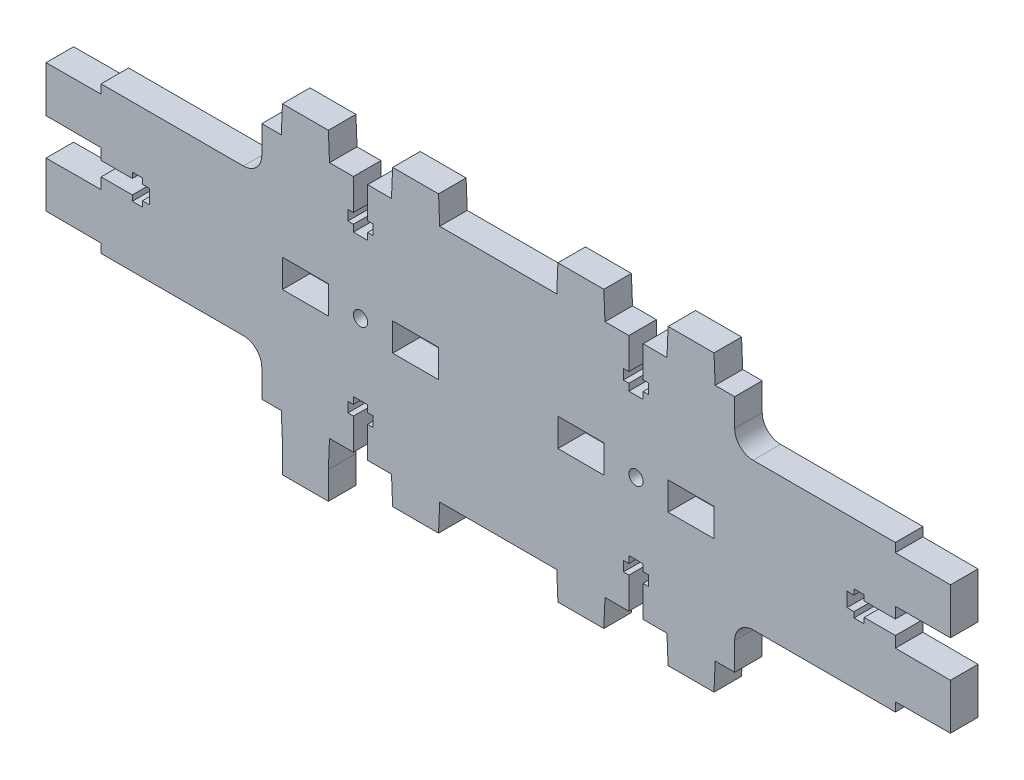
ISO-10303-21;
HEADER;
FILE_DESCRIPTION(('STEP AP214'),'2;1');
FILE_NAME('part.step','',(''),(''),'','','');
FILE_SCHEMA(('AUTOMOTIVE_DESIGN { 1 0 10303 214 1 1 1 1 }'));
ENDSEC;
DATA;
#1=APPLICATION_CONTEXT('core data for automotive mechanical design processes');
#2=APPLICATION_PROTOCOL_DEFINITION('international standard','automotive_design',2000,#1);
#3=PRODUCT_CONTEXT('',#1,'mechanical');
#4=PRODUCT('Part','Part','',(#3));
#5=PRODUCT_RELATED_PRODUCT_CATEGORY('part','',(#4));
#6=PRODUCT_DEFINITION_FORMATION('','',#4);
#7=PRODUCT_DEFINITION_CONTEXT('part definition',#1,'design');
#8=PRODUCT_DEFINITION('design','',#6,#7);
#9=PRODUCT_DEFINITION_SHAPE('','',#8);
#10=(LENGTH_UNIT() NAMED_UNIT(*) SI_UNIT(.MILLI.,.METRE.));
#11=(NAMED_UNIT(*) PLANE_ANGLE_UNIT() SI_UNIT($,.RADIAN.));
#12=(NAMED_UNIT(*) SI_UNIT($,.STERADIAN.) SOLID_ANGLE_UNIT());
#13=UNCERTAINTY_MEASURE_WITH_UNIT(LENGTH_MEASURE(1.E-05),#10,'distance_accuracy_value','');
#14=(GEOMETRIC_REPRESENTATION_CONTEXT(3) GLOBAL_UNCERTAINTY_ASSIGNED_CONTEXT((#13)) GLOBAL_UNIT_ASSIGNED_CONTEXT((#10,
#11,#12)) REPRESENTATION_CONTEXT('',''));
#15=CARTESIAN_POINT('',(0.,0.,0.));
#16=DIRECTION('',(0.,0.,1.));
#17=DIRECTION('',(1.,0.,0.));
#18=AXIS2_PLACEMENT_3D('',#15,#16,#17);
#19=CARTESIAN_POINT('',(0.,0.,6.));
#20=DIRECTION('',(0.,0.,1.));
#21=DIRECTION('',(1.,0.,0.));
#22=AXIS2_PLACEMENT_3D('',#19,#20,#21);
#23=PLANE('',#22);
#24=DIRECTION('',(-1.,0.,0.));
#25=VECTOR('',#24,1.);
#26=CARTESIAN_POINT('',(37.,29.05,6.));
#27=LINE('',#26,#25);
#28=CARTESIAN_POINT('',(47.,29.05,6.));
#29=VERTEX_POINT('',#28);
#30=CARTESIAN_POINT('',(37.,29.05,6.));
#31=VERTEX_POINT('',#30);
#32=EDGE_CURVE('E1650',#29,#31,#27,.T.);
#33=ORIENTED_EDGE('',*,*,#32,.F.);
#34=DIRECTION('',(0.,1.,0.));
#35=VECTOR('',#34,1.);
#36=CARTESIAN_POINT('',(47.,22.95,6.));
#37=LINE('',#36,#35);
#38=CARTESIAN_POINT('',(47.,22.95,6.));
#39=VERTEX_POINT('',#38);
#40=EDGE_CURVE('E1648',#39,#29,#37,.T.);
#41=ORIENTED_EDGE('',*,*,#40,.F.);
#42=DIRECTION('',(1.,0.,0.));
#43=VECTOR('',#42,1.);
#44=CARTESIAN_POINT('',(37.,22.95,6.));
#45=LINE('',#44,#43);
#46=CARTESIAN_POINT('',(37.,22.95,6.));
#47=VERTEX_POINT('',#46);
#48=EDGE_CURVE('E1656',#47,#39,#45,.T.);
#49=ORIENTED_EDGE('',*,*,#48,.F.);
#50=DIRECTION('',(0.,-1.,0.));
#51=VECTOR('',#50,1.);
#52=CARTESIAN_POINT('',(37.,22.95,6.));
#53=LINE('',#52,#51);
#54=EDGE_CURVE('E1653',#31,#47,#53,.T.);
#55=ORIENTED_EDGE('',*,*,#54,.F.);
#56=EDGE_LOOP('',(#33,#41,#49,#55));
#57=FACE_BOUND('',#56,.T.);
#58=DIRECTION('',(-1.,0.,0.));
#59=VECTOR('',#58,1.);
#60=CARTESIAN_POINT('',(12.75,52.,6.));
#61=LINE('',#60,#59);
#62=CARTESIAN_POINT('',(12.75,52.,6.));
#63=VERTEX_POINT('',#62);
#64=CARTESIAN_POINT('',(-12.75,52.,6.));
#65=VERTEX_POINT('',#64);
#66=EDGE_CURVE('E1813',#63,#65,#61,.T.);
#67=ORIENTED_EDGE('',*,*,#66,.T.);
#68=DIRECTION('',(0.0416305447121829,-0.999133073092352,0.));
#69=VECTOR('',#68,1.);
#70=CARTESIAN_POINT('',(-12.75,52.,6.));
#71=LINE('',#70,#69);
#72=CARTESIAN_POINT('',(-13.,58.,6.));
#73=VERTEX_POINT('',#72);
#74=EDGE_CURVE('E1267',#73,#65,#71,.T.);
#75=ORIENTED_EDGE('',*,*,#74,.F.);
#76=DIRECTION('',(1.,0.,0.));
#77=VECTOR('',#76,1.);
#78=CARTESIAN_POINT('',(-13.,58.,6.));
#79=LINE('',#78,#77);
#80=CARTESIAN_POINT('',(-23.,58.,6.));
#81=VERTEX_POINT('',#80);
#82=EDGE_CURVE('E1264',#81,#73,#79,.T.);
#83=ORIENTED_EDGE('',*,*,#82,.F.);
#84=DIRECTION('',(0.0416305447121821,0.999133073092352,0.));
#85=VECTOR('',#84,1.);
#86=CARTESIAN_POINT('',(-23.,58.,6.));
#87=LINE('',#86,#85);
#88=CARTESIAN_POINT('',(-23.25,52.,6.));
#89=VERTEX_POINT('',#88);
#90=EDGE_CURVE('E1261',#89,#81,#87,.T.);
#91=ORIENTED_EDGE('',*,*,#90,.F.);
#92=DIRECTION('',(1.,0.,0.));
#93=VECTOR('',#92,1.);
#94=CARTESIAN_POINT('',(-28.45,52.,6.));
#95=LINE('',#94,#93);
#96=CARTESIAN_POINT('',(-28.45,52.,6.));
#97=VERTEX_POINT('',#96);
#98=EDGE_CURVE('E1258',#97,#89,#95,.T.);
#99=ORIENTED_EDGE('',*,*,#98,.F.);
#100=DIRECTION('',(0.,1.,0.));
#101=VECTOR('',#100,1.);
#102=CARTESIAN_POINT('',(-28.45,52.,6.));
#103=LINE('',#102,#101);
#104=CARTESIAN_POINT('',(-28.45,45.2,6.));
#105=VERTEX_POINT('',#104);
#106=EDGE_CURVE('E1255',#105,#97,#103,.T.);
#107=ORIENTED_EDGE('',*,*,#106,.F.);
#108=DIRECTION('',(-1.,0.,0.));
#109=VECTOR('',#108,1.);
#110=CARTESIAN_POINT('',(-28.45,45.2,6.));
#111=LINE('',#110,#109);
#112=CARTESIAN_POINT('',(-27.25,45.2,6.));
#113=VERTEX_POINT('',#112);
#114=EDGE_CURVE('E1252',#113,#105,#111,.T.);
#115=ORIENTED_EDGE('',*,*,#114,.F.);
#116=DIRECTION('',(0.,1.,0.));
#117=VECTOR('',#116,1.);
#118=CARTESIAN_POINT('',(-27.25,45.2,6.));
#119=LINE('',#118,#117);
#120=CARTESIAN_POINT('',(-27.25,43.,6.));
#121=VERTEX_POINT('',#120);
#122=EDGE_CURVE('E1249',#121,#113,#119,.T.);
#123=ORIENTED_EDGE('',*,*,#122,.F.);
#124=DIRECTION('',(1.,0.,0.));
#125=VECTOR('',#124,1.);
#126=CARTESIAN_POINT('',(-27.25,43.,6.));
#127=LINE('',#126,#125);
#128=CARTESIAN_POINT('',(-28.45,43.,6.));
#129=VERTEX_POINT('',#128);
#130=EDGE_CURVE('E1246',#129,#121,#127,.T.);
#131=ORIENTED_EDGE('',*,*,#130,.F.);
#132=DIRECTION('',(0.,1.,0.));
#133=VECTOR('',#132,1.);
#134=CARTESIAN_POINT('',(-28.45,43.,6.));
#135=LINE('',#134,#133);
#136=CARTESIAN_POINT('',(-28.45,41.5,6.));
#137=VERTEX_POINT('',#136);
#138=EDGE_CURVE('E1243',#137,#129,#135,.T.);
#139=ORIENTED_EDGE('',*,*,#138,.F.);
#140=DIRECTION('',(1.,0.,0.));
#141=VECTOR('',#140,1.);
#142=CARTESIAN_POINT('',(-31.55,41.5,6.));
#143=LINE('',#142,#141);
#144=CARTESIAN_POINT('',(-31.55,41.5,6.));
#145=VERTEX_POINT('',#144);
#146=EDGE_CURVE('E1240',#145,#137,#143,.T.);
#147=ORIENTED_EDGE('',*,*,#146,.F.);
#148=DIRECTION('',(0.,-1.,0.));
#149=VECTOR('',#148,1.);
#150=CARTESIAN_POINT('',(-31.55,43.,6.));
#151=LINE('',#150,#149);
#152=CARTESIAN_POINT('',(-31.55,43.,6.));
#153=VERTEX_POINT('',#152);
#154=EDGE_CURVE('E1237',#153,#145,#151,.T.);
#155=ORIENTED_EDGE('',*,*,#154,.F.);
#156=DIRECTION('',(1.,0.,0.));
#157=VECTOR('',#156,1.);
#158=CARTESIAN_POINT('',(-32.75,43.,6.));
#159=LINE('',#158,#157);
#160=CARTESIAN_POINT('',(-32.75,43.,6.));
#161=VERTEX_POINT('',#160);
#162=EDGE_CURVE('E1234',#161,#153,#159,.T.);
#163=ORIENTED_EDGE('',*,*,#162,.F.);
#164=DIRECTION('',(0.,-1.,0.));
#165=VECTOR('',#164,1.);
#166=CARTESIAN_POINT('',(-32.75,45.2,6.));
#167=LINE('',#166,#165);
#168=CARTESIAN_POINT('',(-32.75,45.2,6.));
#169=VERTEX_POINT('',#168);
#170=EDGE_CURVE('E1231',#169,#161,#167,.T.);
#171=ORIENTED_EDGE('',*,*,#170,.F.);
#172=DIRECTION('',(-1.,0.,0.));
#173=VECTOR('',#172,1.);
#174=CARTESIAN_POINT('',(-31.55,45.2,6.));
#175=LINE('',#174,#173);
#176=CARTESIAN_POINT('',(-31.55,45.2,6.));
#177=VERTEX_POINT('',#176);
#178=EDGE_CURVE('E1228',#177,#169,#175,.T.);
#179=ORIENTED_EDGE('',*,*,#178,.F.);
#180=DIRECTION('',(0.,-1.,0.));
#181=VECTOR('',#180,1.);
#182=CARTESIAN_POINT('',(-31.55,52.,6.));
#183=LINE('',#182,#181);
#184=CARTESIAN_POINT('',(-31.55,52.,6.));
#185=VERTEX_POINT('',#184);
#186=EDGE_CURVE('E1225',#185,#177,#183,.T.);
#187=ORIENTED_EDGE('',*,*,#186,.F.);
#188=DIRECTION('',(1.,0.,0.));
#189=VECTOR('',#188,1.);
#190=CARTESIAN_POINT('',(-36.75,52.,6.));
#191=LINE('',#190,#189);
#192=CARTESIAN_POINT('',(-36.75,52.,6.));
#193=VERTEX_POINT('',#192);
#194=EDGE_CURVE('E1222',#193,#185,#191,.T.);
#195=ORIENTED_EDGE('',*,*,#194,.F.);
#196=DIRECTION('',(0.0416305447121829,-0.999133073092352,0.));
#197=VECTOR('',#196,1.);
#198=CARTESIAN_POINT('',(-37.,58.,6.));
#199=LINE('',#198,#197);
#200=CARTESIAN_POINT('',(-37.,58.,6.));
#201=VERTEX_POINT('',#200);
#202=EDGE_CURVE('E1219',#201,#193,#199,.T.);
#203=ORIENTED_EDGE('',*,*,#202,.F.);
#204=DIRECTION('',(1.,0.,0.));
#205=VECTOR('',#204,1.);
#206=CARTESIAN_POINT('',(-47.,58.,6.));
#207=LINE('',#206,#205);
#208=CARTESIAN_POINT('',(-47.,58.,6.));
#209=VERTEX_POINT('',#208);
#210=EDGE_CURVE('E1216',#209,#201,#207,.T.);
#211=ORIENTED_EDGE('',*,*,#210,.F.);
#212=DIRECTION('',(0.0416305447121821,0.999133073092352,0.));
#213=VECTOR('',#212,1.);
#214=CARTESIAN_POINT('',(-47.25,52.,6.));
#215=LINE('',#214,#213);
#216=CARTESIAN_POINT('',(-47.25,52.,6.));
#217=VERTEX_POINT('',#216);
#218=EDGE_CURVE('E1213',#217,#209,#215,.T.);
#219=ORIENTED_EDGE('',*,*,#218,.F.);
#220=DIRECTION('',(1.,0.,0.));
#221=VECTOR('',#220,1.);
#222=CARTESIAN_POINT('',(-51.5,52.,6.));
#223=LINE('',#222,#221);
#224=CARTESIAN_POINT('',(-51.5,52.,6.));
#225=VERTEX_POINT('',#224);
#226=EDGE_CURVE('E1210',#225,#217,#223,.T.);
#227=ORIENTED_EDGE('',*,*,#226,.F.);
#228=DIRECTION('',(0.,1.,0.));
#229=VECTOR('',#228,1.);
#230=CARTESIAN_POINT('',(-51.5,42.,6.));
#231=LINE('',#230,#229);
#232=CARTESIAN_POINT('',(-51.5,46.,6.));
#233=VERTEX_POINT('',#232);
#234=EDGE_CURVE('E1207',#233,#225,#231,.T.);
#235=ORIENTED_EDGE('',*,*,#234,.F.);
#236=CARTESIAN_POINT('',(-55.5,46.,6.));
#237=DIRECTION('',(0.,0.,-1.));
#238=DIRECTION('',(-1.,0.,0.));
#239=AXIS2_PLACEMENT_3D('',#236,#237,#238);
#240=CIRCLE('',#239,4.);
#241=CARTESIAN_POINT('',(-55.5,42.,6.));
#242=VERTEX_POINT('',#241);
#243=EDGE_CURVE('E1601',#242,#233,#240,.F.);
#244=ORIENTED_EDGE('',*,*,#243,.F.);
#245=DIRECTION('',(1.,0.,0.));
#246=VECTOR('',#245,1.);
#247=CARTESIAN_POINT('',(-86.5,42.,6.));
#248=LINE('',#247,#246);
#249=CARTESIAN_POINT('',(-86.5,42.,6.));
#250=VERTEX_POINT('',#249);
#251=EDGE_CURVE('E1204',#250,#242,#248,.T.);
#252=ORIENTED_EDGE('',*,*,#251,.F.);
#253=DIRECTION('',(0.,1.,0.));
#254=VECTOR('',#253,1.);
#255=CARTESIAN_POINT('',(-86.5,40.05,6.));
#256=LINE('',#255,#254);
#257=CARTESIAN_POINT('',(-86.5,40.05,6.));
#258=VERTEX_POINT('',#257);
#259=EDGE_CURVE('E1201',#258,#250,#256,.T.);
#260=ORIENTED_EDGE('',*,*,#259,.F.);
#261=DIRECTION('',(0.999991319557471,0.00416663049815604,0.));
#262=VECTOR('',#261,1.);
#263=CARTESIAN_POINT('',(-98.5,40.,6.));
#264=LINE('',#263,#262);
#265=CARTESIAN_POINT('',(-98.5,40.,6.));
#266=VERTEX_POINT('',#265);
#267=EDGE_CURVE('E1198',#266,#258,#264,.T.);
#268=ORIENTED_EDGE('',*,*,#267,.F.);
#269=DIRECTION('',(0.,1.,0.));
#270=VECTOR('',#269,1.);
#271=CARTESIAN_POINT('',(-98.5,30.,6.));
#272=LINE('',#271,#270);
#273=CARTESIAN_POINT('',(-98.5,30.,6.));
#274=VERTEX_POINT('',#273);
#275=EDGE_CURVE('E1195',#274,#266,#272,.T.);
#276=ORIENTED_EDGE('',*,*,#275,.F.);
#277=DIRECTION('',(-0.999991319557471,0.00416663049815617,0.));
#278=VECTOR('',#277,1.);
#279=CARTESIAN_POINT('',(-86.5,29.95,6.));
#280=LINE('',#279,#278);
#281=CARTESIAN_POINT('',(-86.5,29.95,6.));
#282=VERTEX_POINT('',#281);
#283=EDGE_CURVE('E1192',#282,#274,#280,.T.);
#284=ORIENTED_EDGE('',*,*,#283,.F.);
#285=DIRECTION('',(0.,1.,0.));
#286=VECTOR('',#285,1.);
#287=CARTESIAN_POINT('',(-86.5,29.95,6.));
#288=LINE('',#287,#286);
#289=CARTESIAN_POINT('',(-86.5,27.55,6.));
#290=VERTEX_POINT('',#289);
#291=EDGE_CURVE('E1189',#290,#282,#288,.T.);
#292=ORIENTED_EDGE('',*,*,#291,.F.);
#293=DIRECTION('',(-1.,0.,0.));
#294=VECTOR('',#293,1.);
#295=CARTESIAN_POINT('',(-86.5,27.55,6.));
#296=LINE('',#295,#294);
#297=CARTESIAN_POINT('',(-79.7,27.55,6.));
#298=VERTEX_POINT('',#297);
#299=EDGE_CURVE('E1186',#298,#290,#296,.T.);
#300=ORIENTED_EDGE('',*,*,#299,.F.);
#301=DIRECTION('',(0.,-1.,0.));
#302=VECTOR('',#301,1.);
#303=CARTESIAN_POINT('',(-79.7,27.55,6.));
#304=LINE('',#303,#302);
#305=CARTESIAN_POINT('',(-79.7,28.75,6.));
#306=VERTEX_POINT('',#305);
#307=EDGE_CURVE('E1183',#306,#298,#304,.T.);
#308=ORIENTED_EDGE('',*,*,#307,.F.);
#309=DIRECTION('',(-1.,0.,0.));
#310=VECTOR('',#309,1.);
#311=CARTESIAN_POINT('',(-79.7,28.75,6.));
#312=LINE('',#311,#310);
#313=CARTESIAN_POINT('',(-77.5,28.75,6.));
#314=VERTEX_POINT('',#313);
#315=EDGE_CURVE('E1180',#314,#306,#312,.T.);
#316=ORIENTED_EDGE('',*,*,#315,.F.);
#317=DIRECTION('',(0.,1.,0.));
#318=VECTOR('',#317,1.);
#319=CARTESIAN_POINT('',(-77.5,28.75,6.));
#320=LINE('',#319,#318);
#321=CARTESIAN_POINT('',(-77.5,27.55,6.));
#322=VERTEX_POINT('',#321);
#323=EDGE_CURVE('E1177',#322,#314,#320,.T.);
#324=ORIENTED_EDGE('',*,*,#323,.F.);
#325=DIRECTION('',(-1.,0.,0.));
#326=VECTOR('',#325,1.);
#327=CARTESIAN_POINT('',(-77.5,27.55,6.));
#328=LINE('',#327,#326);
#329=CARTESIAN_POINT('',(-76.,27.55,6.));
#330=VERTEX_POINT('',#329);
#331=EDGE_CURVE('E1174',#330,#322,#328,.T.);
#332=ORIENTED_EDGE('',*,*,#331,.F.);
#333=DIRECTION('',(0.,1.,0.));
#334=VECTOR('',#333,1.);
#335=CARTESIAN_POINT('',(-76.,27.55,6.));
#336=LINE('',#335,#334);
#337=CARTESIAN_POINT('',(-76.,24.45,6.));
#338=VERTEX_POINT('',#337);
#339=EDGE_CURVE('E1171',#338,#330,#336,.T.);
#340=ORIENTED_EDGE('',*,*,#339,.F.);
#341=DIRECTION('',(1.,0.,0.));
#342=VECTOR('',#341,1.);
#343=CARTESIAN_POINT('',(-77.5,24.45,6.));
#344=LINE('',#343,#342);
#345=CARTESIAN_POINT('',(-77.5,24.45,6.));
#346=VERTEX_POINT('',#345);
#347=EDGE_CURVE('E1168',#346,#338,#344,.T.);
#348=ORIENTED_EDGE('',*,*,#347,.F.);
#349=DIRECTION('',(0.,1.,0.));
#350=VECTOR('',#349,1.);
#351=CARTESIAN_POINT('',(-77.5,23.25,6.));
#352=LINE('',#351,#350);
#353=CARTESIAN_POINT('',(-77.5,23.25,6.));
#354=VERTEX_POINT('',#353);
#355=EDGE_CURVE('E1165',#354,#346,#352,.T.);
#356=ORIENTED_EDGE('',*,*,#355,.F.);
#357=DIRECTION('',(1.,0.,0.));
#358=VECTOR('',#357,1.);
#359=CARTESIAN_POINT('',(-79.7,23.25,6.));
#360=LINE('',#359,#358);
#361=CARTESIAN_POINT('',(-79.7,23.25,6.));
#362=VERTEX_POINT('',#361);
#363=EDGE_CURVE('E1162',#362,#354,#360,.T.);
#364=ORIENTED_EDGE('',*,*,#363,.F.);
#365=DIRECTION('',(0.,-1.,0.));
#366=VECTOR('',#365,1.);
#367=CARTESIAN_POINT('',(-79.7,24.45,6.));
#368=LINE('',#367,#366);
#369=CARTESIAN_POINT('',(-79.7,24.45,6.));
#370=VERTEX_POINT('',#369);
#371=EDGE_CURVE('E1159',#370,#362,#368,.T.);
#372=ORIENTED_EDGE('',*,*,#371,.F.);
#373=DIRECTION('',(1.,0.,0.));
#374=VECTOR('',#373,1.);
#375=CARTESIAN_POINT('',(-86.5,24.45,6.));
#376=LINE('',#375,#374);
#377=CARTESIAN_POINT('',(-86.5,24.45,6.));
#378=VERTEX_POINT('',#377);
#379=EDGE_CURVE('E1156',#378,#370,#376,.T.);
#380=ORIENTED_EDGE('',*,*,#379,.F.);
#381=DIRECTION('',(0.,1.,0.));
#382=VECTOR('',#381,1.);
#383=CARTESIAN_POINT('',(-86.5,22.05,6.));
#384=LINE('',#383,#382);
#385=CARTESIAN_POINT('',(-86.5,22.05,6.));
#386=VERTEX_POINT('',#385);
#387=EDGE_CURVE('E1153',#386,#378,#384,.T.);
#388=ORIENTED_EDGE('',*,*,#387,.F.);
#389=DIRECTION('',(0.999991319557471,0.00416663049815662,0.));
#390=VECTOR('',#389,1.);
#391=CARTESIAN_POINT('',(-86.5,22.05,6.));
#392=LINE('',#391,#390);
#393=CARTESIAN_POINT('',(-98.5,22.,6.));
#394=VERTEX_POINT('',#393);
#395=EDGE_CURVE('E1150',#394,#386,#392,.T.);
#396=ORIENTED_EDGE('',*,*,#395,.F.);
#397=DIRECTION('',(0.,1.,0.));
#398=VECTOR('',#397,1.);
#399=CARTESIAN_POINT('',(-98.5,22.,6.));
#400=LINE('',#399,#398);
#401=CARTESIAN_POINT('',(-98.5,12.,6.));
#402=VERTEX_POINT('',#401);
#403=EDGE_CURVE('E1147',#402,#394,#400,.T.);
#404=ORIENTED_EDGE('',*,*,#403,.F.);
#405=DIRECTION('',(-0.999991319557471,0.00416663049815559,0.));
#406=VECTOR('',#405,1.);
#407=CARTESIAN_POINT('',(-98.5,12.,6.));
#408=LINE('',#407,#406);
#409=CARTESIAN_POINT('',(-86.5,11.95,6.));
#410=VERTEX_POINT('',#409);
#411=EDGE_CURVE('E1144',#410,#402,#408,.T.);
#412=ORIENTED_EDGE('',*,*,#411,.F.);
#413=DIRECTION('',(0.,1.,0.));
#414=VECTOR('',#413,1.);
#415=CARTESIAN_POINT('',(-86.5,9.99999999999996,6.));
#416=LINE('',#415,#414);
#417=CARTESIAN_POINT('',(-86.5,9.99999999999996,6.));
#418=VERTEX_POINT('',#417);
#419=EDGE_CURVE('E1141',#418,#410,#416,.T.);
#420=ORIENTED_EDGE('',*,*,#419,.F.);
#421=DIRECTION('',(-1.,0.,0.));
#422=VECTOR('',#421,1.);
#423=CARTESIAN_POINT('',(-86.5,9.99999999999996,6.));
#424=LINE('',#423,#422);
#425=CARTESIAN_POINT('',(-55.5,9.99999999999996,6.));
#426=VERTEX_POINT('',#425);
#427=EDGE_CURVE('E1138',#426,#418,#424,.T.);
#428=ORIENTED_EDGE('',*,*,#427,.F.);
#429=CARTESIAN_POINT('',(-55.5,5.99999999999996,6.));
#430=DIRECTION('',(0.,0.,-1.));
#431=DIRECTION('',(-1.,0.,0.));
#432=AXIS2_PLACEMENT_3D('',#429,#430,#431);
#433=CIRCLE('',#432,4.);
#434=CARTESIAN_POINT('',(-51.5,5.99999999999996,6.));
#435=VERTEX_POINT('',#434);
#436=EDGE_CURVE('E1607',#435,#426,#433,.F.);
#437=ORIENTED_EDGE('',*,*,#436,.F.);
#438=DIRECTION('',(0.,1.,0.));
#439=VECTOR('',#438,1.);
#440=CARTESIAN_POINT('',(-51.5,9.99999999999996,6.));
#441=LINE('',#440,#439);
#442=CARTESIAN_POINT('',(-51.5,0.,6.));
#443=VERTEX_POINT('',#442);
#444=EDGE_CURVE('E1135',#443,#435,#441,.T.);
#445=ORIENTED_EDGE('',*,*,#444,.F.);
#446=DIRECTION('',(-1.,0.,0.));
#447=VECTOR('',#446,1.);
#448=CARTESIAN_POINT('',(-47.25,0.,6.));
#449=LINE('',#448,#447);
#450=CARTESIAN_POINT('',(-47.25,0.,6.));
#451=VERTEX_POINT('',#450);
#452=EDGE_CURVE('E1132',#451,#443,#449,.T.);
#453=ORIENTED_EDGE('',*,*,#452,.F.);
#454=DIRECTION('',(-0.0416305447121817,0.999133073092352,0.));
#455=VECTOR('',#454,1.);
#456=CARTESIAN_POINT('',(-47.25,0.,6.));
#457=LINE('',#456,#455);
#458=CARTESIAN_POINT('',(-47.,-6.00000000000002,6.));
#459=VERTEX_POINT('',#458);
#460=EDGE_CURVE('E999',#459,#451,#457,.T.);
#461=ORIENTED_EDGE('',*,*,#460,.F.);
#462=DIRECTION('',(0.,-1.,0.));
#463=VECTOR('',#462,1.);
#464=CARTESIAN_POINT('',(-47.,-6.,6.));
#465=LINE('',#464,#463);
#466=CARTESIAN_POINT('',(-47.,-12.,6.));
#467=VERTEX_POINT('',#466);
#468=EDGE_CURVE('E979',#459,#467,#465,.T.);
#469=ORIENTED_EDGE('',*,*,#468,.T.);
#470=DIRECTION('',(1.,0.,0.));
#471=VECTOR('',#470,1.);
#472=CARTESIAN_POINT('',(-47.,-12.,6.));
#473=LINE('',#472,#471);
#474=CARTESIAN_POINT('',(-37.,-12.,6.));
#475=VERTEX_POINT('',#474);
#476=EDGE_CURVE('E988',#467,#475,#473,.T.);
#477=ORIENTED_EDGE('',*,*,#476,.T.);
#478=DIRECTION('',(0.,1.,0.));
#479=VECTOR('',#478,1.);
#480=CARTESIAN_POINT('',(-37.,-6.,6.));
#481=LINE('',#480,#479);
#482=CARTESIAN_POINT('',(-37.,-6.00000000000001,6.));
#483=VERTEX_POINT('',#482);
#484=EDGE_CURVE('E985',#475,#483,#481,.T.);
#485=ORIENTED_EDGE('',*,*,#484,.T.);
#486=DIRECTION('',(-0.041630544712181,-0.999133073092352,0.));
#487=VECTOR('',#486,1.);
#488=CARTESIAN_POINT('',(-37.,-6.00000000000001,6.));
#489=LINE('',#488,#487);
#490=CARTESIAN_POINT('',(-36.75,0.,6.));
#491=VERTEX_POINT('',#490);
#492=EDGE_CURVE('E1129',#491,#483,#489,.T.);
#493=ORIENTED_EDGE('',*,*,#492,.F.);
#494=DIRECTION('',(-1.,0.,0.));
#495=VECTOR('',#494,1.);
#496=CARTESIAN_POINT('',(-31.55,0.,6.));
#497=LINE('',#496,#495);
#498=CARTESIAN_POINT('',(-31.55,0.,6.));
#499=VERTEX_POINT('',#498);
#500=EDGE_CURVE('E1126',#499,#491,#497,.T.);
#501=ORIENTED_EDGE('',*,*,#500,.F.);
#502=DIRECTION('',(0.,-1.,0.));
#503=VECTOR('',#502,1.);
#504=CARTESIAN_POINT('',(-31.55,0.,6.));
#505=LINE('',#504,#503);
#506=CARTESIAN_POINT('',(-31.55,6.79999999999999,6.));
#507=VERTEX_POINT('',#506);
#508=EDGE_CURVE('E1123',#507,#499,#505,.T.);
#509=ORIENTED_EDGE('',*,*,#508,.F.);
#510=DIRECTION('',(1.,0.,0.));
#511=VECTOR('',#510,1.);
#512=CARTESIAN_POINT('',(-31.55,6.79999999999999,6.));
#513=LINE('',#512,#511);
#514=CARTESIAN_POINT('',(-32.75,6.79999999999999,6.));
#515=VERTEX_POINT('',#514);
#516=EDGE_CURVE('E1120',#515,#507,#513,.T.);
#517=ORIENTED_EDGE('',*,*,#516,.F.);
#518=DIRECTION('',(0.,-1.,0.));
#519=VECTOR('',#518,1.);
#520=CARTESIAN_POINT('',(-32.75,6.79999999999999,6.));
#521=LINE('',#520,#519);
#522=CARTESIAN_POINT('',(-32.75,8.99999999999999,6.));
#523=VERTEX_POINT('',#522);
#524=EDGE_CURVE('E1117',#523,#515,#521,.T.);
#525=ORIENTED_EDGE('',*,*,#524,.F.);
#526=DIRECTION('',(-1.,0.,0.));
#527=VECTOR('',#526,1.);
#528=CARTESIAN_POINT('',(-32.75,8.99999999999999,6.));
#529=LINE('',#528,#527);
#530=CARTESIAN_POINT('',(-31.55,8.99999999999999,6.));
#531=VERTEX_POINT('',#530);
#532=EDGE_CURVE('E1114',#531,#523,#529,.T.);
#533=ORIENTED_EDGE('',*,*,#532,.F.);
#534=DIRECTION('',(0.,-1.,0.));
#535=VECTOR('',#534,1.);
#536=CARTESIAN_POINT('',(-31.55,8.99999999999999,6.));
#537=LINE('',#536,#535);
#538=CARTESIAN_POINT('',(-31.55,10.5,6.));
#539=VERTEX_POINT('',#538);
#540=EDGE_CURVE('E1111',#539,#531,#537,.T.);
#541=ORIENTED_EDGE('',*,*,#540,.F.);
#542=DIRECTION('',(-1.,0.,0.));
#543=VECTOR('',#542,1.);
#544=CARTESIAN_POINT('',(-31.55,10.5,6.));
#545=LINE('',#544,#543);
#546=CARTESIAN_POINT('',(-28.45,10.5,6.));
#547=VERTEX_POINT('',#546);
#548=EDGE_CURVE('E1108',#547,#539,#545,.T.);
#549=ORIENTED_EDGE('',*,*,#548,.F.);
#550=DIRECTION('',(0.,1.,0.));
#551=VECTOR('',#550,1.);
#552=CARTESIAN_POINT('',(-28.45,8.99999999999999,6.));
#553=LINE('',#552,#551);
#554=CARTESIAN_POINT('',(-28.45,8.99999999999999,6.));
#555=VERTEX_POINT('',#554);
#556=EDGE_CURVE('E1105',#555,#547,#553,.T.);
#557=ORIENTED_EDGE('',*,*,#556,.F.);
#558=DIRECTION('',(-1.,0.,0.));
#559=VECTOR('',#558,1.);
#560=CARTESIAN_POINT('',(-27.25,8.99999999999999,6.));
#561=LINE('',#560,#559);
#562=CARTESIAN_POINT('',(-27.25,8.99999999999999,6.));
#563=VERTEX_POINT('',#562);
#564=EDGE_CURVE('E1102',#563,#555,#561,.T.);
#565=ORIENTED_EDGE('',*,*,#564,.F.);
#566=DIRECTION('',(0.,1.,0.));
#567=VECTOR('',#566,1.);
#568=CARTESIAN_POINT('',(-27.25,6.79999999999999,6.));
#569=LINE('',#568,#567);
#570=CARTESIAN_POINT('',(-27.25,6.79999999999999,6.));
#571=VERTEX_POINT('',#570);
#572=EDGE_CURVE('E1099',#571,#563,#569,.T.);
#573=ORIENTED_EDGE('',*,*,#572,.F.);
#574=DIRECTION('',(1.,0.,0.));
#575=VECTOR('',#574,1.);
#576=CARTESIAN_POINT('',(-28.45,6.79999999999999,6.));
#577=LINE('',#576,#575);
#578=CARTESIAN_POINT('',(-28.45,6.79999999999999,6.));
#579=VERTEX_POINT('',#578);
#580=EDGE_CURVE('E1096',#579,#571,#577,.T.);
#581=ORIENTED_EDGE('',*,*,#580,.F.);
#582=DIRECTION('',(0.,1.,0.));
#583=VECTOR('',#582,1.);
#584=CARTESIAN_POINT('',(-28.45,0.,6.));
#585=LINE('',#584,#583);
#586=CARTESIAN_POINT('',(-28.45,0.,6.));
#587=VERTEX_POINT('',#586);
#588=EDGE_CURVE('E1093',#587,#579,#585,.T.);
#589=ORIENTED_EDGE('',*,*,#588,.F.);
#590=DIRECTION('',(-1.,0.,0.));
#591=VECTOR('',#590,1.);
#592=CARTESIAN_POINT('',(-23.25,0.,6.));
#593=LINE('',#592,#591);
#594=CARTESIAN_POINT('',(-23.25,0.,6.));
#595=VERTEX_POINT('',#594);
#596=EDGE_CURVE('E1090',#595,#587,#593,.T.);
#597=ORIENTED_EDGE('',*,*,#596,.F.);
#598=DIRECTION('',(-0.0416305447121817,0.999133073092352,0.));
#599=VECTOR('',#598,1.);
#600=CARTESIAN_POINT('',(-23.,-6.00000000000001,6.));
#601=LINE('',#600,#599);
#602=CARTESIAN_POINT('',(-23.,-6.00000000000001,6.));
#603=VERTEX_POINT('',#602);
#604=EDGE_CURVE('E1087',#603,#595,#601,.T.);
#605=ORIENTED_EDGE('',*,*,#604,.F.);
#606=DIRECTION('',(-1.,0.,0.));
#607=VECTOR('',#606,1.);
#608=CARTESIAN_POINT('',(-13.,-6.00000000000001,6.));
#609=LINE('',#608,#607);
#610=CARTESIAN_POINT('',(-13.,-6.00000000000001,6.));
#611=VERTEX_POINT('',#610);
#612=EDGE_CURVE('E1083',#611,#603,#609,.T.);
#613=ORIENTED_EDGE('',*,*,#612,.F.);
#614=DIRECTION('',(-0.041630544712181,-0.999133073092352,0.));
#615=VECTOR('',#614,1.);
#616=CARTESIAN_POINT('',(-12.75,0.,6.));
#617=LINE('',#616,#615);
#618=CARTESIAN_POINT('',(-12.75,0.,6.));
#619=VERTEX_POINT('',#618);
#620=EDGE_CURVE('E1080',#619,#611,#617,.T.);
#621=ORIENTED_EDGE('',*,*,#620,.F.);
#622=DIRECTION('',(1.,0.,0.));
#623=VECTOR('',#622,1.);
#624=CARTESIAN_POINT('',(0.,0.,6.));
#625=LINE('',#624,#623);
#626=CARTESIAN_POINT('',(12.75,0.,6.));
#627=VERTEX_POINT('',#626);
#628=EDGE_CURVE('E1679',#619,#627,#625,.T.);
#629=ORIENTED_EDGE('',*,*,#628,.T.);
#630=DIRECTION('',(0.0416305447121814,-0.999133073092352,0.));
#631=VECTOR('',#630,1.);
#632=CARTESIAN_POINT('',(12.75,0.,6.));
#633=LINE('',#632,#631);
#634=CARTESIAN_POINT('',(13.,-6.,6.));
#635=VERTEX_POINT('',#634);
#636=EDGE_CURVE('E1681',#627,#635,#633,.T.);
#637=ORIENTED_EDGE('',*,*,#636,.T.);
#638=DIRECTION('',(1.,0.,0.));
#639=VECTOR('',#638,1.);
#640=CARTESIAN_POINT('',(13.,-6.,6.));
#641=LINE('',#640,#639);
#642=CARTESIAN_POINT('',(23.,-6.,6.));
#643=VERTEX_POINT('',#642);
#644=EDGE_CURVE('E1684',#635,#643,#641,.T.);
#645=ORIENTED_EDGE('',*,*,#644,.T.);
#646=DIRECTION('',(0.0416305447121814,0.999133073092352,0.));
#647=VECTOR('',#646,1.);
#648=CARTESIAN_POINT('',(23.,-6.,6.));
#649=LINE('',#648,#647);
#650=CARTESIAN_POINT('',(23.25,0.,6.));
#651=VERTEX_POINT('',#650);
#652=EDGE_CURVE('E1686',#643,#651,#649,.T.);
#653=ORIENTED_EDGE('',*,*,#652,.T.);
#654=DIRECTION('',(1.,0.,0.));
#655=VECTOR('',#654,1.);
#656=CARTESIAN_POINT('',(23.25,0.,6.));
#657=LINE('',#656,#655);
#658=CARTESIAN_POINT('',(28.45,0.,6.));
#659=VERTEX_POINT('',#658);
#660=EDGE_CURVE('E1688',#651,#659,#657,.T.);
#661=ORIENTED_EDGE('',*,*,#660,.T.);
#662=DIRECTION('',(0.,1.,0.));
#663=VECTOR('',#662,1.);
#664=CARTESIAN_POINT('',(28.45,0.,6.));
#665=LINE('',#664,#663);
#666=CARTESIAN_POINT('',(28.45,6.8,6.));
#667=VERTEX_POINT('',#666);
#668=EDGE_CURVE('E1690',#659,#667,#665,.T.);
#669=ORIENTED_EDGE('',*,*,#668,.T.);
#670=DIRECTION('',(-1.,0.,0.));
#671=VECTOR('',#670,1.);
#672=CARTESIAN_POINT('',(28.45,6.8,6.));
#673=LINE('',#672,#671);
#674=CARTESIAN_POINT('',(27.25,6.8,6.));
#675=VERTEX_POINT('',#674);
#676=EDGE_CURVE('E1692',#667,#675,#673,.T.);
#677=ORIENTED_EDGE('',*,*,#676,.T.);
#678=DIRECTION('',(0.,1.,0.));
#679=VECTOR('',#678,1.);
#680=CARTESIAN_POINT('',(27.25,6.8,6.));
#681=LINE('',#680,#679);
#682=CARTESIAN_POINT('',(27.25,9.,6.));
#683=VERTEX_POINT('',#682);
#684=EDGE_CURVE('E1694',#675,#683,#681,.T.);
#685=ORIENTED_EDGE('',*,*,#684,.T.);
#686=DIRECTION('',(1.,0.,0.));
#687=VECTOR('',#686,1.);
#688=CARTESIAN_POINT('',(27.25,9.,6.));
#689=LINE('',#688,#687);
#690=CARTESIAN_POINT('',(28.45,9.,6.));
#691=VERTEX_POINT('',#690);
#692=EDGE_CURVE('E1696',#683,#691,#689,.T.);
#693=ORIENTED_EDGE('',*,*,#692,.T.);
#694=DIRECTION('',(0.,1.,0.));
#695=VECTOR('',#694,1.);
#696=CARTESIAN_POINT('',(28.45,9.,6.));
#697=LINE('',#696,#695);
#698=CARTESIAN_POINT('',(28.45,10.5,6.));
#699=VERTEX_POINT('',#698);
#700=EDGE_CURVE('E1698',#691,#699,#697,.T.);
#701=ORIENTED_EDGE('',*,*,#700,.T.);
#702=DIRECTION('',(1.,0.,0.));
#703=VECTOR('',#702,1.);
#704=CARTESIAN_POINT('',(31.55,10.5,6.));
#705=LINE('',#704,#703);
#706=CARTESIAN_POINT('',(31.55,10.5,6.));
#707=VERTEX_POINT('',#706);
#708=EDGE_CURVE('E1700',#699,#707,#705,.T.);
#709=ORIENTED_EDGE('',*,*,#708,.T.);
#710=DIRECTION('',(0.,-1.,0.));
#711=VECTOR('',#710,1.);
#712=CARTESIAN_POINT('',(31.55,9.,6.));
#713=LINE('',#712,#711);
#714=CARTESIAN_POINT('',(31.55,9.,6.));
#715=VERTEX_POINT('',#714);
#716=EDGE_CURVE('E1702',#707,#715,#713,.T.);
#717=ORIENTED_EDGE('',*,*,#716,.T.);
#718=DIRECTION('',(1.,0.,0.));
#719=VECTOR('',#718,1.);
#720=CARTESIAN_POINT('',(32.75,9.,6.));
#721=LINE('',#720,#719);
#722=CARTESIAN_POINT('',(32.75,9.,6.));
#723=VERTEX_POINT('',#722);
#724=EDGE_CURVE('E1704',#715,#723,#721,.T.);
#725=ORIENTED_EDGE('',*,*,#724,.T.);
#726=DIRECTION('',(0.,-1.,0.));
#727=VECTOR('',#726,1.);
#728=CARTESIAN_POINT('',(32.75,6.8,6.));
#729=LINE('',#728,#727);
#730=CARTESIAN_POINT('',(32.75,6.8,6.));
#731=VERTEX_POINT('',#730);
#732=EDGE_CURVE('E1706',#723,#731,#729,.T.);
#733=ORIENTED_EDGE('',*,*,#732,.T.);
#734=DIRECTION('',(-1.,0.,0.));
#735=VECTOR('',#734,1.);
#736=CARTESIAN_POINT('',(31.55,6.8,6.));
#737=LINE('',#736,#735);
#738=CARTESIAN_POINT('',(31.55,6.8,6.));
#739=VERTEX_POINT('',#738);
#740=EDGE_CURVE('E1708',#731,#739,#737,.T.);
#741=ORIENTED_EDGE('',*,*,#740,.T.);
#742=DIRECTION('',(0.,-1.,0.));
#743=VECTOR('',#742,1.);
#744=CARTESIAN_POINT('',(31.55,0.,6.));
#745=LINE('',#744,#743);
#746=CARTESIAN_POINT('',(31.55,0.,6.));
#747=VERTEX_POINT('',#746);
#748=EDGE_CURVE('E1710',#739,#747,#745,.T.);
#749=ORIENTED_EDGE('',*,*,#748,.T.);
#750=DIRECTION('',(1.,0.,0.));
#751=VECTOR('',#750,1.);
#752=CARTESIAN_POINT('',(31.55,0.,6.));
#753=LINE('',#752,#751);
#754=CARTESIAN_POINT('',(36.75,0.,6.));
#755=VERTEX_POINT('',#754);
#756=EDGE_CURVE('E1712',#747,#755,#753,.T.);
#757=ORIENTED_EDGE('',*,*,#756,.T.);
#758=DIRECTION('',(0.0416305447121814,-0.999133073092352,0.));
#759=VECTOR('',#758,1.);
#760=CARTESIAN_POINT('',(37.,-6.,6.));
#761=LINE('',#760,#759);
#762=CARTESIAN_POINT('',(37.,-6.,6.));
#763=VERTEX_POINT('',#762);
#764=EDGE_CURVE('E1714',#755,#763,#761,.T.);
#765=ORIENTED_EDGE('',*,*,#764,.T.);
#766=DIRECTION('',(1.,0.,0.));
#767=VECTOR('',#766,1.);
#768=CARTESIAN_POINT('',(47.,-6.,6.));
#769=LINE('',#768,#767);
#770=CARTESIAN_POINT('',(47.,-6.,6.));
#771=VERTEX_POINT('',#770);
#772=EDGE_CURVE('E1716',#763,#771,#769,.T.);
#773=ORIENTED_EDGE('',*,*,#772,.T.);
#774=DIRECTION('',(0.0416305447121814,0.999133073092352,0.));
#775=VECTOR('',#774,1.);
#776=CARTESIAN_POINT('',(47.25,0.,6.));
#777=LINE('',#776,#775);
#778=CARTESIAN_POINT('',(47.25,0.,6.));
#779=VERTEX_POINT('',#778);
#780=EDGE_CURVE('E1718',#771,#779,#777,.T.);
#781=ORIENTED_EDGE('',*,*,#780,.T.);
#782=DIRECTION('',(1.,0.,0.));
#783=VECTOR('',#782,1.);
#784=CARTESIAN_POINT('',(47.25,0.,6.));
#785=LINE('',#784,#783);
#786=CARTESIAN_POINT('',(51.5,0.,6.));
#787=VERTEX_POINT('',#786);
#788=EDGE_CURVE('E1720',#779,#787,#785,.T.);
#789=ORIENTED_EDGE('',*,*,#788,.T.);
#790=DIRECTION('',(0.,1.,0.));
#791=VECTOR('',#790,1.);
#792=CARTESIAN_POINT('',(51.5,9.99999999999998,6.));
#793=LINE('',#792,#791);
#794=CARTESIAN_POINT('',(51.5,5.99999999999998,6.));
#795=VERTEX_POINT('',#794);
#796=EDGE_CURVE('E1722',#787,#795,#793,.T.);
#797=ORIENTED_EDGE('',*,*,#796,.T.);
#798=CARTESIAN_POINT('',(55.5,5.99999999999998,6.));
#799=DIRECTION('',(0.,0.,1.));
#800=DIRECTION('',(1.,0.,0.));
#801=AXIS2_PLACEMENT_3D('',#798,#799,#800);
#802=CIRCLE('',#801,4.);
#803=CARTESIAN_POINT('',(55.5,9.99999999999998,6.));
#804=VERTEX_POINT('',#803);
#805=EDGE_CURVE('E11',#795,#804,#802,.F.);
#806=ORIENTED_EDGE('',*,*,#805,.T.);
#807=DIRECTION('',(1.,0.,0.));
#808=VECTOR('',#807,1.);
#809=CARTESIAN_POINT('',(86.5,9.99999999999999,6.));
#810=LINE('',#809,#808);
#811=CARTESIAN_POINT('',(86.5,9.99999999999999,6.));
#812=VERTEX_POINT('',#811);
#813=EDGE_CURVE('E1724',#804,#812,#810,.T.);
#814=ORIENTED_EDGE('',*,*,#813,.T.);
#815=DIRECTION('',(0.,1.,0.));
#816=VECTOR('',#815,1.);
#817=CARTESIAN_POINT('',(86.5,9.99999999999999,6.));
#818=LINE('',#817,#816);
#819=CARTESIAN_POINT('',(86.5,11.95,6.));
#820=VERTEX_POINT('',#819);
#821=EDGE_CURVE('E1726',#812,#820,#818,.T.);
#822=ORIENTED_EDGE('',*,*,#821,.T.);
#823=DIRECTION('',(0.999991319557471,0.00416663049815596,0.));
#824=VECTOR('',#823,1.);
#825=CARTESIAN_POINT('',(98.5,12.,6.));
#826=LINE('',#825,#824);
#827=CARTESIAN_POINT('',(98.5,12.,6.));
#828=VERTEX_POINT('',#827);
#829=EDGE_CURVE('E1728',#820,#828,#826,.T.);
#830=ORIENTED_EDGE('',*,*,#829,.T.);
#831=DIRECTION('',(0.,1.,0.));
#832=VECTOR('',#831,1.);
#833=CARTESIAN_POINT('',(98.5,22.,6.));
#834=LINE('',#833,#832);
#835=CARTESIAN_POINT('',(98.5,22.,6.));
#836=VERTEX_POINT('',#835);
#837=EDGE_CURVE('E1730',#828,#836,#834,.T.);
#838=ORIENTED_EDGE('',*,*,#837,.T.);
#839=DIRECTION('',(-0.999991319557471,0.00416663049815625,0.));
#840=VECTOR('',#839,1.);
#841=CARTESIAN_POINT('',(86.5,22.05,6.));
#842=LINE('',#841,#840);
#843=CARTESIAN_POINT('',(86.5,22.05,6.));
#844=VERTEX_POINT('',#843);
#845=EDGE_CURVE('E1732',#836,#844,#842,.T.);
#846=ORIENTED_EDGE('',*,*,#845,.T.);
#847=DIRECTION('',(0.,1.,0.));
#848=VECTOR('',#847,1.);
#849=CARTESIAN_POINT('',(86.5,22.05,6.));
#850=LINE('',#849,#848);
#851=CARTESIAN_POINT('',(86.5,24.45,6.));
#852=VERTEX_POINT('',#851);
#853=EDGE_CURVE('E1734',#844,#852,#850,.T.);
#854=ORIENTED_EDGE('',*,*,#853,.T.);
#855=DIRECTION('',(-1.,0.,0.));
#856=VECTOR('',#855,1.);
#857=CARTESIAN_POINT('',(86.5,24.45,6.));
#858=LINE('',#857,#856);
#859=CARTESIAN_POINT('',(79.7,24.45,6.));
#860=VERTEX_POINT('',#859);
#861=EDGE_CURVE('E1736',#852,#860,#858,.T.);
#862=ORIENTED_EDGE('',*,*,#861,.T.);
#863=DIRECTION('',(0.,-1.,0.));
#864=VECTOR('',#863,1.);
#865=CARTESIAN_POINT('',(79.7,24.45,6.));
#866=LINE('',#865,#864);
#867=CARTESIAN_POINT('',(79.7,23.25,6.));
#868=VERTEX_POINT('',#867);
#869=EDGE_CURVE('E1738',#860,#868,#866,.T.);
#870=ORIENTED_EDGE('',*,*,#869,.T.);
#871=DIRECTION('',(-1.,0.,0.));
#872=VECTOR('',#871,1.);
#873=CARTESIAN_POINT('',(79.7,23.25,6.));
#874=LINE('',#873,#872);
#875=CARTESIAN_POINT('',(77.5,23.25,6.));
#876=VERTEX_POINT('',#875);
#877=EDGE_CURVE('E1740',#868,#876,#874,.T.);
#878=ORIENTED_EDGE('',*,*,#877,.T.);
#879=DIRECTION('',(0.,1.,0.));
#880=VECTOR('',#879,1.);
#881=CARTESIAN_POINT('',(77.5,23.25,6.));
#882=LINE('',#881,#880);
#883=CARTESIAN_POINT('',(77.5,24.45,6.));
#884=VERTEX_POINT('',#883);
#885=EDGE_CURVE('E1742',#876,#884,#882,.T.);
#886=ORIENTED_EDGE('',*,*,#885,.T.);
#887=DIRECTION('',(-1.,0.,0.));
#888=VECTOR('',#887,1.);
#889=CARTESIAN_POINT('',(77.5,24.45,6.));
#890=LINE('',#889,#888);
#891=CARTESIAN_POINT('',(76.,24.45,6.));
#892=VERTEX_POINT('',#891);
#893=EDGE_CURVE('E1744',#884,#892,#890,.T.);
#894=ORIENTED_EDGE('',*,*,#893,.T.);
#895=DIRECTION('',(0.,1.,0.));
#896=VECTOR('',#895,1.);
#897=CARTESIAN_POINT('',(76.,27.55,6.));
#898=LINE('',#897,#896);
#899=CARTESIAN_POINT('',(76.,27.55,6.));
#900=VERTEX_POINT('',#899);
#901=EDGE_CURVE('E1746',#892,#900,#898,.T.);
#902=ORIENTED_EDGE('',*,*,#901,.T.);
#903=DIRECTION('',(1.,0.,0.));
#904=VECTOR('',#903,1.);
#905=CARTESIAN_POINT('',(77.5,27.55,6.));
#906=LINE('',#905,#904);
#907=CARTESIAN_POINT('',(77.5,27.55,6.));
#908=VERTEX_POINT('',#907);
#909=EDGE_CURVE('E1748',#900,#908,#906,.T.);
#910=ORIENTED_EDGE('',*,*,#909,.T.);
#911=DIRECTION('',(0.,1.,0.));
#912=VECTOR('',#911,1.);
#913=CARTESIAN_POINT('',(77.5,28.75,6.));
#914=LINE('',#913,#912);
#915=CARTESIAN_POINT('',(77.5,28.75,6.));
#916=VERTEX_POINT('',#915);
#917=EDGE_CURVE('E1750',#908,#916,#914,.T.);
#918=ORIENTED_EDGE('',*,*,#917,.T.);
#919=DIRECTION('',(1.,0.,0.));
#920=VECTOR('',#919,1.);
#921=CARTESIAN_POINT('',(79.7,28.75,6.));
#922=LINE('',#921,#920);
#923=CARTESIAN_POINT('',(79.7,28.75,6.));
#924=VERTEX_POINT('',#923);
#925=EDGE_CURVE('E1752',#916,#924,#922,.T.);
#926=ORIENTED_EDGE('',*,*,#925,.T.);
#927=DIRECTION('',(0.,-1.,0.));
#928=VECTOR('',#927,1.);
#929=CARTESIAN_POINT('',(79.7,27.55,6.));
#930=LINE('',#929,#928);
#931=CARTESIAN_POINT('',(79.7,27.55,6.));
#932=VERTEX_POINT('',#931);
#933=EDGE_CURVE('E1754',#924,#932,#930,.T.);
#934=ORIENTED_EDGE('',*,*,#933,.T.);
#935=DIRECTION('',(1.,0.,0.));
#936=VECTOR('',#935,1.);
#937=CARTESIAN_POINT('',(86.5,27.55,6.));
#938=LINE('',#937,#936);
#939=CARTESIAN_POINT('',(86.5,27.55,6.));
#940=VERTEX_POINT('',#939);
#941=EDGE_CURVE('E1756',#932,#940,#938,.T.);
#942=ORIENTED_EDGE('',*,*,#941,.T.);
#943=DIRECTION('',(0.,1.,0.));
#944=VECTOR('',#943,1.);
#945=CARTESIAN_POINT('',(86.5,29.95,6.));
#946=LINE('',#945,#944);
#947=CARTESIAN_POINT('',(86.5,29.95,6.));
#948=VERTEX_POINT('',#947);
#949=EDGE_CURVE('E1758',#940,#948,#946,.T.);
#950=ORIENTED_EDGE('',*,*,#949,.T.);
#951=DIRECTION('',(0.999991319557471,0.00416663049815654,0.));
#952=VECTOR('',#951,1.);
#953=CARTESIAN_POINT('',(86.5,29.95,6.));
#954=LINE('',#953,#952);
#955=CARTESIAN_POINT('',(98.5,30.,6.));
#956=VERTEX_POINT('',#955);
#957=EDGE_CURVE('E1760',#948,#956,#954,.T.);
#958=ORIENTED_EDGE('',*,*,#957,.T.);
#959=DIRECTION('',(0.,1.,0.));
#960=VECTOR('',#959,1.);
#961=CARTESIAN_POINT('',(98.5,30.,6.));
#962=LINE('',#961,#960);
#963=CARTESIAN_POINT('',(98.5,40.,6.));
#964=VERTEX_POINT('',#963);
#965=EDGE_CURVE('E1762',#956,#964,#962,.T.);
#966=ORIENTED_EDGE('',*,*,#965,.T.);
#967=DIRECTION('',(-0.999991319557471,0.00416663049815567,0.));
#968=VECTOR('',#967,1.);
#969=CARTESIAN_POINT('',(98.5,40.,6.));
#970=LINE('',#969,#968);
#971=CARTESIAN_POINT('',(86.5,40.05,6.));
#972=VERTEX_POINT('',#971);
#973=EDGE_CURVE('E1764',#964,#972,#970,.T.);
#974=ORIENTED_EDGE('',*,*,#973,.T.);
#975=DIRECTION('',(0.,1.,0.));
#976=VECTOR('',#975,1.);
#977=CARTESIAN_POINT('',(86.5,40.05,6.));
#978=LINE('',#977,#976);
#979=CARTESIAN_POINT('',(86.5,42.,6.));
#980=VERTEX_POINT('',#979);
#981=EDGE_CURVE('E1766',#972,#980,#978,.T.);
#982=ORIENTED_EDGE('',*,*,#981,.T.);
#983=DIRECTION('',(-1.,0.,0.));
#984=VECTOR('',#983,1.);
#985=CARTESIAN_POINT('',(86.5,42.,6.));
#986=LINE('',#985,#984);
#987=CARTESIAN_POINT('',(55.5,42.,6.));
#988=VERTEX_POINT('',#987);
#989=EDGE_CURVE('E1768',#980,#988,#986,.T.);
#990=ORIENTED_EDGE('',*,*,#989,.T.);
#991=CARTESIAN_POINT('',(55.5,46.,6.));
#992=DIRECTION('',(0.,0.,1.));
#993=DIRECTION('',(1.,0.,0.));
#994=AXIS2_PLACEMENT_3D('',#991,#992,#993);
#995=CIRCLE('',#994,4.);
#996=CARTESIAN_POINT('',(51.5,46.,6.));
#997=VERTEX_POINT('',#996);
#998=EDGE_CURVE('E2151',#988,#997,#995,.F.);
#999=ORIENTED_EDGE('',*,*,#998,.T.);
#1000=DIRECTION('',(0.,1.,0.));
#1001=VECTOR('',#1000,1.);
#1002=CARTESIAN_POINT('',(51.5,42.,6.));
#1003=LINE('',#1002,#1001);
#1004=CARTESIAN_POINT('',(51.5,52.,6.));
#1005=VERTEX_POINT('',#1004);
#1006=EDGE_CURVE('E1771',#997,#1005,#1003,.T.);
#1007=ORIENTED_EDGE('',*,*,#1006,.T.);
#1008=DIRECTION('',(-1.,0.,0.));
#1009=VECTOR('',#1008,1.);
#1010=CARTESIAN_POINT('',(51.5,52.,6.));
#1011=LINE('',#1010,#1009);
#1012=CARTESIAN_POINT('',(47.25,52.,6.));
#1013=VERTEX_POINT('',#1012);
#1014=EDGE_CURVE('E1773',#1005,#1013,#1011,.T.);
#1015=ORIENTED_EDGE('',*,*,#1014,.T.);
#1016=DIRECTION('',(-0.0416305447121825,0.999133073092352,0.));
#1017=VECTOR('',#1016,1.);
#1018=CARTESIAN_POINT('',(47.25,52.,6.));
#1019=LINE('',#1018,#1017);
#1020=CARTESIAN_POINT('',(47.,58.,6.));
#1021=VERTEX_POINT('',#1020);
#1022=EDGE_CURVE('E1775',#1013,#1021,#1019,.T.);
#1023=ORIENTED_EDGE('',*,*,#1022,.T.);
#1024=DIRECTION('',(-1.,0.,0.));
#1025=VECTOR('',#1024,1.);
#1026=CARTESIAN_POINT('',(47.,58.,6.));
#1027=LINE('',#1026,#1025);
#1028=CARTESIAN_POINT('',(37.,58.,6.));
#1029=VERTEX_POINT('',#1028);
#1030=EDGE_CURVE('E1777',#1021,#1029,#1027,.T.);
#1031=ORIENTED_EDGE('',*,*,#1030,.T.);
#1032=DIRECTION('',(-0.0416305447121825,-0.999133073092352,0.));
#1033=VECTOR('',#1032,1.);
#1034=CARTESIAN_POINT('',(37.,58.,6.));
#1035=LINE('',#1034,#1033);
#1036=CARTESIAN_POINT('',(36.75,52.,6.));
#1037=VERTEX_POINT('',#1036);
#1038=EDGE_CURVE('E1779',#1029,#1037,#1035,.T.);
#1039=ORIENTED_EDGE('',*,*,#1038,.T.);
#1040=DIRECTION('',(-1.,0.,0.));
#1041=VECTOR('',#1040,1.);
#1042=CARTESIAN_POINT('',(36.75,52.,6.));
#1043=LINE('',#1042,#1041);
#1044=CARTESIAN_POINT('',(31.55,52.,6.));
#1045=VERTEX_POINT('',#1044);
#1046=EDGE_CURVE('E1781',#1037,#1045,#1043,.T.);
#1047=ORIENTED_EDGE('',*,*,#1046,.T.);
#1048=DIRECTION('',(0.,-1.,0.));
#1049=VECTOR('',#1048,1.);
#1050=CARTESIAN_POINT('',(31.55,52.,6.));
#1051=LINE('',#1050,#1049);
#1052=CARTESIAN_POINT('',(31.55,45.2,6.));
#1053=VERTEX_POINT('',#1052);
#1054=EDGE_CURVE('E1783',#1045,#1053,#1051,.T.);
#1055=ORIENTED_EDGE('',*,*,#1054,.T.);
#1056=DIRECTION('',(1.,0.,0.));
#1057=VECTOR('',#1056,1.);
#1058=CARTESIAN_POINT('',(31.55,45.2,6.));
#1059=LINE('',#1058,#1057);
#1060=CARTESIAN_POINT('',(32.75,45.2,6.));
#1061=VERTEX_POINT('',#1060);
#1062=EDGE_CURVE('E1785',#1053,#1061,#1059,.T.);
#1063=ORIENTED_EDGE('',*,*,#1062,.T.);
#1064=DIRECTION('',(0.,-1.,0.));
#1065=VECTOR('',#1064,1.);
#1066=CARTESIAN_POINT('',(32.75,45.2,6.));
#1067=LINE('',#1066,#1065);
#1068=CARTESIAN_POINT('',(32.75,43.,6.));
#1069=VERTEX_POINT('',#1068);
#1070=EDGE_CURVE('E1787',#1061,#1069,#1067,.T.);
#1071=ORIENTED_EDGE('',*,*,#1070,.T.);
#1072=DIRECTION('',(-1.,0.,0.));
#1073=VECTOR('',#1072,1.);
#1074=CARTESIAN_POINT('',(32.75,43.,6.));
#1075=LINE('',#1074,#1073);
#1076=CARTESIAN_POINT('',(31.55,43.,6.));
#1077=VERTEX_POINT('',#1076);
#1078=EDGE_CURVE('E1789',#1069,#1077,#1075,.T.);
#1079=ORIENTED_EDGE('',*,*,#1078,.T.);
#1080=DIRECTION('',(0.,-1.,0.));
#1081=VECTOR('',#1080,1.);
#1082=CARTESIAN_POINT('',(31.55,43.,6.));
#1083=LINE('',#1082,#1081);
#1084=CARTESIAN_POINT('',(31.55,41.5,6.));
#1085=VERTEX_POINT('',#1084);
#1086=EDGE_CURVE('E1791',#1077,#1085,#1083,.T.);
#1087=ORIENTED_EDGE('',*,*,#1086,.T.);
#1088=DIRECTION('',(-1.,0.,0.));
#1089=VECTOR('',#1088,1.);
#1090=CARTESIAN_POINT('',(31.55,41.5,6.));
#1091=LINE('',#1090,#1089);
#1092=CARTESIAN_POINT('',(28.45,41.5,6.));
#1093=VERTEX_POINT('',#1092);
#1094=EDGE_CURVE('E1793',#1085,#1093,#1091,.T.);
#1095=ORIENTED_EDGE('',*,*,#1094,.T.);
#1096=DIRECTION('',(0.,1.,0.));
#1097=VECTOR('',#1096,1.);
#1098=CARTESIAN_POINT('',(28.45,43.,6.));
#1099=LINE('',#1098,#1097);
#1100=CARTESIAN_POINT('',(28.45,43.,6.));
#1101=VERTEX_POINT('',#1100);
#1102=EDGE_CURVE('E1795',#1093,#1101,#1099,.T.);
#1103=ORIENTED_EDGE('',*,*,#1102,.T.);
#1104=DIRECTION('',(-1.,0.,0.));
#1105=VECTOR('',#1104,1.);
#1106=CARTESIAN_POINT('',(27.25,43.,6.));
#1107=LINE('',#1106,#1105);
#1108=CARTESIAN_POINT('',(27.25,43.,6.));
#1109=VERTEX_POINT('',#1108);
#1110=EDGE_CURVE('E1797',#1101,#1109,#1107,.T.);
#1111=ORIENTED_EDGE('',*,*,#1110,.T.);
#1112=DIRECTION('',(0.,1.,0.));
#1113=VECTOR('',#1112,1.);
#1114=CARTESIAN_POINT('',(27.25,45.2,6.));
#1115=LINE('',#1114,#1113);
#1116=CARTESIAN_POINT('',(27.25,45.2,6.));
#1117=VERTEX_POINT('',#1116);
#1118=EDGE_CURVE('E1799',#1109,#1117,#1115,.T.);
#1119=ORIENTED_EDGE('',*,*,#1118,.T.);
#1120=DIRECTION('',(1.,0.,0.));
#1121=VECTOR('',#1120,1.);
#1122=CARTESIAN_POINT('',(28.45,45.2,6.));
#1123=LINE('',#1122,#1121);
#1124=CARTESIAN_POINT('',(28.45,45.2,6.));
#1125=VERTEX_POINT('',#1124);
#1126=EDGE_CURVE('E1801',#1117,#1125,#1123,.T.);
#1127=ORIENTED_EDGE('',*,*,#1126,.T.);
#1128=DIRECTION('',(0.,1.,0.));
#1129=VECTOR('',#1128,1.);
#1130=CARTESIAN_POINT('',(28.45,52.,6.));
#1131=LINE('',#1130,#1129);
#1132=CARTESIAN_POINT('',(28.45,52.,6.));
#1133=VERTEX_POINT('',#1132);
#1134=EDGE_CURVE('E1803',#1125,#1133,#1131,.T.);
#1135=ORIENTED_EDGE('',*,*,#1134,.T.);
#1136=DIRECTION('',(-1.,0.,0.));
#1137=VECTOR('',#1136,1.);
#1138=CARTESIAN_POINT('',(28.45,52.,6.));
#1139=LINE('',#1138,#1137);
#1140=CARTESIAN_POINT('',(23.25,52.,6.));
#1141=VERTEX_POINT('',#1140);
#1142=EDGE_CURVE('E1805',#1133,#1141,#1139,.T.);
#1143=ORIENTED_EDGE('',*,*,#1142,.T.);
#1144=DIRECTION('',(-0.0416305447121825,0.999133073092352,0.));
#1145=VECTOR('',#1144,1.);
#1146=CARTESIAN_POINT('',(23.,58.,6.));
#1147=LINE('',#1146,#1145);
#1148=CARTESIAN_POINT('',(23.,58.,6.));
#1149=VERTEX_POINT('',#1148);
#1150=EDGE_CURVE('E1807',#1141,#1149,#1147,.T.);
#1151=ORIENTED_EDGE('',*,*,#1150,.T.);
#1152=DIRECTION('',(-1.,0.,0.));
#1153=VECTOR('',#1152,1.);
#1154=CARTESIAN_POINT('',(13.,58.,6.));
#1155=LINE('',#1154,#1153);
#1156=CARTESIAN_POINT('',(13.,58.,6.));
#1157=VERTEX_POINT('',#1156);
#1158=EDGE_CURVE('E1809',#1149,#1157,#1155,.T.);
#1159=ORIENTED_EDGE('',*,*,#1158,.T.);
#1160=DIRECTION('',(-0.0416305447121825,-0.999133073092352,0.));
#1161=VECTOR('',#1160,1.);
#1162=CARTESIAN_POINT('',(12.75,52.,6.));
#1163=LINE('',#1162,#1161);
#1164=EDGE_CURVE('E1811',#1157,#63,#1163,.T.);
#1165=ORIENTED_EDGE('',*,*,#1164,.T.);
#1166=EDGE_LOOP('',(#67,#75,#83,#91,#99,#107,#115,#123,#131,#139,#147,#155,#163,#171,#179,#187,
#195,#203,#211,#219,#227,#235,#244,#252,#260,#268,#276,#284,#292,#300,#308,#316,#324,#332,#340,
#348,#356,#364,#372,#380,#388,#396,#404,#412,#420,#428,#437,#445,#453,#461,#469,#477,#485,#493,
#501,#509,#517,#525,#533,#541,#549,#557,#565,#573,#581,#589,#597,#605,#613,#621,#629,#637,#645,
#653,#661,#669,#677,#685,#693,#701,#709,#717,#725,#733,#741,#749,#757,#765,#773,#781,#789,#797,
#806,#814,#822,#830,#838,#846,#854,#862,#870,#878,#886,#894,#902,#910,#918,#926,#934,#942,#950,
#958,#966,#974,#982,#990,#999,#1007,#1015,#1023,#1031,#1039,#1047,#1055,#1063,#1071,#1079,#1087,
#1095,#1103,#1111,#1119,#1127,#1135,#1143,#1151,#1159,#1165));
#1167=FACE_BOUND('',#1166,.T.);
#1168=CARTESIAN_POINT('',(30.,26.,6.));
#1169=DIRECTION('',(0.,0.,1.));
#1170=DIRECTION('',(1.,0.,0.));
#1171=AXIS2_PLACEMENT_3D('',#1168,#1169,#1170);
#1172=CIRCLE('',#1171,1.55);
#1173=CARTESIAN_POINT('',(31.55,26.,6.));
#1174=VERTEX_POINT('',#1173);
#1175=EDGE_CURVE('E1642',#1174,#1174,#1172,.T.);
#1176=ORIENTED_EDGE('',*,*,#1175,.F.);
#1177=EDGE_LOOP('',(#1176));
#1178=FACE_BOUND('',#1177,.T.);
#1179=DIRECTION('',(-1.,0.,0.));
#1180=VECTOR('',#1179,1.);
#1181=CARTESIAN_POINT('',(23.,29.05,6.));
#1182=LINE('',#1181,#1180);
#1183=CARTESIAN_POINT('',(23.,29.05,6.));
#1184=VERTEX_POINT('',#1183);
#1185=CARTESIAN_POINT('',(13.,29.05,6.));
#1186=VERTEX_POINT('',#1185);
#1187=EDGE_CURVE('E1613',#1184,#1186,#1182,.T.);
#1188=ORIENTED_EDGE('',*,*,#1187,.F.);
#1189=DIRECTION('',(0.,1.,0.));
#1190=VECTOR('',#1189,1.);
#1191=CARTESIAN_POINT('',(23.,22.95,6.));
#1192=LINE('',#1191,#1190);
#1193=CARTESIAN_POINT('',(23.,22.95,6.));
#1194=VERTEX_POINT('',#1193);
#1195=EDGE_CURVE('E1611',#1194,#1184,#1192,.T.);
#1196=ORIENTED_EDGE('',*,*,#1195,.F.);
#1197=DIRECTION('',(1.,0.,0.));
#1198=VECTOR('',#1197,1.);
#1199=CARTESIAN_POINT('',(23.,22.95,6.));
#1200=LINE('',#1199,#1198);
#1201=CARTESIAN_POINT('',(13.,22.95,6.));
#1202=VERTEX_POINT('',#1201);
#1203=EDGE_CURVE('E1619',#1202,#1194,#1200,.T.);
#1204=ORIENTED_EDGE('',*,*,#1203,.F.);
#1205=DIRECTION('',(0.,-1.,0.));
#1206=VECTOR('',#1205,1.);
#1207=CARTESIAN_POINT('',(13.,22.95,6.));
#1208=LINE('',#1207,#1206);
#1209=EDGE_CURVE('E1616',#1186,#1202,#1208,.T.);
#1210=ORIENTED_EDGE('',*,*,#1209,.F.);
#1211=EDGE_LOOP('',(#1188,#1196,#1204,#1210));
#1212=FACE_BOUND('',#1211,.T.);
#1213=DIRECTION('',(1.,0.,0.));
#1214=VECTOR('',#1213,1.);
#1215=CARTESIAN_POINT('',(-37.,29.05,6.));
#1216=LINE('',#1215,#1214);
#1217=CARTESIAN_POINT('',(-47.,29.05,6.));
#1218=VERTEX_POINT('',#1217);
#1219=CARTESIAN_POINT('',(-37.,29.05,6.));
#1220=VERTEX_POINT('',#1219);
#1221=EDGE_CURVE('E1051',#1218,#1220,#1216,.T.);
#1222=ORIENTED_EDGE('',*,*,#1221,.T.);
#1223=DIRECTION('',(0.,-1.,0.));
#1224=VECTOR('',#1223,1.);
#1225=CARTESIAN_POINT('',(-37.,22.95,6.));
#1226=LINE('',#1225,#1224);
#1227=CARTESIAN_POINT('',(-37.,22.95,6.));
#1228=VERTEX_POINT('',#1227);
#1229=EDGE_CURVE('E1055',#1220,#1228,#1226,.T.);
#1230=ORIENTED_EDGE('',*,*,#1229,.T.);
#1231=DIRECTION('',(-1.,0.,0.));
#1232=VECTOR('',#1231,1.);
#1233=CARTESIAN_POINT('',(-37.,22.95,6.));
#1234=LINE('',#1233,#1232);
#1235=CARTESIAN_POINT('',(-47.,22.95,6.));
#1236=VERTEX_POINT('',#1235);
#1237=EDGE_CURVE('E1058',#1228,#1236,#1234,.T.);
#1238=ORIENTED_EDGE('',*,*,#1237,.T.);
#1239=DIRECTION('',(0.,1.,0.));
#1240=VECTOR('',#1239,1.);
#1241=CARTESIAN_POINT('',(-47.,22.95,6.));
#1242=LINE('',#1241,#1240);
#1243=EDGE_CURVE('E1048',#1236,#1218,#1242,.T.);
#1244=ORIENTED_EDGE('',*,*,#1243,.T.);
#1245=EDGE_LOOP('',(#1222,#1230,#1238,#1244));
#1246=FACE_BOUND('',#1245,.T.);
#1247=CARTESIAN_POINT('',(-30.,26.,6.));
#1248=DIRECTION('',(0.,0.,-1.));
#1249=DIRECTION('',(-1.,0.,0.));
#1250=AXIS2_PLACEMENT_3D('',#1247,#1248,#1249);
#1251=CIRCLE('',#1250,1.55);
#1252=CARTESIAN_POINT('',(-31.55,26.,6.));
#1253=VERTEX_POINT('',#1252);
#1254=EDGE_CURVE('E1042',#1253,#1253,#1251,.T.);
#1255=ORIENTED_EDGE('',*,*,#1254,.T.);
#1256=EDGE_LOOP('',(#1255));
#1257=FACE_BOUND('',#1256,.T.);
#1258=DIRECTION('',(1.,0.,0.));
#1259=VECTOR('',#1258,1.);
#1260=CARTESIAN_POINT('',(-23.,29.05,6.));
#1261=LINE('',#1260,#1259);
#1262=CARTESIAN_POINT('',(-23.,29.05,6.));
#1263=VERTEX_POINT('',#1262);
#1264=CARTESIAN_POINT('',(-13.,29.05,6.));
#1265=VERTEX_POINT('',#1264);
#1266=EDGE_CURVE('E1013',#1263,#1265,#1261,.T.);
#1267=ORIENTED_EDGE('',*,*,#1266,.T.);
#1268=DIRECTION('',(0.,-1.,0.));
#1269=VECTOR('',#1268,1.);
#1270=CARTESIAN_POINT('',(-13.,22.95,6.));
#1271=LINE('',#1270,#1269);
#1272=CARTESIAN_POINT('',(-13.,22.95,6.));
#1273=VERTEX_POINT('',#1272);
#1274=EDGE_CURVE('E1017',#1265,#1273,#1271,.T.);
#1275=ORIENTED_EDGE('',*,*,#1274,.T.);
#1276=DIRECTION('',(-1.,0.,0.));
#1277=VECTOR('',#1276,1.);
#1278=CARTESIAN_POINT('',(-23.,22.95,6.));
#1279=LINE('',#1278,#1277);
#1280=CARTESIAN_POINT('',(-23.,22.95,6.));
#1281=VERTEX_POINT('',#1280);
#1282=EDGE_CURVE('E1020',#1273,#1281,#1279,.T.);
#1283=ORIENTED_EDGE('',*,*,#1282,.T.);
#1284=DIRECTION('',(0.,1.,0.));
#1285=VECTOR('',#1284,1.);
#1286=CARTESIAN_POINT('',(-23.,22.95,6.));
#1287=LINE('',#1286,#1285);
#1288=EDGE_CURVE('E1010',#1281,#1263,#1287,.T.);
#1289=ORIENTED_EDGE('',*,*,#1288,.T.);
#1290=EDGE_LOOP('',(#1267,#1275,#1283,#1289));
#1291=FACE_BOUND('',#1290,.T.);
#1292=ADVANCED_FACE('F32',(#57,#1167,#1178,#1212,#1246,#1257,#1291),#23,.T.);
#1293=CARTESIAN_POINT('',(0.,0.,0.));
#1294=DIRECTION('',(0.,0.,1.));
#1295=DIRECTION('',(1.,0.,0.));
#1296=AXIS2_PLACEMENT_3D('',#1293,#1294,#1295);
#1297=PLANE('',#1296);
#1298=CARTESIAN_POINT('',(30.,26.,0.));
#1299=DIRECTION('',(0.,0.,1.));
#1300=DIRECTION('',(1.,0.,0.));
#1301=AXIS2_PLACEMENT_3D('',#1298,#1299,#1300);
#1302=CIRCLE('',#1301,1.55);
#1303=CARTESIAN_POINT('',(31.55,26.,0.));
#1304=VERTEX_POINT('',#1303);
#1305=EDGE_CURVE('E1641',#1304,#1304,#1302,.T.);
#1306=ORIENTED_EDGE('',*,*,#1305,.T.);
#1307=EDGE_LOOP('',(#1306));
#1308=FACE_BOUND('',#1307,.T.);
#1309=DIRECTION('',(0.,1.,0.));
#1310=VECTOR('',#1309,1.);
#1311=CARTESIAN_POINT('',(47.,22.95,0.));
#1312=LINE('',#1311,#1310);
#1313=CARTESIAN_POINT('',(47.,22.95,0.));
#1314=VERTEX_POINT('',#1313);
#1315=CARTESIAN_POINT('',(47.,29.05,0.));
#1316=VERTEX_POINT('',#1315);
#1317=EDGE_CURVE('E1645',#1314,#1316,#1312,.T.);
#1318=ORIENTED_EDGE('',*,*,#1317,.T.);
#1319=DIRECTION('',(-1.,0.,0.));
#1320=VECTOR('',#1319,1.);
#1321=CARTESIAN_POINT('',(37.,29.05,0.));
#1322=LINE('',#1321,#1320);
#1323=CARTESIAN_POINT('',(37.,29.05,0.));
#1324=VERTEX_POINT('',#1323);
#1325=EDGE_CURVE('E1661',#1316,#1324,#1322,.T.);
#1326=ORIENTED_EDGE('',*,*,#1325,.T.);
#1327=DIRECTION('',(0.,-1.,0.));
#1328=VECTOR('',#1327,1.);
#1329=CARTESIAN_POINT('',(37.,22.95,0.));
#1330=LINE('',#1329,#1328);
#1331=CARTESIAN_POINT('',(37.,22.95,0.));
#1332=VERTEX_POINT('',#1331);
#1333=EDGE_CURVE('E1664',#1324,#1332,#1330,.T.);
#1334=ORIENTED_EDGE('',*,*,#1333,.T.);
#1335=DIRECTION('',(1.,0.,0.));
#1336=VECTOR('',#1335,1.);
#1337=CARTESIAN_POINT('',(37.,22.95,0.));
#1338=LINE('',#1337,#1336);
#1339=EDGE_CURVE('E1651',#1332,#1314,#1338,.T.);
#1340=ORIENTED_EDGE('',*,*,#1339,.T.);
#1341=EDGE_LOOP('',(#1318,#1326,#1334,#1340));
#1342=FACE_BOUND('',#1341,.T.);
#1343=DIRECTION('',(1.,0.,0.));
#1344=VECTOR('',#1343,1.);
#1345=CARTESIAN_POINT('',(0.,0.,0.));
#1346=LINE('',#1345,#1344);
#1347=CARTESIAN_POINT('',(-12.75,0.,0.));
#1348=VERTEX_POINT('',#1347);
#1349=CARTESIAN_POINT('',(12.75,0.,0.));
#1350=VERTEX_POINT('',#1349);
#1351=EDGE_CURVE('E1678',#1348,#1350,#1346,.T.);
#1352=ORIENTED_EDGE('',*,*,#1351,.F.);
#1353=DIRECTION('',(-0.041630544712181,-0.999133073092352,0.));
#1354=VECTOR('',#1353,1.);
#1355=CARTESIAN_POINT('',(-12.75,0.,0.));
#1356=LINE('',#1355,#1354);
#1357=CARTESIAN_POINT('',(-13.,-6.00000000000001,0.));
#1358=VERTEX_POINT('',#1357);
#1359=EDGE_CURVE('E1079',#1348,#1358,#1356,.T.);
#1360=ORIENTED_EDGE('',*,*,#1359,.T.);
#1361=DIRECTION('',(-1.,0.,0.));
#1362=VECTOR('',#1361,1.);
#1363=CARTESIAN_POINT('',(-13.,-6.00000000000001,0.));
#1364=LINE('',#1363,#1362);
#1365=CARTESIAN_POINT('',(-23.,-6.00000000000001,0.));
#1366=VERTEX_POINT('',#1365);
#1367=EDGE_CURVE('E1273',#1358,#1366,#1364,.T.);
#1368=ORIENTED_EDGE('',*,*,#1367,.T.);
#1369=DIRECTION('',(-0.0416305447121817,0.999133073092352,0.));
#1370=VECTOR('',#1369,1.);
#1371=CARTESIAN_POINT('',(-23.,-6.00000000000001,0.));
#1372=LINE('',#1371,#1370);
#1373=CARTESIAN_POINT('',(-23.25,0.,0.));
#1374=VERTEX_POINT('',#1373);
#1375=EDGE_CURVE('E1276',#1366,#1374,#1372,.T.);
#1376=ORIENTED_EDGE('',*,*,#1375,.T.);
#1377=DIRECTION('',(-1.,0.,0.));
#1378=VECTOR('',#1377,1.);
#1379=CARTESIAN_POINT('',(-23.25,0.,0.));
#1380=LINE('',#1379,#1378);
#1381=CARTESIAN_POINT('',(-28.45,0.,0.));
#1382=VERTEX_POINT('',#1381);
#1383=EDGE_CURVE('E1279',#1374,#1382,#1380,.T.);
#1384=ORIENTED_EDGE('',*,*,#1383,.T.);
#1385=DIRECTION('',(0.,1.,0.));
#1386=VECTOR('',#1385,1.);
#1387=CARTESIAN_POINT('',(-28.45,0.,0.));
#1388=LINE('',#1387,#1386);
#1389=CARTESIAN_POINT('',(-28.45,6.79999999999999,0.));
#1390=VERTEX_POINT('',#1389);
#1391=EDGE_CURVE('E1282',#1382,#1390,#1388,.T.);
#1392=ORIENTED_EDGE('',*,*,#1391,.T.);
#1393=DIRECTION('',(1.,0.,0.));
#1394=VECTOR('',#1393,1.);
#1395=CARTESIAN_POINT('',(-28.45,6.79999999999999,0.));
#1396=LINE('',#1395,#1394);
#1397=CARTESIAN_POINT('',(-27.25,6.79999999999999,0.));
#1398=VERTEX_POINT('',#1397);
#1399=EDGE_CURVE('E1285',#1390,#1398,#1396,.T.);
#1400=ORIENTED_EDGE('',*,*,#1399,.T.);
#1401=DIRECTION('',(0.,1.,0.));
#1402=VECTOR('',#1401,1.);
#1403=CARTESIAN_POINT('',(-27.25,6.79999999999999,0.));
#1404=LINE('',#1403,#1402);
#1405=CARTESIAN_POINT('',(-27.25,8.99999999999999,0.));
#1406=VERTEX_POINT('',#1405);
#1407=EDGE_CURVE('E1288',#1398,#1406,#1404,.T.);
#1408=ORIENTED_EDGE('',*,*,#1407,.T.);
#1409=DIRECTION('',(-1.,0.,0.));
#1410=VECTOR('',#1409,1.);
#1411=CARTESIAN_POINT('',(-27.25,8.99999999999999,0.));
#1412=LINE('',#1411,#1410);
#1413=CARTESIAN_POINT('',(-28.45,8.99999999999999,0.));
#1414=VERTEX_POINT('',#1413);
#1415=EDGE_CURVE('E1291',#1406,#1414,#1412,.T.);
#1416=ORIENTED_EDGE('',*,*,#1415,.T.);
#1417=DIRECTION('',(0.,1.,0.));
#1418=VECTOR('',#1417,1.);
#1419=CARTESIAN_POINT('',(-28.45,8.99999999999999,0.));
#1420=LINE('',#1419,#1418);
#1421=CARTESIAN_POINT('',(-28.45,10.5,0.));
#1422=VERTEX_POINT('',#1421);
#1423=EDGE_CURVE('E1294',#1414,#1422,#1420,.T.);
#1424=ORIENTED_EDGE('',*,*,#1423,.T.);
#1425=DIRECTION('',(-1.,0.,0.));
#1426=VECTOR('',#1425,1.);
#1427=CARTESIAN_POINT('',(-31.55,10.5,0.));
#1428=LINE('',#1427,#1426);
#1429=CARTESIAN_POINT('',(-31.55,10.5,0.));
#1430=VERTEX_POINT('',#1429);
#1431=EDGE_CURVE('E1297',#1422,#1430,#1428,.T.);
#1432=ORIENTED_EDGE('',*,*,#1431,.T.);
#1433=DIRECTION('',(0.,-1.,0.));
#1434=VECTOR('',#1433,1.);
#1435=CARTESIAN_POINT('',(-31.55,8.99999999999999,0.));
#1436=LINE('',#1435,#1434);
#1437=CARTESIAN_POINT('',(-31.55,8.99999999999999,0.));
#1438=VERTEX_POINT('',#1437);
#1439=EDGE_CURVE('E1300',#1430,#1438,#1436,.T.);
#1440=ORIENTED_EDGE('',*,*,#1439,.T.);
#1441=DIRECTION('',(-1.,0.,0.));
#1442=VECTOR('',#1441,1.);
#1443=CARTESIAN_POINT('',(-32.75,8.99999999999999,0.));
#1444=LINE('',#1443,#1442);
#1445=CARTESIAN_POINT('',(-32.75,8.99999999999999,0.));
#1446=VERTEX_POINT('',#1445);
#1447=EDGE_CURVE('E1303',#1438,#1446,#1444,.T.);
#1448=ORIENTED_EDGE('',*,*,#1447,.T.);
#1449=DIRECTION('',(0.,-1.,0.));
#1450=VECTOR('',#1449,1.);
#1451=CARTESIAN_POINT('',(-32.75,6.79999999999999,0.));
#1452=LINE('',#1451,#1450);
#1453=CARTESIAN_POINT('',(-32.75,6.79999999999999,0.));
#1454=VERTEX_POINT('',#1453);
#1455=EDGE_CURVE('E1306',#1446,#1454,#1452,.T.);
#1456=ORIENTED_EDGE('',*,*,#1455,.T.);
#1457=DIRECTION('',(1.,0.,0.));
#1458=VECTOR('',#1457,1.);
#1459=CARTESIAN_POINT('',(-31.55,6.79999999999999,0.));
#1460=LINE('',#1459,#1458);
#1461=CARTESIAN_POINT('',(-31.55,6.79999999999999,0.));
#1462=VERTEX_POINT('',#1461);
#1463=EDGE_CURVE('E1309',#1454,#1462,#1460,.T.);
#1464=ORIENTED_EDGE('',*,*,#1463,.T.);
#1465=DIRECTION('',(0.,-1.,0.));
#1466=VECTOR('',#1465,1.);
#1467=CARTESIAN_POINT('',(-31.55,0.,0.));
#1468=LINE('',#1467,#1466);
#1469=CARTESIAN_POINT('',(-31.55,0.,0.));
#1470=VERTEX_POINT('',#1469);
#1471=EDGE_CURVE('E1312',#1462,#1470,#1468,.T.);
#1472=ORIENTED_EDGE('',*,*,#1471,.T.);
#1473=DIRECTION('',(-1.,0.,0.));
#1474=VECTOR('',#1473,1.);
#1475=CARTESIAN_POINT('',(-31.55,0.,0.));
#1476=LINE('',#1475,#1474);
#1477=CARTESIAN_POINT('',(-36.75,0.,0.));
#1478=VERTEX_POINT('',#1477);
#1479=EDGE_CURVE('E1315',#1470,#1478,#1476,.T.);
#1480=ORIENTED_EDGE('',*,*,#1479,.T.);
#1481=DIRECTION('',(-0.041630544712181,-0.999133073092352,0.));
#1482=VECTOR('',#1481,1.);
#1483=CARTESIAN_POINT('',(-37.,-6.00000000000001,0.));
#1484=LINE('',#1483,#1482);
#1485=CARTESIAN_POINT('',(-37.,-6.00000000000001,0.));
#1486=VERTEX_POINT('',#1485);
#1487=EDGE_CURVE('E1318',#1478,#1486,#1484,.T.);
#1488=ORIENTED_EDGE('',*,*,#1487,.T.);
#1489=DIRECTION('',(0.,-1.,0.));
#1490=VECTOR('',#1489,1.);
#1491=CARTESIAN_POINT('',(-37.,-6.,0.));
#1492=LINE('',#1491,#1490);
#1493=CARTESIAN_POINT('',(-37.,-12.,0.));
#1494=VERTEX_POINT('',#1493);
#1495=EDGE_CURVE('E1005',#1486,#1494,#1492,.T.);
#1496=ORIENTED_EDGE('',*,*,#1495,.T.);
#1497=DIRECTION('',(-1.,0.,0.));
#1498=VECTOR('',#1497,1.);
#1499=CARTESIAN_POINT('',(-47.,-12.,0.));
#1500=LINE('',#1499,#1498);
#1501=CARTESIAN_POINT('',(-47.,-12.,0.));
#1502=VERTEX_POINT('',#1501);
#1503=EDGE_CURVE('E1007',#1494,#1502,#1500,.T.);
#1504=ORIENTED_EDGE('',*,*,#1503,.T.);
#1505=DIRECTION('',(0.,1.,0.));
#1506=VECTOR('',#1505,1.);
#1507=CARTESIAN_POINT('',(-47.,-6.,0.));
#1508=LINE('',#1507,#1506);
#1509=CARTESIAN_POINT('',(-47.,-6.,0.));
#1510=VERTEX_POINT('',#1509);
#1511=EDGE_CURVE('E981',#1502,#1510,#1508,.T.);
#1512=ORIENTED_EDGE('',*,*,#1511,.T.);
#1513=DIRECTION('',(-0.0416305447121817,0.999133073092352,0.));
#1514=VECTOR('',#1513,1.);
#1515=CARTESIAN_POINT('',(-47.25,0.,0.));
#1516=LINE('',#1515,#1514);
#1517=CARTESIAN_POINT('',(-47.25,0.,0.));
#1518=VERTEX_POINT('',#1517);
#1519=EDGE_CURVE('E1321',#1510,#1518,#1516,.T.);
#1520=ORIENTED_EDGE('',*,*,#1519,.T.);
#1521=DIRECTION('',(-1.,0.,0.));
#1522=VECTOR('',#1521,1.);
#1523=CARTESIAN_POINT('',(-47.25,0.,0.));
#1524=LINE('',#1523,#1522);
#1525=CARTESIAN_POINT('',(-51.5,0.,0.));
#1526=VERTEX_POINT('',#1525);
#1527=EDGE_CURVE('E1324',#1518,#1526,#1524,.T.);
#1528=ORIENTED_EDGE('',*,*,#1527,.T.);
#1529=DIRECTION('',(0.,1.,0.));
#1530=VECTOR('',#1529,1.);
#1531=CARTESIAN_POINT('',(-51.5,9.99999999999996,0.));
#1532=LINE('',#1531,#1530);
#1533=CARTESIAN_POINT('',(-51.5,5.99999999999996,0.));
#1534=VERTEX_POINT('',#1533);
#1535=EDGE_CURVE('E1327',#1526,#1534,#1532,.T.);
#1536=ORIENTED_EDGE('',*,*,#1535,.T.);
#1537=CARTESIAN_POINT('',(-55.5,5.99999999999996,0.));
#1538=DIRECTION('',(0.,0.,-1.));
#1539=DIRECTION('',(-1.,0.,0.));
#1540=AXIS2_PLACEMENT_3D('',#1537,#1538,#1539);
#1541=CIRCLE('',#1540,4.);
#1542=CARTESIAN_POINT('',(-55.5,9.99999999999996,0.));
#1543=VERTEX_POINT('',#1542);
#1544=EDGE_CURVE('E1604',#1543,#1534,#1541,.T.);
#1545=ORIENTED_EDGE('',*,*,#1544,.F.);
#1546=DIRECTION('',(-1.,0.,0.));
#1547=VECTOR('',#1546,1.);
#1548=CARTESIAN_POINT('',(-86.5,9.99999999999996,0.));
#1549=LINE('',#1548,#1547);
#1550=CARTESIAN_POINT('',(-86.5,9.99999999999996,0.));
#1551=VERTEX_POINT('',#1550);
#1552=EDGE_CURVE('E1330',#1543,#1551,#1549,.T.);
#1553=ORIENTED_EDGE('',*,*,#1552,.T.);
#1554=DIRECTION('',(0.,1.,0.));
#1555=VECTOR('',#1554,1.);
#1556=CARTESIAN_POINT('',(-86.5,9.99999999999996,0.));
#1557=LINE('',#1556,#1555);
#1558=CARTESIAN_POINT('',(-86.5,11.95,0.));
#1559=VERTEX_POINT('',#1558);
#1560=EDGE_CURVE('E1333',#1551,#1559,#1557,.T.);
#1561=ORIENTED_EDGE('',*,*,#1560,.T.);
#1562=DIRECTION('',(-0.999991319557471,0.00416663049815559,0.));
#1563=VECTOR('',#1562,1.);
#1564=CARTESIAN_POINT('',(-98.5,12.,0.));
#1565=LINE('',#1564,#1563);
#1566=CARTESIAN_POINT('',(-98.5,12.,0.));
#1567=VERTEX_POINT('',#1566);
#1568=EDGE_CURVE('E1336',#1559,#1567,#1565,.T.);
#1569=ORIENTED_EDGE('',*,*,#1568,.T.);
#1570=DIRECTION('',(0.,1.,0.));
#1571=VECTOR('',#1570,1.);
#1572=CARTESIAN_POINT('',(-98.5,22.,0.));
#1573=LINE('',#1572,#1571);
#1574=CARTESIAN_POINT('',(-98.5,22.,0.));
#1575=VERTEX_POINT('',#1574);
#1576=EDGE_CURVE('E1339',#1567,#1575,#1573,.T.);
#1577=ORIENTED_EDGE('',*,*,#1576,.T.);
#1578=DIRECTION('',(0.999991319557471,0.00416663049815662,0.));
#1579=VECTOR('',#1578,1.);
#1580=CARTESIAN_POINT('',(-86.5,22.05,0.));
#1581=LINE('',#1580,#1579);
#1582=CARTESIAN_POINT('',(-86.5,22.05,0.));
#1583=VERTEX_POINT('',#1582);
#1584=EDGE_CURVE('E1342',#1575,#1583,#1581,.T.);
#1585=ORIENTED_EDGE('',*,*,#1584,.T.);
#1586=DIRECTION('',(0.,1.,0.));
#1587=VECTOR('',#1586,1.);
#1588=CARTESIAN_POINT('',(-86.5,22.05,0.));
#1589=LINE('',#1588,#1587);
#1590=CARTESIAN_POINT('',(-86.5,24.45,0.));
#1591=VERTEX_POINT('',#1590);
#1592=EDGE_CURVE('E1345',#1583,#1591,#1589,.T.);
#1593=ORIENTED_EDGE('',*,*,#1592,.T.);
#1594=DIRECTION('',(1.,0.,0.));
#1595=VECTOR('',#1594,1.);
#1596=CARTESIAN_POINT('',(-86.5,24.45,0.));
#1597=LINE('',#1596,#1595);
#1598=CARTESIAN_POINT('',(-79.7,24.45,0.));
#1599=VERTEX_POINT('',#1598);
#1600=EDGE_CURVE('E1348',#1591,#1599,#1597,.T.);
#1601=ORIENTED_EDGE('',*,*,#1600,.T.);
#1602=DIRECTION('',(0.,-1.,0.));
#1603=VECTOR('',#1602,1.);
#1604=CARTESIAN_POINT('',(-79.7,24.45,0.));
#1605=LINE('',#1604,#1603);
#1606=CARTESIAN_POINT('',(-79.7,23.25,0.));
#1607=VERTEX_POINT('',#1606);
#1608=EDGE_CURVE('E1351',#1599,#1607,#1605,.T.);
#1609=ORIENTED_EDGE('',*,*,#1608,.T.);
#1610=DIRECTION('',(1.,0.,0.));
#1611=VECTOR('',#1610,1.);
#1612=CARTESIAN_POINT('',(-79.7,23.25,0.));
#1613=LINE('',#1612,#1611);
#1614=CARTESIAN_POINT('',(-77.5,23.25,0.));
#1615=VERTEX_POINT('',#1614);
#1616=EDGE_CURVE('E1354',#1607,#1615,#1613,.T.);
#1617=ORIENTED_EDGE('',*,*,#1616,.T.);
#1618=DIRECTION('',(0.,1.,0.));
#1619=VECTOR('',#1618,1.);
#1620=CARTESIAN_POINT('',(-77.5,23.25,0.));
#1621=LINE('',#1620,#1619);
#1622=CARTESIAN_POINT('',(-77.5,24.45,0.));
#1623=VERTEX_POINT('',#1622);
#1624=EDGE_CURVE('E1357',#1615,#1623,#1621,.T.);
#1625=ORIENTED_EDGE('',*,*,#1624,.T.);
#1626=DIRECTION('',(1.,0.,0.));
#1627=VECTOR('',#1626,1.);
#1628=CARTESIAN_POINT('',(-77.5,24.45,0.));
#1629=LINE('',#1628,#1627);
#1630=CARTESIAN_POINT('',(-76.,24.45,0.));
#1631=VERTEX_POINT('',#1630);
#1632=EDGE_CURVE('E1360',#1623,#1631,#1629,.T.);
#1633=ORIENTED_EDGE('',*,*,#1632,.T.);
#1634=DIRECTION('',(0.,1.,0.));
#1635=VECTOR('',#1634,1.);
#1636=CARTESIAN_POINT('',(-76.,27.55,0.));
#1637=LINE('',#1636,#1635);
#1638=CARTESIAN_POINT('',(-76.,27.55,0.));
#1639=VERTEX_POINT('',#1638);
#1640=EDGE_CURVE('E1363',#1631,#1639,#1637,.T.);
#1641=ORIENTED_EDGE('',*,*,#1640,.T.);
#1642=DIRECTION('',(-1.,0.,0.));
#1643=VECTOR('',#1642,1.);
#1644=CARTESIAN_POINT('',(-77.5,27.55,0.));
#1645=LINE('',#1644,#1643);
#1646=CARTESIAN_POINT('',(-77.5,27.55,0.));
#1647=VERTEX_POINT('',#1646);
#1648=EDGE_CURVE('E1366',#1639,#1647,#1645,.T.);
#1649=ORIENTED_EDGE('',*,*,#1648,.T.);
#1650=DIRECTION('',(0.,1.,0.));
#1651=VECTOR('',#1650,1.);
#1652=CARTESIAN_POINT('',(-77.5,28.75,0.));
#1653=LINE('',#1652,#1651);
#1654=CARTESIAN_POINT('',(-77.5,28.75,0.));
#1655=VERTEX_POINT('',#1654);
#1656=EDGE_CURVE('E1369',#1647,#1655,#1653,.T.);
#1657=ORIENTED_EDGE('',*,*,#1656,.T.);
#1658=DIRECTION('',(-1.,0.,0.));
#1659=VECTOR('',#1658,1.);
#1660=CARTESIAN_POINT('',(-79.7,28.75,0.));
#1661=LINE('',#1660,#1659);
#1662=CARTESIAN_POINT('',(-79.7,28.75,0.));
#1663=VERTEX_POINT('',#1662);
#1664=EDGE_CURVE('E1372',#1655,#1663,#1661,.T.);
#1665=ORIENTED_EDGE('',*,*,#1664,.T.);
#1666=DIRECTION('',(0.,-1.,0.));
#1667=VECTOR('',#1666,1.);
#1668=CARTESIAN_POINT('',(-79.7,27.55,0.));
#1669=LINE('',#1668,#1667);
#1670=CARTESIAN_POINT('',(-79.7,27.55,0.));
#1671=VERTEX_POINT('',#1670);
#1672=EDGE_CURVE('E1375',#1663,#1671,#1669,.T.);
#1673=ORIENTED_EDGE('',*,*,#1672,.T.);
#1674=DIRECTION('',(-1.,0.,0.));
#1675=VECTOR('',#1674,1.);
#1676=CARTESIAN_POINT('',(-86.5,27.55,0.));
#1677=LINE('',#1676,#1675);
#1678=CARTESIAN_POINT('',(-86.5,27.55,0.));
#1679=VERTEX_POINT('',#1678);
#1680=EDGE_CURVE('E1378',#1671,#1679,#1677,.T.);
#1681=ORIENTED_EDGE('',*,*,#1680,.T.);
#1682=DIRECTION('',(0.,1.,0.));
#1683=VECTOR('',#1682,1.);
#1684=CARTESIAN_POINT('',(-86.5,29.95,0.));
#1685=LINE('',#1684,#1683);
#1686=CARTESIAN_POINT('',(-86.5,29.95,0.));
#1687=VERTEX_POINT('',#1686);
#1688=EDGE_CURVE('E1381',#1679,#1687,#1685,.T.);
#1689=ORIENTED_EDGE('',*,*,#1688,.T.);
#1690=DIRECTION('',(-0.999991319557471,0.00416663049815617,0.));
#1691=VECTOR('',#1690,1.);
#1692=CARTESIAN_POINT('',(-86.5,29.95,0.));
#1693=LINE('',#1692,#1691);
#1694=CARTESIAN_POINT('',(-98.5,30.,0.));
#1695=VERTEX_POINT('',#1694);
#1696=EDGE_CURVE('E1384',#1687,#1695,#1693,.T.);
#1697=ORIENTED_EDGE('',*,*,#1696,.T.);
#1698=DIRECTION('',(0.,1.,0.));
#1699=VECTOR('',#1698,1.);
#1700=CARTESIAN_POINT('',(-98.5,30.,0.));
#1701=LINE('',#1700,#1699);
#1702=CARTESIAN_POINT('',(-98.5,40.,0.));
#1703=VERTEX_POINT('',#1702);
#1704=EDGE_CURVE('E1387',#1695,#1703,#1701,.T.);
#1705=ORIENTED_EDGE('',*,*,#1704,.T.);
#1706=DIRECTION('',(0.999991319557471,0.00416663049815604,0.));
#1707=VECTOR('',#1706,1.);
#1708=CARTESIAN_POINT('',(-98.5,40.,0.));
#1709=LINE('',#1708,#1707);
#1710=CARTESIAN_POINT('',(-86.5,40.05,0.));
#1711=VERTEX_POINT('',#1710);
#1712=EDGE_CURVE('E1390',#1703,#1711,#1709,.T.);
#1713=ORIENTED_EDGE('',*,*,#1712,.T.);
#1714=DIRECTION('',(0.,1.,0.));
#1715=VECTOR('',#1714,1.);
#1716=CARTESIAN_POINT('',(-86.5,40.05,0.));
#1717=LINE('',#1716,#1715);
#1718=CARTESIAN_POINT('',(-86.5,42.,0.));
#1719=VERTEX_POINT('',#1718);
#1720=EDGE_CURVE('E1393',#1711,#1719,#1717,.T.);
#1721=ORIENTED_EDGE('',*,*,#1720,.T.);
#1722=DIRECTION('',(1.,0.,0.));
#1723=VECTOR('',#1722,1.);
#1724=CARTESIAN_POINT('',(-86.5,42.,0.));
#1725=LINE('',#1724,#1723);
#1726=CARTESIAN_POINT('',(-55.5,42.,0.));
#1727=VERTEX_POINT('',#1726);
#1728=EDGE_CURVE('E1396',#1719,#1727,#1725,.T.);
#1729=ORIENTED_EDGE('',*,*,#1728,.T.);
#1730=CARTESIAN_POINT('',(-55.5,46.,0.));
#1731=DIRECTION('',(0.,0.,-1.));
#1732=DIRECTION('',(-1.,0.,0.));
#1733=AXIS2_PLACEMENT_3D('',#1730,#1731,#1732);
#1734=CIRCLE('',#1733,4.);
#1735=CARTESIAN_POINT('',(-51.5,46.,0.));
#1736=VERTEX_POINT('',#1735);
#1737=EDGE_CURVE('E1598',#1736,#1727,#1734,.T.);
#1738=ORIENTED_EDGE('',*,*,#1737,.F.);
#1739=DIRECTION('',(0.,1.,0.));
#1740=VECTOR('',#1739,1.);
#1741=CARTESIAN_POINT('',(-51.5,42.,0.));
#1742=LINE('',#1741,#1740);
#1743=CARTESIAN_POINT('',(-51.5,52.,0.));
#1744=VERTEX_POINT('',#1743);
#1745=EDGE_CURVE('E1399',#1736,#1744,#1742,.T.);
#1746=ORIENTED_EDGE('',*,*,#1745,.T.);
#1747=DIRECTION('',(1.,0.,0.));
#1748=VECTOR('',#1747,1.);
#1749=CARTESIAN_POINT('',(-51.5,52.,0.));
#1750=LINE('',#1749,#1748);
#1751=CARTESIAN_POINT('',(-47.25,52.,0.));
#1752=VERTEX_POINT('',#1751);
#1753=EDGE_CURVE('E1402',#1744,#1752,#1750,.T.);
#1754=ORIENTED_EDGE('',*,*,#1753,.T.);
#1755=DIRECTION('',(0.0416305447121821,0.999133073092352,0.));
#1756=VECTOR('',#1755,1.);
#1757=CARTESIAN_POINT('',(-47.25,52.,0.));
#1758=LINE('',#1757,#1756);
#1759=CARTESIAN_POINT('',(-47.,58.,0.));
#1760=VERTEX_POINT('',#1759);
#1761=EDGE_CURVE('E1405',#1752,#1760,#1758,.T.);
#1762=ORIENTED_EDGE('',*,*,#1761,.T.);
#1763=DIRECTION('',(1.,0.,0.));
#1764=VECTOR('',#1763,1.);
#1765=CARTESIAN_POINT('',(-47.,58.,0.));
#1766=LINE('',#1765,#1764);
#1767=CARTESIAN_POINT('',(-37.,58.,0.));
#1768=VERTEX_POINT('',#1767);
#1769=EDGE_CURVE('E1408',#1760,#1768,#1766,.T.);
#1770=ORIENTED_EDGE('',*,*,#1769,.T.);
#1771=DIRECTION('',(0.0416305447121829,-0.999133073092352,0.));
#1772=VECTOR('',#1771,1.);
#1773=CARTESIAN_POINT('',(-37.,58.,0.));
#1774=LINE('',#1773,#1772);
#1775=CARTESIAN_POINT('',(-36.75,52.,0.));
#1776=VERTEX_POINT('',#1775);
#1777=EDGE_CURVE('E1411',#1768,#1776,#1774,.T.);
#1778=ORIENTED_EDGE('',*,*,#1777,.T.);
#1779=DIRECTION('',(1.,0.,0.));
#1780=VECTOR('',#1779,1.);
#1781=CARTESIAN_POINT('',(-36.75,52.,0.));
#1782=LINE('',#1781,#1780);
#1783=CARTESIAN_POINT('',(-31.55,52.,0.));
#1784=VERTEX_POINT('',#1783);
#1785=EDGE_CURVE('E1414',#1776,#1784,#1782,.T.);
#1786=ORIENTED_EDGE('',*,*,#1785,.T.);
#1787=DIRECTION('',(0.,-1.,0.));
#1788=VECTOR('',#1787,1.);
#1789=CARTESIAN_POINT('',(-31.55,52.,0.));
#1790=LINE('',#1789,#1788);
#1791=CARTESIAN_POINT('',(-31.55,45.2,0.));
#1792=VERTEX_POINT('',#1791);
#1793=EDGE_CURVE('E1417',#1784,#1792,#1790,.T.);
#1794=ORIENTED_EDGE('',*,*,#1793,.T.);
#1795=DIRECTION('',(-1.,0.,0.));
#1796=VECTOR('',#1795,1.);
#1797=CARTESIAN_POINT('',(-31.55,45.2,0.));
#1798=LINE('',#1797,#1796);
#1799=CARTESIAN_POINT('',(-32.75,45.2,0.));
#1800=VERTEX_POINT('',#1799);
#1801=EDGE_CURVE('E1420',#1792,#1800,#1798,.T.);
#1802=ORIENTED_EDGE('',*,*,#1801,.T.);
#1803=DIRECTION('',(0.,-1.,0.));
#1804=VECTOR('',#1803,1.);
#1805=CARTESIAN_POINT('',(-32.75,45.2,0.));
#1806=LINE('',#1805,#1804);
#1807=CARTESIAN_POINT('',(-32.75,43.,0.));
#1808=VERTEX_POINT('',#1807);
#1809=EDGE_CURVE('E1423',#1800,#1808,#1806,.T.);
#1810=ORIENTED_EDGE('',*,*,#1809,.T.);
#1811=DIRECTION('',(1.,0.,0.));
#1812=VECTOR('',#1811,1.);
#1813=CARTESIAN_POINT('',(-32.75,43.,0.));
#1814=LINE('',#1813,#1812);
#1815=CARTESIAN_POINT('',(-31.55,43.,0.));
#1816=VERTEX_POINT('',#1815);
#1817=EDGE_CURVE('E1426',#1808,#1816,#1814,.T.);
#1818=ORIENTED_EDGE('',*,*,#1817,.T.);
#1819=DIRECTION('',(0.,-1.,0.));
#1820=VECTOR('',#1819,1.);
#1821=CARTESIAN_POINT('',(-31.55,43.,0.));
#1822=LINE('',#1821,#1820);
#1823=CARTESIAN_POINT('',(-31.55,41.5,0.));
#1824=VERTEX_POINT('',#1823);
#1825=EDGE_CURVE('E1429',#1816,#1824,#1822,.T.);
#1826=ORIENTED_EDGE('',*,*,#1825,.T.);
#1827=DIRECTION('',(1.,0.,0.));
#1828=VECTOR('',#1827,1.);
#1829=CARTESIAN_POINT('',(-31.55,41.5,0.));
#1830=LINE('',#1829,#1828);
#1831=CARTESIAN_POINT('',(-28.45,41.5,0.));
#1832=VERTEX_POINT('',#1831);
#1833=EDGE_CURVE('E1432',#1824,#1832,#1830,.T.);
#1834=ORIENTED_EDGE('',*,*,#1833,.T.);
#1835=DIRECTION('',(0.,1.,0.));
#1836=VECTOR('',#1835,1.);
#1837=CARTESIAN_POINT('',(-28.45,43.,0.));
#1838=LINE('',#1837,#1836);
#1839=CARTESIAN_POINT('',(-28.45,43.,0.));
#1840=VERTEX_POINT('',#1839);
#1841=EDGE_CURVE('E1435',#1832,#1840,#1838,.T.);
#1842=ORIENTED_EDGE('',*,*,#1841,.T.);
#1843=DIRECTION('',(1.,0.,0.));
#1844=VECTOR('',#1843,1.);
#1845=CARTESIAN_POINT('',(-27.25,43.,0.));
#1846=LINE('',#1845,#1844);
#1847=CARTESIAN_POINT('',(-27.25,43.,0.));
#1848=VERTEX_POINT('',#1847);
#1849=EDGE_CURVE('E1438',#1840,#1848,#1846,.T.);
#1850=ORIENTED_EDGE('',*,*,#1849,.T.);
#1851=DIRECTION('',(0.,1.,0.));
#1852=VECTOR('',#1851,1.);
#1853=CARTESIAN_POINT('',(-27.25,45.2,0.));
#1854=LINE('',#1853,#1852);
#1855=CARTESIAN_POINT('',(-27.25,45.2,0.));
#1856=VERTEX_POINT('',#1855);
#1857=EDGE_CURVE('E1441',#1848,#1856,#1854,.T.);
#1858=ORIENTED_EDGE('',*,*,#1857,.T.);
#1859=DIRECTION('',(-1.,0.,0.));
#1860=VECTOR('',#1859,1.);
#1861=CARTESIAN_POINT('',(-28.45,45.2,0.));
#1862=LINE('',#1861,#1860);
#1863=CARTESIAN_POINT('',(-28.45,45.2,0.));
#1864=VERTEX_POINT('',#1863);
#1865=EDGE_CURVE('E1444',#1856,#1864,#1862,.T.);
#1866=ORIENTED_EDGE('',*,*,#1865,.T.);
#1867=DIRECTION('',(0.,1.,0.));
#1868=VECTOR('',#1867,1.);
#1869=CARTESIAN_POINT('',(-28.45,52.,0.));
#1870=LINE('',#1869,#1868);
#1871=CARTESIAN_POINT('',(-28.45,52.,0.));
#1872=VERTEX_POINT('',#1871);
#1873=EDGE_CURVE('E1447',#1864,#1872,#1870,.T.);
#1874=ORIENTED_EDGE('',*,*,#1873,.T.);
#1875=DIRECTION('',(1.,0.,0.));
#1876=VECTOR('',#1875,1.);
#1877=CARTESIAN_POINT('',(-28.45,52.,0.));
#1878=LINE('',#1877,#1876);
#1879=CARTESIAN_POINT('',(-23.25,52.,0.));
#1880=VERTEX_POINT('',#1879);
#1881=EDGE_CURVE('E1450',#1872,#1880,#1878,.T.);
#1882=ORIENTED_EDGE('',*,*,#1881,.T.);
#1883=DIRECTION('',(0.0416305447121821,0.999133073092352,0.));
#1884=VECTOR('',#1883,1.);
#1885=CARTESIAN_POINT('',(-23.,58.,0.));
#1886=LINE('',#1885,#1884);
#1887=CARTESIAN_POINT('',(-23.,58.,0.));
#1888=VERTEX_POINT('',#1887);
#1889=EDGE_CURVE('E1453',#1880,#1888,#1886,.T.);
#1890=ORIENTED_EDGE('',*,*,#1889,.T.);
#1891=DIRECTION('',(1.,0.,0.));
#1892=VECTOR('',#1891,1.);
#1893=CARTESIAN_POINT('',(-13.,58.,0.));
#1894=LINE('',#1893,#1892);
#1895=CARTESIAN_POINT('',(-13.,58.,0.));
#1896=VERTEX_POINT('',#1895);
#1897=EDGE_CURVE('E1456',#1888,#1896,#1894,.T.);
#1898=ORIENTED_EDGE('',*,*,#1897,.T.);
#1899=DIRECTION('',(0.0416305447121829,-0.999133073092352,0.));
#1900=VECTOR('',#1899,1.);
#1901=CARTESIAN_POINT('',(-12.75,52.,0.));
#1902=LINE('',#1901,#1900);
#1903=CARTESIAN_POINT('',(-12.75,52.,0.));
#1904=VERTEX_POINT('',#1903);
#1905=EDGE_CURVE('E1084',#1896,#1904,#1902,.T.);
#1906=ORIENTED_EDGE('',*,*,#1905,.T.);
#1907=DIRECTION('',(-1.,0.,0.));
#1908=VECTOR('',#1907,1.);
#1909=CARTESIAN_POINT('',(12.75,52.,0.));
#1910=LINE('',#1909,#1908);
#1911=CARTESIAN_POINT('',(12.75,52.,0.));
#1912=VERTEX_POINT('',#1911);
#1913=EDGE_CURVE('E1682',#1912,#1904,#1910,.T.);
#1914=ORIENTED_EDGE('',*,*,#1913,.F.);
#1915=DIRECTION('',(-0.0416305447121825,-0.999133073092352,0.));
#1916=VECTOR('',#1915,1.);
#1917=CARTESIAN_POINT('',(12.75,52.,0.));
#1918=LINE('',#1917,#1916);
#1919=CARTESIAN_POINT('',(13.,58.,0.));
#1920=VERTEX_POINT('',#1919);
#1921=EDGE_CURVE('E1946',#1920,#1912,#1918,.T.);
#1922=ORIENTED_EDGE('',*,*,#1921,.F.);
#1923=DIRECTION('',(-1.,0.,0.));
#1924=VECTOR('',#1923,1.);
#1925=CARTESIAN_POINT('',(13.,58.,0.));
#1926=LINE('',#1925,#1924);
#1927=CARTESIAN_POINT('',(23.,58.,0.));
#1928=VERTEX_POINT('',#1927);
#1929=EDGE_CURVE('E1944',#1928,#1920,#1926,.T.);
#1930=ORIENTED_EDGE('',*,*,#1929,.F.);
#1931=DIRECTION('',(-0.0416305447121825,0.999133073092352,0.));
#1932=VECTOR('',#1931,1.);
#1933=CARTESIAN_POINT('',(23.,58.,0.));
#1934=LINE('',#1933,#1932);
#1935=CARTESIAN_POINT('',(23.25,52.,0.));
#1936=VERTEX_POINT('',#1935);
#1937=EDGE_CURVE('E1942',#1936,#1928,#1934,.T.);
#1938=ORIENTED_EDGE('',*,*,#1937,.F.);
#1939=DIRECTION('',(-1.,0.,0.));
#1940=VECTOR('',#1939,1.);
#1941=CARTESIAN_POINT('',(28.45,52.,0.));
#1942=LINE('',#1941,#1940);
#1943=CARTESIAN_POINT('',(28.45,52.,0.));
#1944=VERTEX_POINT('',#1943);
#1945=EDGE_CURVE('E1940',#1944,#1936,#1942,.T.);
#1946=ORIENTED_EDGE('',*,*,#1945,.F.);
#1947=DIRECTION('',(0.,1.,0.));
#1948=VECTOR('',#1947,1.);
#1949=CARTESIAN_POINT('',(28.45,52.,0.));
#1950=LINE('',#1949,#1948);
#1951=CARTESIAN_POINT('',(28.45,45.2,0.));
#1952=VERTEX_POINT('',#1951);
#1953=EDGE_CURVE('E1938',#1952,#1944,#1950,.T.);
#1954=ORIENTED_EDGE('',*,*,#1953,.F.);
#1955=DIRECTION('',(1.,0.,0.));
#1956=VECTOR('',#1955,1.);
#1957=CARTESIAN_POINT('',(28.45,45.2,0.));
#1958=LINE('',#1957,#1956);
#1959=CARTESIAN_POINT('',(27.25,45.2,0.));
#1960=VERTEX_POINT('',#1959);
#1961=EDGE_CURVE('E1936',#1960,#1952,#1958,.T.);
#1962=ORIENTED_EDGE('',*,*,#1961,.F.);
#1963=DIRECTION('',(0.,1.,0.));
#1964=VECTOR('',#1963,1.);
#1965=CARTESIAN_POINT('',(27.25,45.2,0.));
#1966=LINE('',#1965,#1964);
#1967=CARTESIAN_POINT('',(27.25,43.,0.));
#1968=VERTEX_POINT('',#1967);
#1969=EDGE_CURVE('E1934',#1968,#1960,#1966,.T.);
#1970=ORIENTED_EDGE('',*,*,#1969,.F.);
#1971=DIRECTION('',(-1.,0.,0.));
#1972=VECTOR('',#1971,1.);
#1973=CARTESIAN_POINT('',(27.25,43.,0.));
#1974=LINE('',#1973,#1972);
#1975=CARTESIAN_POINT('',(28.45,43.,0.));
#1976=VERTEX_POINT('',#1975);
#1977=EDGE_CURVE('E1932',#1976,#1968,#1974,.T.);
#1978=ORIENTED_EDGE('',*,*,#1977,.F.);
#1979=DIRECTION('',(0.,1.,0.));
#1980=VECTOR('',#1979,1.);
#1981=CARTESIAN_POINT('',(28.45,43.,0.));
#1982=LINE('',#1981,#1980);
#1983=CARTESIAN_POINT('',(28.45,41.5,0.));
#1984=VERTEX_POINT('',#1983);
#1985=EDGE_CURVE('E1930',#1984,#1976,#1982,.T.);
#1986=ORIENTED_EDGE('',*,*,#1985,.F.);
#1987=DIRECTION('',(-1.,0.,0.));
#1988=VECTOR('',#1987,1.);
#1989=CARTESIAN_POINT('',(31.55,41.5,0.));
#1990=LINE('',#1989,#1988);
#1991=CARTESIAN_POINT('',(31.55,41.5,0.));
#1992=VERTEX_POINT('',#1991);
#1993=EDGE_CURVE('E1928',#1992,#1984,#1990,.T.);
#1994=ORIENTED_EDGE('',*,*,#1993,.F.);
#1995=DIRECTION('',(0.,-1.,0.));
#1996=VECTOR('',#1995,1.);
#1997=CARTESIAN_POINT('',(31.55,43.,0.));
#1998=LINE('',#1997,#1996);
#1999=CARTESIAN_POINT('',(31.55,43.,0.));
#2000=VERTEX_POINT('',#1999);
#2001=EDGE_CURVE('E1926',#2000,#1992,#1998,.T.);
#2002=ORIENTED_EDGE('',*,*,#2001,.F.);
#2003=DIRECTION('',(-1.,0.,0.));
#2004=VECTOR('',#2003,1.);
#2005=CARTESIAN_POINT('',(32.75,43.,0.));
#2006=LINE('',#2005,#2004);
#2007=CARTESIAN_POINT('',(32.75,43.,0.));
#2008=VERTEX_POINT('',#2007);
#2009=EDGE_CURVE('E1924',#2008,#2000,#2006,.T.);
#2010=ORIENTED_EDGE('',*,*,#2009,.F.);
#2011=DIRECTION('',(0.,-1.,0.));
#2012=VECTOR('',#2011,1.);
#2013=CARTESIAN_POINT('',(32.75,45.2,0.));
#2014=LINE('',#2013,#2012);
#2015=CARTESIAN_POINT('',(32.75,45.2,0.));
#2016=VERTEX_POINT('',#2015);
#2017=EDGE_CURVE('E1922',#2016,#2008,#2014,.T.);
#2018=ORIENTED_EDGE('',*,*,#2017,.F.);
#2019=DIRECTION('',(1.,0.,0.));
#2020=VECTOR('',#2019,1.);
#2021=CARTESIAN_POINT('',(31.55,45.2,0.));
#2022=LINE('',#2021,#2020);
#2023=CARTESIAN_POINT('',(31.55,45.2,0.));
#2024=VERTEX_POINT('',#2023);
#2025=EDGE_CURVE('E1920',#2024,#2016,#2022,.T.);
#2026=ORIENTED_EDGE('',*,*,#2025,.F.);
#2027=DIRECTION('',(0.,-1.,0.));
#2028=VECTOR('',#2027,1.);
#2029=CARTESIAN_POINT('',(31.55,52.,0.));
#2030=LINE('',#2029,#2028);
#2031=CARTESIAN_POINT('',(31.55,52.,0.));
#2032=VERTEX_POINT('',#2031);
#2033=EDGE_CURVE('E1918',#2032,#2024,#2030,.T.);
#2034=ORIENTED_EDGE('',*,*,#2033,.F.);
#2035=DIRECTION('',(-1.,0.,0.));
#2036=VECTOR('',#2035,1.);
#2037=CARTESIAN_POINT('',(36.75,52.,0.));
#2038=LINE('',#2037,#2036);
#2039=CARTESIAN_POINT('',(36.75,52.,0.));
#2040=VERTEX_POINT('',#2039);
#2041=EDGE_CURVE('E1916',#2040,#2032,#2038,.T.);
#2042=ORIENTED_EDGE('',*,*,#2041,.F.);
#2043=DIRECTION('',(-0.0416305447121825,-0.999133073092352,0.));
#2044=VECTOR('',#2043,1.);
#2045=CARTESIAN_POINT('',(37.,58.,0.));
#2046=LINE('',#2045,#2044);
#2047=CARTESIAN_POINT('',(37.,58.,0.));
#2048=VERTEX_POINT('',#2047);
#2049=EDGE_CURVE('E1914',#2048,#2040,#2046,.T.);
#2050=ORIENTED_EDGE('',*,*,#2049,.F.);
#2051=DIRECTION('',(-1.,0.,0.));
#2052=VECTOR('',#2051,1.);
#2053=CARTESIAN_POINT('',(47.,58.,0.));
#2054=LINE('',#2053,#2052);
#2055=CARTESIAN_POINT('',(47.,58.,0.));
#2056=VERTEX_POINT('',#2055);
#2057=EDGE_CURVE('E1912',#2056,#2048,#2054,.T.);
#2058=ORIENTED_EDGE('',*,*,#2057,.F.);
#2059=DIRECTION('',(-0.0416305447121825,0.999133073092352,0.));
#2060=VECTOR('',#2059,1.);
#2061=CARTESIAN_POINT('',(47.25,52.,0.));
#2062=LINE('',#2061,#2060);
#2063=CARTESIAN_POINT('',(47.25,52.,0.));
#2064=VERTEX_POINT('',#2063);
#2065=EDGE_CURVE('E1910',#2064,#2056,#2062,.T.);
#2066=ORIENTED_EDGE('',*,*,#2065,.F.);
#2067=DIRECTION('',(-1.,0.,0.));
#2068=VECTOR('',#2067,1.);
#2069=CARTESIAN_POINT('',(51.5,52.,0.));
#2070=LINE('',#2069,#2068);
#2071=CARTESIAN_POINT('',(51.5,52.,0.));
#2072=VERTEX_POINT('',#2071);
#2073=EDGE_CURVE('E1908',#2072,#2064,#2070,.T.);
#2074=ORIENTED_EDGE('',*,*,#2073,.F.);
#2075=DIRECTION('',(0.,1.,0.));
#2076=VECTOR('',#2075,1.);
#2077=CARTESIAN_POINT('',(51.5,42.,0.));
#2078=LINE('',#2077,#2076);
#2079=CARTESIAN_POINT('',(51.5,46.,0.));
#2080=VERTEX_POINT('',#2079);
#2081=EDGE_CURVE('E1906',#2080,#2072,#2078,.T.);
#2082=ORIENTED_EDGE('',*,*,#2081,.F.);
#2083=CARTESIAN_POINT('',(55.5,46.,0.));
#2084=DIRECTION('',(0.,0.,1.));
#2085=DIRECTION('',(1.,0.,0.));
#2086=AXIS2_PLACEMENT_3D('',#2083,#2084,#2085);
#2087=CIRCLE('',#2086,4.);
#2088=CARTESIAN_POINT('',(55.5,42.,0.));
#2089=VERTEX_POINT('',#2088);
#2090=EDGE_CURVE('E2149',#2080,#2089,#2087,.T.);
#2091=ORIENTED_EDGE('',*,*,#2090,.T.);
#2092=DIRECTION('',(-1.,0.,0.));
#2093=VECTOR('',#2092,1.);
#2094=CARTESIAN_POINT('',(86.5,42.,0.));
#2095=LINE('',#2094,#2093);
#2096=CARTESIAN_POINT('',(86.5,42.,0.));
#2097=VERTEX_POINT('',#2096);
#2098=EDGE_CURVE('E1903',#2097,#2089,#2095,.T.);
#2099=ORIENTED_EDGE('',*,*,#2098,.F.);
#2100=DIRECTION('',(0.,1.,0.));
#2101=VECTOR('',#2100,1.);
#2102=CARTESIAN_POINT('',(86.5,40.05,0.));
#2103=LINE('',#2102,#2101);
#2104=CARTESIAN_POINT('',(86.5,40.05,0.));
#2105=VERTEX_POINT('',#2104);
#2106=EDGE_CURVE('E1901',#2105,#2097,#2103,.T.);
#2107=ORIENTED_EDGE('',*,*,#2106,.F.);
#2108=DIRECTION('',(-0.999991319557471,0.00416663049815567,0.));
#2109=VECTOR('',#2108,1.);
#2110=CARTESIAN_POINT('',(98.5,40.,0.));
#2111=LINE('',#2110,#2109);
#2112=CARTESIAN_POINT('',(98.5,40.,0.));
#2113=VERTEX_POINT('',#2112);
#2114=EDGE_CURVE('E1899',#2113,#2105,#2111,.T.);
#2115=ORIENTED_EDGE('',*,*,#2114,.F.);
#2116=DIRECTION('',(0.,1.,0.));
#2117=VECTOR('',#2116,1.);
#2118=CARTESIAN_POINT('',(98.5,30.,0.));
#2119=LINE('',#2118,#2117);
#2120=CARTESIAN_POINT('',(98.5,30.,0.));
#2121=VERTEX_POINT('',#2120);
#2122=EDGE_CURVE('E1897',#2121,#2113,#2119,.T.);
#2123=ORIENTED_EDGE('',*,*,#2122,.F.);
#2124=DIRECTION('',(0.999991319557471,0.00416663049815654,0.));
#2125=VECTOR('',#2124,1.);
#2126=CARTESIAN_POINT('',(86.5,29.95,0.));
#2127=LINE('',#2126,#2125);
#2128=CARTESIAN_POINT('',(86.5,29.95,0.));
#2129=VERTEX_POINT('',#2128);
#2130=EDGE_CURVE('E1895',#2129,#2121,#2127,.T.);
#2131=ORIENTED_EDGE('',*,*,#2130,.F.);
#2132=DIRECTION('',(0.,1.,0.));
#2133=VECTOR('',#2132,1.);
#2134=CARTESIAN_POINT('',(86.5,29.95,0.));
#2135=LINE('',#2134,#2133);
#2136=CARTESIAN_POINT('',(86.5,27.55,0.));
#2137=VERTEX_POINT('',#2136);
#2138=EDGE_CURVE('E1893',#2137,#2129,#2135,.T.);
#2139=ORIENTED_EDGE('',*,*,#2138,.F.);
#2140=DIRECTION('',(1.,0.,0.));
#2141=VECTOR('',#2140,1.);
#2142=CARTESIAN_POINT('',(86.5,27.55,0.));
#2143=LINE('',#2142,#2141);
#2144=CARTESIAN_POINT('',(79.7,27.55,0.));
#2145=VERTEX_POINT('',#2144);
#2146=EDGE_CURVE('E1891',#2145,#2137,#2143,.T.);
#2147=ORIENTED_EDGE('',*,*,#2146,.F.);
#2148=DIRECTION('',(0.,-1.,0.));
#2149=VECTOR('',#2148,1.);
#2150=CARTESIAN_POINT('',(79.7,27.55,0.));
#2151=LINE('',#2150,#2149);
#2152=CARTESIAN_POINT('',(79.7,28.75,0.));
#2153=VERTEX_POINT('',#2152);
#2154=EDGE_CURVE('E1889',#2153,#2145,#2151,.T.);
#2155=ORIENTED_EDGE('',*,*,#2154,.F.);
#2156=DIRECTION('',(1.,0.,0.));
#2157=VECTOR('',#2156,1.);
#2158=CARTESIAN_POINT('',(79.7,28.75,0.));
#2159=LINE('',#2158,#2157);
#2160=CARTESIAN_POINT('',(77.5,28.75,0.));
#2161=VERTEX_POINT('',#2160);
#2162=EDGE_CURVE('E1887',#2161,#2153,#2159,.T.);
#2163=ORIENTED_EDGE('',*,*,#2162,.F.);
#2164=DIRECTION('',(0.,1.,0.));
#2165=VECTOR('',#2164,1.);
#2166=CARTESIAN_POINT('',(77.5,28.75,0.));
#2167=LINE('',#2166,#2165);
#2168=CARTESIAN_POINT('',(77.5,27.55,0.));
#2169=VERTEX_POINT('',#2168);
#2170=EDGE_CURVE('E1885',#2169,#2161,#2167,.T.);
#2171=ORIENTED_EDGE('',*,*,#2170,.F.);
#2172=DIRECTION('',(1.,0.,0.));
#2173=VECTOR('',#2172,1.);
#2174=CARTESIAN_POINT('',(77.5,27.55,0.));
#2175=LINE('',#2174,#2173);
#2176=CARTESIAN_POINT('',(76.,27.55,0.));
#2177=VERTEX_POINT('',#2176);
#2178=EDGE_CURVE('E1883',#2177,#2169,#2175,.T.);
#2179=ORIENTED_EDGE('',*,*,#2178,.F.);
#2180=DIRECTION('',(0.,1.,0.));
#2181=VECTOR('',#2180,1.);
#2182=CARTESIAN_POINT('',(76.,27.55,0.));
#2183=LINE('',#2182,#2181);
#2184=CARTESIAN_POINT('',(76.,24.45,0.));
#2185=VERTEX_POINT('',#2184);
#2186=EDGE_CURVE('E1881',#2185,#2177,#2183,.T.);
#2187=ORIENTED_EDGE('',*,*,#2186,.F.);
#2188=DIRECTION('',(-1.,0.,0.));
#2189=VECTOR('',#2188,1.);
#2190=CARTESIAN_POINT('',(77.5,24.45,0.));
#2191=LINE('',#2190,#2189);
#2192=CARTESIAN_POINT('',(77.5,24.45,0.));
#2193=VERTEX_POINT('',#2192);
#2194=EDGE_CURVE('E1879',#2193,#2185,#2191,.T.);
#2195=ORIENTED_EDGE('',*,*,#2194,.F.);
#2196=DIRECTION('',(0.,1.,0.));
#2197=VECTOR('',#2196,1.);
#2198=CARTESIAN_POINT('',(77.5,23.25,0.));
#2199=LINE('',#2198,#2197);
#2200=CARTESIAN_POINT('',(77.5,23.25,0.));
#2201=VERTEX_POINT('',#2200);
#2202=EDGE_CURVE('E1877',#2201,#2193,#2199,.T.);
#2203=ORIENTED_EDGE('',*,*,#2202,.F.);
#2204=DIRECTION('',(-1.,0.,0.));
#2205=VECTOR('',#2204,1.);
#2206=CARTESIAN_POINT('',(79.7,23.25,0.));
#2207=LINE('',#2206,#2205);
#2208=CARTESIAN_POINT('',(79.7,23.25,0.));
#2209=VERTEX_POINT('',#2208);
#2210=EDGE_CURVE('E1875',#2209,#2201,#2207,.T.);
#2211=ORIENTED_EDGE('',*,*,#2210,.F.);
#2212=DIRECTION('',(0.,-1.,0.));
#2213=VECTOR('',#2212,1.);
#2214=CARTESIAN_POINT('',(79.7,24.45,0.));
#2215=LINE('',#2214,#2213);
#2216=CARTESIAN_POINT('',(79.7,24.45,0.));
#2217=VERTEX_POINT('',#2216);
#2218=EDGE_CURVE('E1873',#2217,#2209,#2215,.T.);
#2219=ORIENTED_EDGE('',*,*,#2218,.F.);
#2220=DIRECTION('',(-1.,0.,0.));
#2221=VECTOR('',#2220,1.);
#2222=CARTESIAN_POINT('',(86.5,24.45,0.));
#2223=LINE('',#2222,#2221);
#2224=CARTESIAN_POINT('',(86.5,24.45,0.));
#2225=VERTEX_POINT('',#2224);
#2226=EDGE_CURVE('E1871',#2225,#2217,#2223,.T.);
#2227=ORIENTED_EDGE('',*,*,#2226,.F.);
#2228=DIRECTION('',(0.,1.,0.));
#2229=VECTOR('',#2228,1.);
#2230=CARTESIAN_POINT('',(86.5,22.05,0.));
#2231=LINE('',#2230,#2229);
#2232=CARTESIAN_POINT('',(86.5,22.05,0.));
#2233=VERTEX_POINT('',#2232);
#2234=EDGE_CURVE('E1869',#2233,#2225,#2231,.T.);
#2235=ORIENTED_EDGE('',*,*,#2234,.F.);
#2236=DIRECTION('',(-0.999991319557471,0.00416663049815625,0.));
#2237=VECTOR('',#2236,1.);
#2238=CARTESIAN_POINT('',(86.5,22.05,0.));
#2239=LINE('',#2238,#2237);
#2240=CARTESIAN_POINT('',(98.5,22.,0.));
#2241=VERTEX_POINT('',#2240);
#2242=EDGE_CURVE('E1867',#2241,#2233,#2239,.T.);
#2243=ORIENTED_EDGE('',*,*,#2242,.F.);
#2244=DIRECTION('',(0.,1.,0.));
#2245=VECTOR('',#2244,1.);
#2246=CARTESIAN_POINT('',(98.5,22.,0.));
#2247=LINE('',#2246,#2245);
#2248=CARTESIAN_POINT('',(98.5,12.,0.));
#2249=VERTEX_POINT('',#2248);
#2250=EDGE_CURVE('E1865',#2249,#2241,#2247,.T.);
#2251=ORIENTED_EDGE('',*,*,#2250,.F.);
#2252=DIRECTION('',(0.999991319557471,0.00416663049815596,0.));
#2253=VECTOR('',#2252,1.);
#2254=CARTESIAN_POINT('',(98.5,12.,0.));
#2255=LINE('',#2254,#2253);
#2256=CARTESIAN_POINT('',(86.5,11.95,0.));
#2257=VERTEX_POINT('',#2256);
#2258=EDGE_CURVE('E1863',#2257,#2249,#2255,.T.);
#2259=ORIENTED_EDGE('',*,*,#2258,.F.);
#2260=DIRECTION('',(0.,1.,0.));
#2261=VECTOR('',#2260,1.);
#2262=CARTESIAN_POINT('',(86.5,9.99999999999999,0.));
#2263=LINE('',#2262,#2261);
#2264=CARTESIAN_POINT('',(86.5,9.99999999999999,0.));
#2265=VERTEX_POINT('',#2264);
#2266=EDGE_CURVE('E1861',#2265,#2257,#2263,.T.);
#2267=ORIENTED_EDGE('',*,*,#2266,.F.);
#2268=DIRECTION('',(1.,0.,0.));
#2269=VECTOR('',#2268,1.);
#2270=CARTESIAN_POINT('',(86.5,9.99999999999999,0.));
#2271=LINE('',#2270,#2269);
#2272=CARTESIAN_POINT('',(55.5,9.99999999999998,0.));
#2273=VERTEX_POINT('',#2272);
#2274=EDGE_CURVE('E1859',#2273,#2265,#2271,.T.);
#2275=ORIENTED_EDGE('',*,*,#2274,.F.);
#2276=CARTESIAN_POINT('',(55.5,5.99999999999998,0.));
#2277=DIRECTION('',(0.,0.,1.));
#2278=DIRECTION('',(1.,0.,0.));
#2279=AXIS2_PLACEMENT_3D('',#2276,#2277,#2278);
#2280=CIRCLE('',#2279,4.);
#2281=CARTESIAN_POINT('',(51.5,5.99999999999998,0.));
#2282=VERTEX_POINT('',#2281);
#2283=EDGE_CURVE('E40',#2273,#2282,#2280,.T.);
#2284=ORIENTED_EDGE('',*,*,#2283,.T.);
#2285=DIRECTION('',(0.,1.,0.));
#2286=VECTOR('',#2285,1.);
#2287=CARTESIAN_POINT('',(51.5,9.99999999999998,0.));
#2288=LINE('',#2287,#2286);
#2289=CARTESIAN_POINT('',(51.5,0.,0.));
#2290=VERTEX_POINT('',#2289);
#2291=EDGE_CURVE('E1857',#2290,#2282,#2288,.T.);
#2292=ORIENTED_EDGE('',*,*,#2291,.F.);
#2293=DIRECTION('',(1.,0.,0.));
#2294=VECTOR('',#2293,1.);
#2295=CARTESIAN_POINT('',(47.25,0.,0.));
#2296=LINE('',#2295,#2294);
#2297=CARTESIAN_POINT('',(47.25,0.,0.));
#2298=VERTEX_POINT('',#2297);
#2299=EDGE_CURVE('E1855',#2298,#2290,#2296,.T.);
#2300=ORIENTED_EDGE('',*,*,#2299,.F.);
#2301=DIRECTION('',(0.0416305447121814,0.999133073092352,0.));
#2302=VECTOR('',#2301,1.);
#2303=CARTESIAN_POINT('',(47.25,0.,0.));
#2304=LINE('',#2303,#2302);
#2305=CARTESIAN_POINT('',(47.,-6.,0.));
#2306=VERTEX_POINT('',#2305);
#2307=EDGE_CURVE('E1853',#2306,#2298,#2304,.T.);
#2308=ORIENTED_EDGE('',*,*,#2307,.F.);
#2309=DIRECTION('',(1.,0.,0.));
#2310=VECTOR('',#2309,1.);
#2311=CARTESIAN_POINT('',(47.,-6.,0.));
#2312=LINE('',#2311,#2310);
#2313=CARTESIAN_POINT('',(37.,-6.,0.));
#2314=VERTEX_POINT('',#2313);
#2315=EDGE_CURVE('E1851',#2314,#2306,#2312,.T.);
#2316=ORIENTED_EDGE('',*,*,#2315,.F.);
#2317=DIRECTION('',(0.0416305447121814,-0.999133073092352,0.));
#2318=VECTOR('',#2317,1.);
#2319=CARTESIAN_POINT('',(37.,-6.,0.));
#2320=LINE('',#2319,#2318);
#2321=CARTESIAN_POINT('',(36.75,0.,0.));
#2322=VERTEX_POINT('',#2321);
#2323=EDGE_CURVE('E1849',#2322,#2314,#2320,.T.);
#2324=ORIENTED_EDGE('',*,*,#2323,.F.);
#2325=DIRECTION('',(1.,0.,0.));
#2326=VECTOR('',#2325,1.);
#2327=CARTESIAN_POINT('',(31.55,0.,0.));
#2328=LINE('',#2327,#2326);
#2329=CARTESIAN_POINT('',(31.55,0.,0.));
#2330=VERTEX_POINT('',#2329);
#2331=EDGE_CURVE('E1847',#2330,#2322,#2328,.T.);
#2332=ORIENTED_EDGE('',*,*,#2331,.F.);
#2333=DIRECTION('',(0.,-1.,0.));
#2334=VECTOR('',#2333,1.);
#2335=CARTESIAN_POINT('',(31.55,0.,0.));
#2336=LINE('',#2335,#2334);
#2337=CARTESIAN_POINT('',(31.55,6.8,0.));
#2338=VERTEX_POINT('',#2337);
#2339=EDGE_CURVE('E1845',#2338,#2330,#2336,.T.);
#2340=ORIENTED_EDGE('',*,*,#2339,.F.);
#2341=DIRECTION('',(-1.,0.,0.));
#2342=VECTOR('',#2341,1.);
#2343=CARTESIAN_POINT('',(31.55,6.8,0.));
#2344=LINE('',#2343,#2342);
#2345=CARTESIAN_POINT('',(32.75,6.8,0.));
#2346=VERTEX_POINT('',#2345);
#2347=EDGE_CURVE('E1843',#2346,#2338,#2344,.T.);
#2348=ORIENTED_EDGE('',*,*,#2347,.F.);
#2349=DIRECTION('',(0.,-1.,0.));
#2350=VECTOR('',#2349,1.);
#2351=CARTESIAN_POINT('',(32.75,6.8,0.));
#2352=LINE('',#2351,#2350);
#2353=CARTESIAN_POINT('',(32.75,9.,0.));
#2354=VERTEX_POINT('',#2353);
#2355=EDGE_CURVE('E1841',#2354,#2346,#2352,.T.);
#2356=ORIENTED_EDGE('',*,*,#2355,.F.);
#2357=DIRECTION('',(1.,0.,0.));
#2358=VECTOR('',#2357,1.);
#2359=CARTESIAN_POINT('',(32.75,9.,0.));
#2360=LINE('',#2359,#2358);
#2361=CARTESIAN_POINT('',(31.55,9.,0.));
#2362=VERTEX_POINT('',#2361);
#2363=EDGE_CURVE('E1839',#2362,#2354,#2360,.T.);
#2364=ORIENTED_EDGE('',*,*,#2363,.F.);
#2365=DIRECTION('',(0.,-1.,0.));
#2366=VECTOR('',#2365,1.);
#2367=CARTESIAN_POINT('',(31.55,9.,0.));
#2368=LINE('',#2367,#2366);
#2369=CARTESIAN_POINT('',(31.55,10.5,0.));
#2370=VERTEX_POINT('',#2369);
#2371=EDGE_CURVE('E1837',#2370,#2362,#2368,.T.);
#2372=ORIENTED_EDGE('',*,*,#2371,.F.);
#2373=DIRECTION('',(1.,0.,0.));
#2374=VECTOR('',#2373,1.);
#2375=CARTESIAN_POINT('',(31.55,10.5,0.));
#2376=LINE('',#2375,#2374);
#2377=CARTESIAN_POINT('',(28.45,10.5,0.));
#2378=VERTEX_POINT('',#2377);
#2379=EDGE_CURVE('E1835',#2378,#2370,#2376,.T.);
#2380=ORIENTED_EDGE('',*,*,#2379,.F.);
#2381=DIRECTION('',(0.,1.,0.));
#2382=VECTOR('',#2381,1.);
#2383=CARTESIAN_POINT('',(28.45,9.,0.));
#2384=LINE('',#2383,#2382);
#2385=CARTESIAN_POINT('',(28.45,9.,0.));
#2386=VERTEX_POINT('',#2385);
#2387=EDGE_CURVE('E1833',#2386,#2378,#2384,.T.);
#2388=ORIENTED_EDGE('',*,*,#2387,.F.);
#2389=DIRECTION('',(1.,0.,0.));
#2390=VECTOR('',#2389,1.);
#2391=CARTESIAN_POINT('',(27.25,9.,0.));
#2392=LINE('',#2391,#2390);
#2393=CARTESIAN_POINT('',(27.25,9.,0.));
#2394=VERTEX_POINT('',#2393);
#2395=EDGE_CURVE('E1831',#2394,#2386,#2392,.T.);
#2396=ORIENTED_EDGE('',*,*,#2395,.F.);
#2397=DIRECTION('',(0.,1.,0.));
#2398=VECTOR('',#2397,1.);
#2399=CARTESIAN_POINT('',(27.25,6.8,0.));
#2400=LINE('',#2399,#2398);
#2401=CARTESIAN_POINT('',(27.25,6.8,0.));
#2402=VERTEX_POINT('',#2401);
#2403=EDGE_CURVE('E1829',#2402,#2394,#2400,.T.);
#2404=ORIENTED_EDGE('',*,*,#2403,.F.);
#2405=DIRECTION('',(-1.,0.,0.));
#2406=VECTOR('',#2405,1.);
#2407=CARTESIAN_POINT('',(28.45,6.8,0.));
#2408=LINE('',#2407,#2406);
#2409=CARTESIAN_POINT('',(28.45,6.8,0.));
#2410=VERTEX_POINT('',#2409);
#2411=EDGE_CURVE('E1827',#2410,#2402,#2408,.T.);
#2412=ORIENTED_EDGE('',*,*,#2411,.F.);
#2413=DIRECTION('',(0.,1.,0.));
#2414=VECTOR('',#2413,1.);
#2415=CARTESIAN_POINT('',(28.45,0.,0.));
#2416=LINE('',#2415,#2414);
#2417=CARTESIAN_POINT('',(28.45,0.,0.));
#2418=VERTEX_POINT('',#2417);
#2419=EDGE_CURVE('E1825',#2418,#2410,#2416,.T.);
#2420=ORIENTED_EDGE('',*,*,#2419,.F.);
#2421=DIRECTION('',(1.,0.,0.));
#2422=VECTOR('',#2421,1.);
#2423=CARTESIAN_POINT('',(23.25,0.,0.));
#2424=LINE('',#2423,#2422);
#2425=CARTESIAN_POINT('',(23.25,0.,0.));
#2426=VERTEX_POINT('',#2425);
#2427=EDGE_CURVE('E1823',#2426,#2418,#2424,.T.);
#2428=ORIENTED_EDGE('',*,*,#2427,.F.);
#2429=DIRECTION('',(0.0416305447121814,0.999133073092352,0.));
#2430=VECTOR('',#2429,1.);
#2431=CARTESIAN_POINT('',(23.,-6.,0.));
#2432=LINE('',#2431,#2430);
#2433=CARTESIAN_POINT('',(23.,-6.,0.));
#2434=VERTEX_POINT('',#2433);
#2435=EDGE_CURVE('E1821',#2434,#2426,#2432,.T.);
#2436=ORIENTED_EDGE('',*,*,#2435,.F.);
#2437=DIRECTION('',(1.,0.,0.));
#2438=VECTOR('',#2437,1.);
#2439=CARTESIAN_POINT('',(13.,-6.,0.));
#2440=LINE('',#2439,#2438);
#2441=CARTESIAN_POINT('',(13.,-6.,0.));
#2442=VERTEX_POINT('',#2441);
#2443=EDGE_CURVE('E1819',#2442,#2434,#2440,.T.);
#2444=ORIENTED_EDGE('',*,*,#2443,.F.);
#2445=DIRECTION('',(0.0416305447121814,-0.999133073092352,0.));
#2446=VECTOR('',#2445,1.);
#2447=CARTESIAN_POINT('',(12.75,0.,0.));
#2448=LINE('',#2447,#2446);
#2449=EDGE_CURVE('E1817',#1350,#2442,#2448,.T.);
#2450=ORIENTED_EDGE('',*,*,#2449,.F.);
#2451=EDGE_LOOP('',(#1352,#1360,#1368,#1376,#1384,#1392,#1400,#1408,#1416,#1424,#1432,#1440,
#1448,#1456,#1464,#1472,#1480,#1488,#1496,#1504,#1512,#1520,#1528,#1536,#1545,#1553,#1561,#1569,
#1577,#1585,#1593,#1601,#1609,#1617,#1625,#1633,#1641,#1649,#1657,#1665,#1673,#1681,#1689,#1697,
#1705,#1713,#1721,#1729,#1738,#1746,#1754,#1762,#1770,#1778,#1786,#1794,#1802,#1810,#1818,#1826,
#1834,#1842,#1850,#1858,#1866,#1874,#1882,#1890,#1898,#1906,#1914,#1922,#1930,#1938,#1946,#1954,
#1962,#1970,#1978,#1986,#1994,#2002,#2010,#2018,#2026,#2034,#2042,#2050,#2058,#2066,#2074,#2082,
#2091,#2099,#2107,#2115,#2123,#2131,#2139,#2147,#2155,#2163,#2171,#2179,#2187,#2195,#2203,#2211,
#2219,#2227,#2235,#2243,#2251,#2259,#2267,#2275,#2284,#2292,#2300,#2308,#2316,#2324,#2332,#2340,
#2348,#2356,#2364,#2372,#2380,#2388,#2396,#2404,#2412,#2420,#2428,#2436,#2444,#2450));
#2452=FACE_BOUND('',#2451,.T.);
#2453=DIRECTION('',(0.,1.,0.));
#2454=VECTOR('',#2453,1.);
#2455=CARTESIAN_POINT('',(23.,22.95,0.));
#2456=LINE('',#2455,#2454);
#2457=CARTESIAN_POINT('',(23.,22.95,0.));
#2458=VERTEX_POINT('',#2457);
#2459=CARTESIAN_POINT('',(23.,29.05,0.));
#2460=VERTEX_POINT('',#2459);
#2461=EDGE_CURVE('E1610',#2458,#2460,#2456,.T.);
#2462=ORIENTED_EDGE('',*,*,#2461,.T.);
#2463=DIRECTION('',(-1.,0.,0.));
#2464=VECTOR('',#2463,1.);
#2465=CARTESIAN_POINT('',(23.,29.05,0.));
#2466=LINE('',#2465,#2464);
#2467=CARTESIAN_POINT('',(13.,29.05,0.));
#2468=VERTEX_POINT('',#2467);
#2469=EDGE_CURVE('E1624',#2460,#2468,#2466,.T.);
#2470=ORIENTED_EDGE('',*,*,#2469,.T.);
#2471=DIRECTION('',(0.,-1.,0.));
#2472=VECTOR('',#2471,1.);
#2473=CARTESIAN_POINT('',(13.,22.95,0.));
#2474=LINE('',#2473,#2472);
#2475=CARTESIAN_POINT('',(13.,22.95,0.));
#2476=VERTEX_POINT('',#2475);
#2477=EDGE_CURVE('E1627',#2468,#2476,#2474,.T.);
#2478=ORIENTED_EDGE('',*,*,#2477,.T.);
#2479=DIRECTION('',(1.,0.,0.));
#2480=VECTOR('',#2479,1.);
#2481=CARTESIAN_POINT('',(23.,22.95,0.));
#2482=LINE('',#2481,#2480);
#2483=EDGE_CURVE('E1614',#2476,#2458,#2482,.T.);
#2484=ORIENTED_EDGE('',*,*,#2483,.T.);
#2485=EDGE_LOOP('',(#2462,#2470,#2478,#2484));
#2486=FACE_BOUND('',#2485,.T.);
#2487=CARTESIAN_POINT('',(-30.,26.,0.));
#2488=DIRECTION('',(0.,0.,-1.));
#2489=DIRECTION('',(-1.,0.,0.));
#2490=AXIS2_PLACEMENT_3D('',#2487,#2488,#2489);
#2491=CIRCLE('',#2490,1.55);
#2492=CARTESIAN_POINT('',(-31.55,26.,0.));
#2493=VERTEX_POINT('',#2492);
#2494=EDGE_CURVE('E1041',#2493,#2493,#2491,.T.);
#2495=ORIENTED_EDGE('',*,*,#2494,.F.);
#2496=EDGE_LOOP('',(#2495));
#2497=FACE_BOUND('',#2496,.T.);
#2498=DIRECTION('',(0.,1.,0.));
#2499=VECTOR('',#2498,1.);
#2500=CARTESIAN_POINT('',(-47.,22.95,0.));
#2501=LINE('',#2500,#2499);
#2502=CARTESIAN_POINT('',(-47.,22.95,0.));
#2503=VERTEX_POINT('',#2502);
#2504=CARTESIAN_POINT('',(-47.,29.05,0.));
#2505=VERTEX_POINT('',#2504);
#2506=EDGE_CURVE('E1045',#2503,#2505,#2501,.T.);
#2507=ORIENTED_EDGE('',*,*,#2506,.F.);
#2508=DIRECTION('',(-1.,0.,0.));
#2509=VECTOR('',#2508,1.);
#2510=CARTESIAN_POINT('',(-37.,22.95,0.));
#2511=LINE('',#2510,#2509);
#2512=CARTESIAN_POINT('',(-37.,22.95,0.));
#2513=VERTEX_POINT('',#2512);
#2514=EDGE_CURVE('E1052',#2513,#2503,#2511,.T.);
#2515=ORIENTED_EDGE('',*,*,#2514,.F.);
#2516=DIRECTION('',(0.,-1.,0.));
#2517=VECTOR('',#2516,1.);
#2518=CARTESIAN_POINT('',(-37.,22.95,0.));
#2519=LINE('',#2518,#2517);
#2520=CARTESIAN_POINT('',(-37.,29.05,0.));
#2521=VERTEX_POINT('',#2520);
#2522=EDGE_CURVE('E1067',#2521,#2513,#2519,.T.);
#2523=ORIENTED_EDGE('',*,*,#2522,.F.);
#2524=DIRECTION('',(1.,0.,0.));
#2525=VECTOR('',#2524,1.);
#2526=CARTESIAN_POINT('',(-37.,29.05,0.));
#2527=LINE('',#2526,#2525);
#2528=EDGE_CURVE('E1064',#2505,#2521,#2527,.T.);
#2529=ORIENTED_EDGE('',*,*,#2528,.F.);
#2530=EDGE_LOOP('',(#2507,#2515,#2523,#2529));
#2531=FACE_BOUND('',#2530,.T.);
#2532=DIRECTION('',(0.,1.,0.));
#2533=VECTOR('',#2532,1.);
#2534=CARTESIAN_POINT('',(-23.,22.95,0.));
#2535=LINE('',#2534,#2533);
#2536=CARTESIAN_POINT('',(-23.,22.95,0.));
#2537=VERTEX_POINT('',#2536);
#2538=CARTESIAN_POINT('',(-23.,29.05,0.));
#2539=VERTEX_POINT('',#2538);
#2540=EDGE_CURVE('E1009',#2537,#2539,#2535,.T.);
#2541=ORIENTED_EDGE('',*,*,#2540,.F.);
#2542=DIRECTION('',(-1.,0.,0.));
#2543=VECTOR('',#2542,1.);
#2544=CARTESIAN_POINT('',(-23.,22.95,0.));
#2545=LINE('',#2544,#2543);
#2546=CARTESIAN_POINT('',(-13.,22.95,0.));
#2547=VERTEX_POINT('',#2546);
#2548=EDGE_CURVE('E1014',#2547,#2537,#2545,.T.);
#2549=ORIENTED_EDGE('',*,*,#2548,.F.);
#2550=DIRECTION('',(0.,-1.,0.));
#2551=VECTOR('',#2550,1.);
#2552=CARTESIAN_POINT('',(-13.,22.95,0.));
#2553=LINE('',#2552,#2551);
#2554=CARTESIAN_POINT('',(-13.,29.05,0.));
#2555=VERTEX_POINT('',#2554);
#2556=EDGE_CURVE('E1029',#2555,#2547,#2553,.T.);
#2557=ORIENTED_EDGE('',*,*,#2556,.F.);
#2558=DIRECTION('',(1.,0.,0.));
#2559=VECTOR('',#2558,1.);
#2560=CARTESIAN_POINT('',(-23.,29.05,0.));
#2561=LINE('',#2560,#2559);
#2562=EDGE_CURVE('E1026',#2539,#2555,#2561,.T.);
#2563=ORIENTED_EDGE('',*,*,#2562,.F.);
#2564=EDGE_LOOP('',(#2541,#2549,#2557,#2563));
#2565=FACE_BOUND('',#2564,.T.);
#2566=ADVANCED_FACE('F2165',(#1308,#1342,#2452,#2486,#2497,#2531,#2565),#1297,.F.);
#2567=CARTESIAN_POINT('',(0.,0.,6.));
#2568=DIRECTION('',(0.,1.,0.));
#2569=DIRECTION('',(0.,0.,1.));
#2570=AXIS2_PLACEMENT_3D('',#2567,#2568,#2569);
#2571=PLANE('',#2570);
#2572=ORIENTED_EDGE('',*,*,#1351,.T.);
#2573=DIRECTION('',(0.,0.,-1.));
#2574=VECTOR('',#2573,1.);
#2575=CARTESIAN_POINT('',(12.75,0.,6.));
#2576=LINE('',#2575,#2574);
#2577=EDGE_CURVE('E2137',#627,#1350,#2576,.T.);
#2578=ORIENTED_EDGE('',*,*,#2577,.F.);
#2579=ORIENTED_EDGE('',*,*,#628,.F.);
#2580=DIRECTION('',(0.,0.,-1.));
#2581=VECTOR('',#2580,1.);
#2582=CARTESIAN_POINT('',(-12.75,0.,6.));
#2583=LINE('',#2582,#2581);
#2584=EDGE_CURVE('E1587',#619,#1348,#2583,.T.);
#2585=ORIENTED_EDGE('',*,*,#2584,.T.);
#2586=EDGE_LOOP('',(#2572,#2578,#2579,#2585));
#2587=FACE_BOUND('',#2586,.T.);
#2588=ADVANCED_FACE('F2385',(#2587),#2571,.F.);
#2589=CARTESIAN_POINT('',(12.75,0.,6.));
#2590=DIRECTION('',(0.999133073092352,0.0416305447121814,0.));
#2591=DIRECTION('',(-0.0416305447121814,0.999133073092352,0.));
#2592=AXIS2_PLACEMENT_3D('',#2589,#2590,#2591);
#2593=PLANE('',#2592);
#2594=ORIENTED_EDGE('',*,*,#2449,.T.);
#2595=DIRECTION('',(0.,0.,-1.));
#2596=VECTOR('',#2595,1.);
#2597=CARTESIAN_POINT('',(13.,-6.,6.));
#2598=LINE('',#2597,#2596);
#2599=EDGE_CURVE('E2134',#635,#2442,#2598,.T.);
#2600=ORIENTED_EDGE('',*,*,#2599,.F.);
#2601=ORIENTED_EDGE('',*,*,#636,.F.);
#2602=ORIENTED_EDGE('',*,*,#2577,.T.);
#2603=EDGE_LOOP('',(#2594,#2600,#2601,#2602));
#2604=FACE_BOUND('',#2603,.T.);
#2605=ADVANCED_FACE('F2382',(#2604),#2593,.F.);
#2606=CARTESIAN_POINT('',(13.,-6.,6.));
#2607=DIRECTION('',(0.,1.,0.));
#2608=DIRECTION('',(0.,0.,1.));
#2609=AXIS2_PLACEMENT_3D('',#2606,#2607,#2608);
#2610=PLANE('',#2609);
#2611=ORIENTED_EDGE('',*,*,#2443,.T.);
#2612=DIRECTION('',(0.,0.,-1.));
#2613=VECTOR('',#2612,1.);
#2614=CARTESIAN_POINT('',(23.,-6.,6.));
#2615=LINE('',#2614,#2613);
#2616=EDGE_CURVE('E2131',#643,#2434,#2615,.T.);
#2617=ORIENTED_EDGE('',*,*,#2616,.F.);
#2618=ORIENTED_EDGE('',*,*,#644,.F.);
#2619=ORIENTED_EDGE('',*,*,#2599,.T.);
#2620=EDGE_LOOP('',(#2611,#2617,#2618,#2619));
#2621=FACE_BOUND('',#2620,.T.);
#2622=ADVANCED_FACE('F2377',(#2621),#2610,.F.);
#2623=CARTESIAN_POINT('',(23.,-6.,6.));
#2624=DIRECTION('',(-0.999133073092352,0.0416305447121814,0.));
#2625=DIRECTION('',(-0.0416305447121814,-0.999133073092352,0.));
#2626=AXIS2_PLACEMENT_3D('',#2623,#2624,#2625);
#2627=PLANE('',#2626);
#2628=ORIENTED_EDGE('',*,*,#2435,.T.);
#2629=DIRECTION('',(0.,0.,-1.));
#2630=VECTOR('',#2629,1.);
#2631=CARTESIAN_POINT('',(23.25,0.,6.));
#2632=LINE('',#2631,#2630);
#2633=EDGE_CURVE('E2128',#651,#2426,#2632,.T.);
#2634=ORIENTED_EDGE('',*,*,#2633,.F.);
#2635=ORIENTED_EDGE('',*,*,#652,.F.);
#2636=ORIENTED_EDGE('',*,*,#2616,.T.);
#2637=EDGE_LOOP('',(#2628,#2634,#2635,#2636));
#2638=FACE_BOUND('',#2637,.T.);
#2639=ADVANCED_FACE('F2372',(#2638),#2627,.F.);
#2640=CARTESIAN_POINT('',(23.25,0.,6.));
#2641=DIRECTION('',(0.,1.,0.));
#2642=DIRECTION('',(0.,0.,1.));
#2643=AXIS2_PLACEMENT_3D('',#2640,#2641,#2642);
#2644=PLANE('',#2643);
#2645=ORIENTED_EDGE('',*,*,#2427,.T.);
#2646=DIRECTION('',(0.,0.,-1.));
#2647=VECTOR('',#2646,1.);
#2648=CARTESIAN_POINT('',(28.45,0.,6.));
#2649=LINE('',#2648,#2647);
#2650=EDGE_CURVE('E2125',#659,#2418,#2649,.T.);
#2651=ORIENTED_EDGE('',*,*,#2650,.F.);
#2652=ORIENTED_EDGE('',*,*,#660,.F.);
#2653=ORIENTED_EDGE('',*,*,#2633,.T.);
#2654=EDGE_LOOP('',(#2645,#2651,#2652,#2653));
#2655=FACE_BOUND('',#2654,.T.);
#2656=ADVANCED_FACE('F2368',(#2655),#2644,.F.);
#2657=CARTESIAN_POINT('',(28.45,0.,6.));
#2658=DIRECTION('',(-1.,0.,0.));
#2659=DIRECTION('',(0.,0.,1.));
#2660=AXIS2_PLACEMENT_3D('',#2657,#2658,#2659);
#2661=PLANE('',#2660);
#2662=ORIENTED_EDGE('',*,*,#2419,.T.);
#2663=DIRECTION('',(0.,0.,-1.));
#2664=VECTOR('',#2663,1.);
#2665=CARTESIAN_POINT('',(28.45,6.8,6.));
#2666=LINE('',#2665,#2664);
#2667=EDGE_CURVE('E2122',#667,#2410,#2666,.T.);
#2668=ORIENTED_EDGE('',*,*,#2667,.F.);
#2669=ORIENTED_EDGE('',*,*,#668,.F.);
#2670=ORIENTED_EDGE('',*,*,#2650,.T.);
#2671=EDGE_LOOP('',(#2662,#2668,#2669,#2670));
#2672=FACE_BOUND('',#2671,.T.);
#2673=ADVANCED_FACE('F2363',(#2672),#2661,.F.);
#2674=CARTESIAN_POINT('',(28.45,6.8,6.));
#2675=DIRECTION('',(0.,-1.,0.));
#2676=DIRECTION('',(0.,0.,-1.));
#2677=AXIS2_PLACEMENT_3D('',#2674,#2675,#2676);
#2678=PLANE('',#2677);
#2679=ORIENTED_EDGE('',*,*,#2411,.T.);
#2680=DIRECTION('',(0.,0.,-1.));
#2681=VECTOR('',#2680,1.);
#2682=CARTESIAN_POINT('',(27.25,6.8,6.));
#2683=LINE('',#2682,#2681);
#2684=EDGE_CURVE('E2119',#675,#2402,#2683,.T.);
#2685=ORIENTED_EDGE('',*,*,#2684,.F.);
#2686=ORIENTED_EDGE('',*,*,#676,.F.);
#2687=ORIENTED_EDGE('',*,*,#2667,.T.);
#2688=EDGE_LOOP('',(#2679,#2685,#2686,#2687));
#2689=FACE_BOUND('',#2688,.T.);
#2690=ADVANCED_FACE('F2357',(#2689),#2678,.F.);
#2691=CARTESIAN_POINT('',(27.25,6.8,6.));
#2692=DIRECTION('',(-1.,0.,0.));
#2693=DIRECTION('',(0.,0.,1.));
#2694=AXIS2_PLACEMENT_3D('',#2691,#2692,#2693);
#2695=PLANE('',#2694);
#2696=ORIENTED_EDGE('',*,*,#2403,.T.);
#2697=DIRECTION('',(0.,0.,-1.));
#2698=VECTOR('',#2697,1.);
#2699=CARTESIAN_POINT('',(27.25,9.,6.));
#2700=LINE('',#2699,#2698);
#2701=EDGE_CURVE('E2116',#683,#2394,#2700,.T.);
#2702=ORIENTED_EDGE('',*,*,#2701,.F.);
#2703=ORIENTED_EDGE('',*,*,#684,.F.);
#2704=ORIENTED_EDGE('',*,*,#2684,.T.);
#2705=EDGE_LOOP('',(#2696,#2702,#2703,#2704));
#2706=FACE_BOUND('',#2705,.T.);
#2707=ADVANCED_FACE('F2353',(#2706),#2695,.F.);
#2708=CARTESIAN_POINT('',(27.25,9.,6.));
#2709=DIRECTION('',(0.,1.,0.));
#2710=DIRECTION('',(-1.,0.,0.));
#2711=AXIS2_PLACEMENT_3D('',#2708,#2709,#2710);
#2712=PLANE('',#2711);
#2713=ORIENTED_EDGE('',*,*,#2395,.T.);
#2714=DIRECTION('',(0.,0.,-1.));
#2715=VECTOR('',#2714,1.);
#2716=CARTESIAN_POINT('',(28.45,9.,6.));
#2717=LINE('',#2716,#2715);
#2718=EDGE_CURVE('E2113',#691,#2386,#2717,.T.);
#2719=ORIENTED_EDGE('',*,*,#2718,.F.);
#2720=ORIENTED_EDGE('',*,*,#692,.F.);
#2721=ORIENTED_EDGE('',*,*,#2701,.T.);
#2722=EDGE_LOOP('',(#2713,#2719,#2720,#2721));
#2723=FACE_BOUND('',#2722,.T.);
#2724=ADVANCED_FACE('F2348',(#2723),#2712,.F.);
#2725=CARTESIAN_POINT('',(28.45,9.,6.));
#2726=DIRECTION('',(-1.,0.,0.));
#2727=DIRECTION('',(0.,0.,1.));
#2728=AXIS2_PLACEMENT_3D('',#2725,#2726,#2727);
#2729=PLANE('',#2728);
#2730=ORIENTED_EDGE('',*,*,#2387,.T.);
#2731=DIRECTION('',(0.,0.,-1.));
#2732=VECTOR('',#2731,1.);
#2733=CARTESIAN_POINT('',(28.45,10.5,6.));
#2734=LINE('',#2733,#2732);
#2735=EDGE_CURVE('E2110',#699,#2378,#2734,.T.);
#2736=ORIENTED_EDGE('',*,*,#2735,.F.);
#2737=ORIENTED_EDGE('',*,*,#700,.F.);
#2738=ORIENTED_EDGE('',*,*,#2718,.T.);
#2739=EDGE_LOOP('',(#2730,#2736,#2737,#2738));
#2740=FACE_BOUND('',#2739,.T.);
#2741=ADVANCED_FACE('F2342',(#2740),#2729,.F.);
#2742=CARTESIAN_POINT('',(31.55,10.5,6.));
#2743=DIRECTION('',(0.,1.,0.));
#2744=DIRECTION('',(0.,0.,1.));
#2745=AXIS2_PLACEMENT_3D('',#2742,#2743,#2744);
#2746=PLANE('',#2745);
#2747=ORIENTED_EDGE('',*,*,#2379,.T.);
#2748=DIRECTION('',(0.,0.,-1.));
#2749=VECTOR('',#2748,1.);
#2750=CARTESIAN_POINT('',(31.55,10.5,6.));
#2751=LINE('',#2750,#2749);
#2752=EDGE_CURVE('E2107',#707,#2370,#2751,.T.);
#2753=ORIENTED_EDGE('',*,*,#2752,.F.);
#2754=ORIENTED_EDGE('',*,*,#708,.F.);
#2755=ORIENTED_EDGE('',*,*,#2735,.T.);
#2756=EDGE_LOOP('',(#2747,#2753,#2754,#2755));
#2757=FACE_BOUND('',#2756,.T.);
#2758=ADVANCED_FACE('F2338',(#2757),#2746,.F.);
#2759=CARTESIAN_POINT('',(31.55,9.,6.));
#2760=DIRECTION('',(1.,0.,0.));
#2761=DIRECTION('',(0.,0.,-1.));
#2762=AXIS2_PLACEMENT_3D('',#2759,#2760,#2761);
#2763=PLANE('',#2762);
#2764=ORIENTED_EDGE('',*,*,#2371,.T.);
#2765=DIRECTION('',(0.,0.,-1.));
#2766=VECTOR('',#2765,1.);
#2767=CARTESIAN_POINT('',(31.55,9.,6.));
#2768=LINE('',#2767,#2766);
#2769=EDGE_CURVE('E2104',#715,#2362,#2768,.T.);
#2770=ORIENTED_EDGE('',*,*,#2769,.F.);
#2771=ORIENTED_EDGE('',*,*,#716,.F.);
#2772=ORIENTED_EDGE('',*,*,#2752,.T.);
#2773=EDGE_LOOP('',(#2764,#2770,#2771,#2772));
#2774=FACE_BOUND('',#2773,.T.);
#2775=ADVANCED_FACE('F2333',(#2774),#2763,.F.);
#2776=CARTESIAN_POINT('',(32.75,9.,6.));
#2777=DIRECTION('',(0.,1.,0.));
#2778=DIRECTION('',(-1.,0.,0.));
#2779=AXIS2_PLACEMENT_3D('',#2776,#2777,#2778);
#2780=PLANE('',#2779);
#2781=ORIENTED_EDGE('',*,*,#2363,.T.);
#2782=DIRECTION('',(0.,0.,-1.));
#2783=VECTOR('',#2782,1.);
#2784=CARTESIAN_POINT('',(32.75,9.,6.));
#2785=LINE('',#2784,#2783);
#2786=EDGE_CURVE('E2101',#723,#2354,#2785,.T.);
#2787=ORIENTED_EDGE('',*,*,#2786,.F.);
#2788=ORIENTED_EDGE('',*,*,#724,.F.);
#2789=ORIENTED_EDGE('',*,*,#2769,.T.);
#2790=EDGE_LOOP('',(#2781,#2787,#2788,#2789));
#2791=FACE_BOUND('',#2790,.T.);
#2792=ADVANCED_FACE('F2327',(#2791),#2780,.F.);
#2793=CARTESIAN_POINT('',(32.75,6.8,6.));
#2794=DIRECTION('',(1.,0.,0.));
#2795=DIRECTION('',(0.,0.,-1.));
#2796=AXIS2_PLACEMENT_3D('',#2793,#2794,#2795);
#2797=PLANE('',#2796);
#2798=ORIENTED_EDGE('',*,*,#2355,.T.);
#2799=DIRECTION('',(0.,0.,-1.));
#2800=VECTOR('',#2799,1.);
#2801=CARTESIAN_POINT('',(32.75,6.8,6.));
#2802=LINE('',#2801,#2800);
#2803=EDGE_CURVE('E2098',#731,#2346,#2802,.T.);
#2804=ORIENTED_EDGE('',*,*,#2803,.F.);
#2805=ORIENTED_EDGE('',*,*,#732,.F.);
#2806=ORIENTED_EDGE('',*,*,#2786,.T.);
#2807=EDGE_LOOP('',(#2798,#2804,#2805,#2806));
#2808=FACE_BOUND('',#2807,.T.);
#2809=ADVANCED_FACE('F2323',(#2808),#2797,.F.);
#2810=CARTESIAN_POINT('',(31.55,6.8,6.));
#2811=DIRECTION('',(0.,-1.,0.));
#2812=DIRECTION('',(0.,0.,-1.));
#2813=AXIS2_PLACEMENT_3D('',#2810,#2811,#2812);
#2814=PLANE('',#2813);
#2815=ORIENTED_EDGE('',*,*,#2347,.T.);
#2816=DIRECTION('',(0.,0.,-1.));
#2817=VECTOR('',#2816,1.);
#2818=CARTESIAN_POINT('',(31.55,6.8,6.));
#2819=LINE('',#2818,#2817);
#2820=EDGE_CURVE('E2095',#739,#2338,#2819,.T.);
#2821=ORIENTED_EDGE('',*,*,#2820,.F.);
#2822=ORIENTED_EDGE('',*,*,#740,.F.);
#2823=ORIENTED_EDGE('',*,*,#2803,.T.);
#2824=EDGE_LOOP('',(#2815,#2821,#2822,#2823));
#2825=FACE_BOUND('',#2824,.T.);
#2826=ADVANCED_FACE('F2318',(#2825),#2814,.F.);
#2827=CARTESIAN_POINT('',(31.55,0.,6.));
#2828=DIRECTION('',(1.,0.,0.));
#2829=DIRECTION('',(0.,0.,-1.));
#2830=AXIS2_PLACEMENT_3D('',#2827,#2828,#2829);
#2831=PLANE('',#2830);
#2832=ORIENTED_EDGE('',*,*,#2339,.T.);
#2833=DIRECTION('',(0.,0.,-1.));
#2834=VECTOR('',#2833,1.);
#2835=CARTESIAN_POINT('',(31.55,0.,6.));
#2836=LINE('',#2835,#2834);
#2837=EDGE_CURVE('E2092',#747,#2330,#2836,.T.);
#2838=ORIENTED_EDGE('',*,*,#2837,.F.);
#2839=ORIENTED_EDGE('',*,*,#748,.F.);
#2840=ORIENTED_EDGE('',*,*,#2820,.T.);
#2841=EDGE_LOOP('',(#2832,#2838,#2839,#2840));
#2842=FACE_BOUND('',#2841,.T.);
#2843=ADVANCED_FACE('F2312',(#2842),#2831,.F.);
#2844=CARTESIAN_POINT('',(31.55,0.,6.));
#2845=DIRECTION('',(0.,1.,0.));
#2846=DIRECTION('',(0.,0.,1.));
#2847=AXIS2_PLACEMENT_3D('',#2844,#2845,#2846);
#2848=PLANE('',#2847);
#2849=ORIENTED_EDGE('',*,*,#2331,.T.);
#2850=DIRECTION('',(0.,0.,-1.));
#2851=VECTOR('',#2850,1.);
#2852=CARTESIAN_POINT('',(36.75,0.,6.));
#2853=LINE('',#2852,#2851);
#2854=EDGE_CURVE('E2089',#755,#2322,#2853,.T.);
#2855=ORIENTED_EDGE('',*,*,#2854,.F.);
#2856=ORIENTED_EDGE('',*,*,#756,.F.);
#2857=ORIENTED_EDGE('',*,*,#2837,.T.);
#2858=EDGE_LOOP('',(#2849,#2855,#2856,#2857));
#2859=FACE_BOUND('',#2858,.T.);
#2860=ADVANCED_FACE('F2308',(#2859),#2848,.F.);
#2861=CARTESIAN_POINT('',(37.,-6.,6.));
#2862=DIRECTION('',(0.999133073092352,0.0416305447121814,0.));
#2863=DIRECTION('',(-0.0416305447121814,0.999133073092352,0.));
#2864=AXIS2_PLACEMENT_3D('',#2861,#2862,#2863);
#2865=PLANE('',#2864);
#2866=ORIENTED_EDGE('',*,*,#2323,.T.);
#2867=DIRECTION('',(0.,0.,-1.));
#2868=VECTOR('',#2867,1.);
#2869=CARTESIAN_POINT('',(37.,-6.,6.));
#2870=LINE('',#2869,#2868);
#2871=EDGE_CURVE('E2086',#763,#2314,#2870,.T.);
#2872=ORIENTED_EDGE('',*,*,#2871,.F.);
#2873=ORIENTED_EDGE('',*,*,#764,.F.);
#2874=ORIENTED_EDGE('',*,*,#2854,.T.);
#2875=EDGE_LOOP('',(#2866,#2872,#2873,#2874));
#2876=FACE_BOUND('',#2875,.T.);
#2877=ADVANCED_FACE('F2303',(#2876),#2865,.F.);
#2878=CARTESIAN_POINT('',(47.,-6.,6.));
#2879=DIRECTION('',(0.,1.,0.));
#2880=DIRECTION('',(0.,0.,1.));
#2881=AXIS2_PLACEMENT_3D('',#2878,#2879,#2880);
#2882=PLANE('',#2881);
#2883=ORIENTED_EDGE('',*,*,#2315,.T.);
#2884=DIRECTION('',(0.,0.,-1.));
#2885=VECTOR('',#2884,1.);
#2886=CARTESIAN_POINT('',(47.,-6.,6.));
#2887=LINE('',#2886,#2885);
#2888=EDGE_CURVE('E2083',#771,#2306,#2887,.T.);
#2889=ORIENTED_EDGE('',*,*,#2888,.F.);
#2890=ORIENTED_EDGE('',*,*,#772,.F.);
#2891=ORIENTED_EDGE('',*,*,#2871,.T.);
#2892=EDGE_LOOP('',(#2883,#2889,#2890,#2891));
#2893=FACE_BOUND('',#2892,.T.);
#2894=ADVANCED_FACE('F2297',(#2893),#2882,.F.);
#2895=CARTESIAN_POINT('',(47.25,0.,6.));
#2896=DIRECTION('',(-0.999133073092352,0.0416305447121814,0.));
#2897=DIRECTION('',(-0.0416305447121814,-0.999133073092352,0.));
#2898=AXIS2_PLACEMENT_3D('',#2895,#2896,#2897);
#2899=PLANE('',#2898);
#2900=ORIENTED_EDGE('',*,*,#2307,.T.);
#2901=DIRECTION('',(0.,0.,-1.));
#2902=VECTOR('',#2901,1.);
#2903=CARTESIAN_POINT('',(47.25,0.,6.));
#2904=LINE('',#2903,#2902);
#2905=EDGE_CURVE('E2080',#779,#2298,#2904,.T.);
#2906=ORIENTED_EDGE('',*,*,#2905,.F.);
#2907=ORIENTED_EDGE('',*,*,#780,.F.);
#2908=ORIENTED_EDGE('',*,*,#2888,.T.);
#2909=EDGE_LOOP('',(#2900,#2906,#2907,#2908));
#2910=FACE_BOUND('',#2909,.T.);
#2911=ADVANCED_FACE('F2293',(#2910),#2899,.F.);
#2912=CARTESIAN_POINT('',(47.25,0.,6.));
#2913=DIRECTION('',(0.,1.,0.));
#2914=DIRECTION('',(-1.,0.,0.));
#2915=AXIS2_PLACEMENT_3D('',#2912,#2913,#2914);
#2916=PLANE('',#2915);
#2917=ORIENTED_EDGE('',*,*,#2299,.T.);
#2918=DIRECTION('',(0.,0.,-1.));
#2919=VECTOR('',#2918,1.);
#2920=CARTESIAN_POINT('',(51.5,0.,6.));
#2921=LINE('',#2920,#2919);
#2922=EDGE_CURVE('E2077',#787,#2290,#2921,.T.);
#2923=ORIENTED_EDGE('',*,*,#2922,.F.);
#2924=ORIENTED_EDGE('',*,*,#788,.F.);
#2925=ORIENTED_EDGE('',*,*,#2905,.T.);
#2926=EDGE_LOOP('',(#2917,#2923,#2924,#2925));
#2927=FACE_BOUND('',#2926,.T.);
#2928=ADVANCED_FACE('F2289',(#2927),#2916,.F.);
#2929=CARTESIAN_POINT('',(51.5,9.99999999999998,6.));
#2930=DIRECTION('',(-1.,0.,0.));
#2931=DIRECTION('',(0.,0.,1.));
#2932=AXIS2_PLACEMENT_3D('',#2929,#2930,#2931);
#2933=PLANE('',#2932);
#2934=ORIENTED_EDGE('',*,*,#2291,.T.);
#2935=DIRECTION('',(0.,0.,-1.));
#2936=VECTOR('',#2935,1.);
#2937=CARTESIAN_POINT('',(51.5,5.99999999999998,6.));
#2938=LINE('',#2937,#2936);
#2939=EDGE_CURVE('E47',#2282,#795,#2938,.F.);
#2940=ORIENTED_EDGE('',*,*,#2939,.T.);
#2941=ORIENTED_EDGE('',*,*,#796,.F.);
#2942=ORIENTED_EDGE('',*,*,#2922,.T.);
#2943=EDGE_LOOP('',(#2934,#2940,#2941,#2942));
#2944=FACE_BOUND('',#2943,.T.);
#2945=ADVANCED_FACE('F2284',(#2944),#2933,.F.);
#2946=CARTESIAN_POINT('',(86.5,9.99999999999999,6.));
#2947=DIRECTION('',(0.,1.,0.));
#2948=DIRECTION('',(-1.,0.,0.));
#2949=AXIS2_PLACEMENT_3D('',#2946,#2947,#2948);
#2950=PLANE('',#2949);
#2951=ORIENTED_EDGE('',*,*,#813,.F.);
#2952=DIRECTION('',(0.,0.,-1.));
#2953=VECTOR('',#2952,1.);
#2954=CARTESIAN_POINT('',(55.5,9.99999999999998,0.));
#2955=LINE('',#2954,#2953);
#2956=EDGE_CURVE('E2145',#804,#2273,#2955,.T.);
#2957=ORIENTED_EDGE('',*,*,#2956,.T.);
#2958=ORIENTED_EDGE('',*,*,#2274,.T.);
#2959=DIRECTION('',(0.,0.,-1.));
#2960=VECTOR('',#2959,1.);
#2961=CARTESIAN_POINT('',(86.5,9.99999999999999,6.));
#2962=LINE('',#2961,#2960);
#2963=EDGE_CURVE('E2074',#812,#2265,#2962,.T.);
#2964=ORIENTED_EDGE('',*,*,#2963,.F.);
#2965=EDGE_LOOP('',(#2951,#2957,#2958,#2964));
#2966=FACE_BOUND('',#2965,.T.);
#2967=ADVANCED_FACE('F2278',(#2966),#2950,.F.);
#2968=CARTESIAN_POINT('',(86.5,9.99999999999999,6.));
#2969=DIRECTION('',(-1.,0.,0.));
#2970=DIRECTION('',(0.,-1.,0.));
#2971=AXIS2_PLACEMENT_3D('',#2968,#2969,#2970);
#2972=PLANE('',#2971);
#2973=ORIENTED_EDGE('',*,*,#2266,.T.);
#2974=DIRECTION('',(0.,0.,-1.));
#2975=VECTOR('',#2974,1.);
#2976=CARTESIAN_POINT('',(86.5,11.95,6.));
#2977=LINE('',#2976,#2975);
#2978=EDGE_CURVE('E2071',#820,#2257,#2977,.T.);
#2979=ORIENTED_EDGE('',*,*,#2978,.F.);
#2980=ORIENTED_EDGE('',*,*,#821,.F.);
#2981=ORIENTED_EDGE('',*,*,#2963,.T.);
#2982=EDGE_LOOP('',(#2973,#2979,#2980,#2981));
#2983=FACE_BOUND('',#2982,.T.);
#2984=ADVANCED_FACE('F2274',(#2983),#2972,.F.);
#2985=CARTESIAN_POINT('',(98.5,12.,6.));
#2986=DIRECTION('',(-0.00416663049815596,0.999991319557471,0.));
#2987=DIRECTION('',(-0.999991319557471,-0.00416663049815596,0.));
#2988=AXIS2_PLACEMENT_3D('',#2985,#2986,#2987);
#2989=PLANE('',#2988);
#2990=ORIENTED_EDGE('',*,*,#2258,.T.);
#2991=DIRECTION('',(0.,0.,-1.));
#2992=VECTOR('',#2991,1.);
#2993=CARTESIAN_POINT('',(98.5,12.,6.));
#2994=LINE('',#2993,#2992);
#2995=EDGE_CURVE('E2068',#828,#2249,#2994,.T.);
#2996=ORIENTED_EDGE('',*,*,#2995,.F.);
#2997=ORIENTED_EDGE('',*,*,#829,.F.);
#2998=ORIENTED_EDGE('',*,*,#2978,.T.);
#2999=EDGE_LOOP('',(#2990,#2996,#2997,#2998));
#3000=FACE_BOUND('',#2999,.T.);
#3001=ADVANCED_FACE('F2269',(#3000),#2989,.F.);
#3002=CARTESIAN_POINT('',(98.5,22.,6.));
#3003=DIRECTION('',(-1.,0.,0.));
#3004=DIRECTION('',(0.,0.,1.));
#3005=AXIS2_PLACEMENT_3D('',#3002,#3003,#3004);
#3006=PLANE('',#3005);
#3007=ORIENTED_EDGE('',*,*,#2250,.T.);
#3008=DIRECTION('',(0.,0.,-1.));
#3009=VECTOR('',#3008,1.);
#3010=CARTESIAN_POINT('',(98.5,22.,6.));
#3011=LINE('',#3010,#3009);
#3012=EDGE_CURVE('E2065',#836,#2241,#3011,.T.);
#3013=ORIENTED_EDGE('',*,*,#3012,.F.);
#3014=ORIENTED_EDGE('',*,*,#837,.F.);
#3015=ORIENTED_EDGE('',*,*,#2995,.T.);
#3016=EDGE_LOOP('',(#3007,#3013,#3014,#3015));
#3017=FACE_BOUND('',#3016,.T.);
#3018=ADVANCED_FACE('F2264',(#3017),#3006,.F.);
#3019=CARTESIAN_POINT('',(86.5,22.05,6.));
#3020=DIRECTION('',(-0.00416663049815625,-0.999991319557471,0.));
#3021=DIRECTION('',(0.999991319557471,-0.00416663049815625,0.));
#3022=AXIS2_PLACEMENT_3D('',#3019,#3020,#3021);
#3023=PLANE('',#3022);
#3024=ORIENTED_EDGE('',*,*,#2242,.T.);
#3025=DIRECTION('',(0.,0.,-1.));
#3026=VECTOR('',#3025,1.);
#3027=CARTESIAN_POINT('',(86.5,22.05,6.));
#3028=LINE('',#3027,#3026);
#3029=EDGE_CURVE('E2062',#844,#2233,#3028,.T.);
#3030=ORIENTED_EDGE('',*,*,#3029,.F.);
#3031=ORIENTED_EDGE('',*,*,#845,.F.);
#3032=ORIENTED_EDGE('',*,*,#3012,.T.);
#3033=EDGE_LOOP('',(#3024,#3030,#3031,#3032));
#3034=FACE_BOUND('',#3033,.T.);
#3035=ADVANCED_FACE('F2260',(#3034),#3023,.F.);
#3036=CARTESIAN_POINT('',(86.5,22.05,6.));
#3037=DIRECTION('',(-1.,0.,0.));
#3038=DIRECTION('',(0.,0.,1.));
#3039=AXIS2_PLACEMENT_3D('',#3036,#3037,#3038);
#3040=PLANE('',#3039);
#3041=ORIENTED_EDGE('',*,*,#2234,.T.);
#3042=DIRECTION('',(0.,0.,-1.));
#3043=VECTOR('',#3042,1.);
#3044=CARTESIAN_POINT('',(86.5,24.45,6.));
#3045=LINE('',#3044,#3043);
#3046=EDGE_CURVE('E2059',#852,#2225,#3045,.T.);
#3047=ORIENTED_EDGE('',*,*,#3046,.F.);
#3048=ORIENTED_EDGE('',*,*,#853,.F.);
#3049=ORIENTED_EDGE('',*,*,#3029,.T.);
#3050=EDGE_LOOP('',(#3041,#3047,#3048,#3049));
#3051=FACE_BOUND('',#3050,.T.);
#3052=ADVANCED_FACE('F2255',(#3051),#3040,.F.);
#3053=CARTESIAN_POINT('',(86.5,24.45,6.));
#3054=DIRECTION('',(0.,-1.,0.));
#3055=DIRECTION('',(1.,0.,0.));
#3056=AXIS2_PLACEMENT_3D('',#3053,#3054,#3055);
#3057=PLANE('',#3056);
#3058=ORIENTED_EDGE('',*,*,#2226,.T.);
#3059=DIRECTION('',(0.,0.,-1.));
#3060=VECTOR('',#3059,1.);
#3061=CARTESIAN_POINT('',(79.7,24.45,6.));
#3062=LINE('',#3061,#3060);
#3063=EDGE_CURVE('E2056',#860,#2217,#3062,.T.);
#3064=ORIENTED_EDGE('',*,*,#3063,.F.);
#3065=ORIENTED_EDGE('',*,*,#861,.F.);
#3066=ORIENTED_EDGE('',*,*,#3046,.T.);
#3067=EDGE_LOOP('',(#3058,#3064,#3065,#3066));
#3068=FACE_BOUND('',#3067,.T.);
#3069=ADVANCED_FACE('F2249',(#3068),#3057,.F.);
#3070=CARTESIAN_POINT('',(79.7,24.45,6.));
#3071=DIRECTION('',(1.,0.,0.));
#3072=DIRECTION('',(0.,0.,-1.));
#3073=AXIS2_PLACEMENT_3D('',#3070,#3071,#3072);
#3074=PLANE('',#3073);
#3075=ORIENTED_EDGE('',*,*,#2218,.T.);
#3076=DIRECTION('',(0.,0.,-1.));
#3077=VECTOR('',#3076,1.);
#3078=CARTESIAN_POINT('',(79.7,23.25,6.));
#3079=LINE('',#3078,#3077);
#3080=EDGE_CURVE('E2053',#868,#2209,#3079,.T.);
#3081=ORIENTED_EDGE('',*,*,#3080,.F.);
#3082=ORIENTED_EDGE('',*,*,#869,.F.);
#3083=ORIENTED_EDGE('',*,*,#3063,.T.);
#3084=EDGE_LOOP('',(#3075,#3081,#3082,#3083));
#3085=FACE_BOUND('',#3084,.T.);
#3086=ADVANCED_FACE('F2245',(#3085),#3074,.F.);
#3087=CARTESIAN_POINT('',(79.7,23.25,6.));
#3088=DIRECTION('',(0.,-1.,0.));
#3089=DIRECTION('',(1.,0.,0.));
#3090=AXIS2_PLACEMENT_3D('',#3087,#3088,#3089);
#3091=PLANE('',#3090);
#3092=ORIENTED_EDGE('',*,*,#2210,.T.);
#3093=DIRECTION('',(0.,0.,-1.));
#3094=VECTOR('',#3093,1.);
#3095=CARTESIAN_POINT('',(77.5,23.25,6.));
#3096=LINE('',#3095,#3094);
#3097=EDGE_CURVE('E2050',#876,#2201,#3096,.T.);
#3098=ORIENTED_EDGE('',*,*,#3097,.F.);
#3099=ORIENTED_EDGE('',*,*,#877,.F.);
#3100=ORIENTED_EDGE('',*,*,#3080,.T.);
#3101=EDGE_LOOP('',(#3092,#3098,#3099,#3100));
#3102=FACE_BOUND('',#3101,.T.);
#3103=ADVANCED_FACE('F2240',(#3102),#3091,.F.);
#3104=CARTESIAN_POINT('',(77.5,23.25,6.));
#3105=DIRECTION('',(-1.,0.,0.));
#3106=DIRECTION('',(0.,0.,1.));
#3107=AXIS2_PLACEMENT_3D('',#3104,#3105,#3106);
#3108=PLANE('',#3107);
#3109=ORIENTED_EDGE('',*,*,#2202,.T.);
#3110=DIRECTION('',(0.,0.,-1.));
#3111=VECTOR('',#3110,1.);
#3112=CARTESIAN_POINT('',(77.5,24.45,6.));
#3113=LINE('',#3112,#3111);
#3114=EDGE_CURVE('E2047',#884,#2193,#3113,.T.);
#3115=ORIENTED_EDGE('',*,*,#3114,.F.);
#3116=ORIENTED_EDGE('',*,*,#885,.F.);
#3117=ORIENTED_EDGE('',*,*,#3097,.T.);
#3118=EDGE_LOOP('',(#3109,#3115,#3116,#3117));
#3119=FACE_BOUND('',#3118,.T.);
#3120=ADVANCED_FACE('F2234',(#3119),#3108,.F.);
#3121=CARTESIAN_POINT('',(77.5,24.45,6.));
#3122=DIRECTION('',(0.,-1.,0.));
#3123=DIRECTION('',(1.,0.,0.));
#3124=AXIS2_PLACEMENT_3D('',#3121,#3122,#3123);
#3125=PLANE('',#3124);
#3126=ORIENTED_EDGE('',*,*,#2194,.T.);
#3127=DIRECTION('',(0.,0.,-1.));
#3128=VECTOR('',#3127,1.);
#3129=CARTESIAN_POINT('',(76.,24.45,6.));
#3130=LINE('',#3129,#3128);
#3131=EDGE_CURVE('E2044',#892,#2185,#3130,.T.);
#3132=ORIENTED_EDGE('',*,*,#3131,.F.);
#3133=ORIENTED_EDGE('',*,*,#893,.F.);
#3134=ORIENTED_EDGE('',*,*,#3114,.T.);
#3135=EDGE_LOOP('',(#3126,#3132,#3133,#3134));
#3136=FACE_BOUND('',#3135,.T.);
#3137=ADVANCED_FACE('F2230',(#3136),#3125,.F.);
#3138=CARTESIAN_POINT('',(76.,27.55,6.));
#3139=DIRECTION('',(-1.,0.,0.));
#3140=DIRECTION('',(0.,0.,1.));
#3141=AXIS2_PLACEMENT_3D('',#3138,#3139,#3140);
#3142=PLANE('',#3141);
#3143=ORIENTED_EDGE('',*,*,#2186,.T.);
#3144=DIRECTION('',(0.,0.,-1.));
#3145=VECTOR('',#3144,1.);
#3146=CARTESIAN_POINT('',(76.,27.55,6.));
#3147=LINE('',#3146,#3145);
#3148=EDGE_CURVE('E2041',#900,#2177,#3147,.T.);
#3149=ORIENTED_EDGE('',*,*,#3148,.F.);
#3150=ORIENTED_EDGE('',*,*,#901,.F.);
#3151=ORIENTED_EDGE('',*,*,#3131,.T.);
#3152=EDGE_LOOP('',(#3143,#3149,#3150,#3151));
#3153=FACE_BOUND('',#3152,.T.);
#3154=ADVANCED_FACE('F2225',(#3153),#3142,.F.);
#3155=CARTESIAN_POINT('',(77.5,27.55,6.));
#3156=DIRECTION('',(0.,1.,0.));
#3157=DIRECTION('',(-1.,0.,0.));
#3158=AXIS2_PLACEMENT_3D('',#3155,#3156,#3157);
#3159=PLANE('',#3158);
#3160=ORIENTED_EDGE('',*,*,#2178,.T.);
#3161=DIRECTION('',(0.,0.,-1.));
#3162=VECTOR('',#3161,1.);
#3163=CARTESIAN_POINT('',(77.5,27.55,6.));
#3164=LINE('',#3163,#3162);
#3165=EDGE_CURVE('E2038',#908,#2169,#3164,.T.);
#3166=ORIENTED_EDGE('',*,*,#3165,.F.);
#3167=ORIENTED_EDGE('',*,*,#909,.F.);
#3168=ORIENTED_EDGE('',*,*,#3148,.T.);
#3169=EDGE_LOOP('',(#3160,#3166,#3167,#3168));
#3170=FACE_BOUND('',#3169,.T.);
#3171=ADVANCED_FACE('F2219',(#3170),#3159,.F.);
#3172=CARTESIAN_POINT('',(77.5,28.75,6.));
#3173=DIRECTION('',(-1.,0.,0.));
#3174=DIRECTION('',(0.,0.,1.));
#3175=AXIS2_PLACEMENT_3D('',#3172,#3173,#3174);
#3176=PLANE('',#3175);
#3177=ORIENTED_EDGE('',*,*,#2170,.T.);
#3178=DIRECTION('',(0.,0.,-1.));
#3179=VECTOR('',#3178,1.);
#3180=CARTESIAN_POINT('',(77.5,28.75,6.));
#3181=LINE('',#3180,#3179);
#3182=EDGE_CURVE('E2035',#916,#2161,#3181,.T.);
#3183=ORIENTED_EDGE('',*,*,#3182,.F.);
#3184=ORIENTED_EDGE('',*,*,#917,.F.);
#3185=ORIENTED_EDGE('',*,*,#3165,.T.);
#3186=EDGE_LOOP('',(#3177,#3183,#3184,#3185));
#3187=FACE_BOUND('',#3186,.T.);
#3188=ADVANCED_FACE('F2215',(#3187),#3176,.F.);
#3189=CARTESIAN_POINT('',(79.7,28.75,6.));
#3190=DIRECTION('',(0.,1.,0.));
#3191=DIRECTION('',(-1.,0.,0.));
#3192=AXIS2_PLACEMENT_3D('',#3189,#3190,#3191);
#3193=PLANE('',#3192);
#3194=ORIENTED_EDGE('',*,*,#2162,.T.);
#3195=DIRECTION('',(0.,0.,-1.));
#3196=VECTOR('',#3195,1.);
#3197=CARTESIAN_POINT('',(79.7,28.75,6.));
#3198=LINE('',#3197,#3196);
#3199=EDGE_CURVE('E2032',#924,#2153,#3198,.T.);
#3200=ORIENTED_EDGE('',*,*,#3199,.F.);
#3201=ORIENTED_EDGE('',*,*,#925,.F.);
#3202=ORIENTED_EDGE('',*,*,#3182,.T.);
#3203=EDGE_LOOP('',(#3194,#3200,#3201,#3202));
#3204=FACE_BOUND('',#3203,.T.);
#3205=ADVANCED_FACE('F2210',(#3204),#3193,.F.);
#3206=CARTESIAN_POINT('',(79.7,27.55,6.));
#3207=DIRECTION('',(1.,0.,0.));
#3208=DIRECTION('',(0.,0.,-1.));
#3209=AXIS2_PLACEMENT_3D('',#3206,#3207,#3208);
#3210=PLANE('',#3209);
#3211=ORIENTED_EDGE('',*,*,#2154,.T.);
#3212=DIRECTION('',(0.,0.,-1.));
#3213=VECTOR('',#3212,1.);
#3214=CARTESIAN_POINT('',(79.7,27.55,6.));
#3215=LINE('',#3214,#3213);
#3216=EDGE_CURVE('E2029',#932,#2145,#3215,.T.);
#3217=ORIENTED_EDGE('',*,*,#3216,.F.);
#3218=ORIENTED_EDGE('',*,*,#933,.F.);
#3219=ORIENTED_EDGE('',*,*,#3199,.T.);
#3220=EDGE_LOOP('',(#3211,#3217,#3218,#3219));
#3221=FACE_BOUND('',#3220,.T.);
#3222=ADVANCED_FACE('F2204',(#3221),#3210,.F.);
#3223=CARTESIAN_POINT('',(86.5,27.55,6.));
#3224=DIRECTION('',(0.,1.,0.));
#3225=DIRECTION('',(0.,0.,1.));
#3226=AXIS2_PLACEMENT_3D('',#3223,#3224,#3225);
#3227=PLANE('',#3226);
#3228=ORIENTED_EDGE('',*,*,#2146,.T.);
#3229=DIRECTION('',(0.,0.,-1.));
#3230=VECTOR('',#3229,1.);
#3231=CARTESIAN_POINT('',(86.5,27.55,6.));
#3232=LINE('',#3231,#3230);
#3233=EDGE_CURVE('E2026',#940,#2137,#3232,.T.);
#3234=ORIENTED_EDGE('',*,*,#3233,.F.);
#3235=ORIENTED_EDGE('',*,*,#941,.F.);
#3236=ORIENTED_EDGE('',*,*,#3216,.T.);
#3237=EDGE_LOOP('',(#3228,#3234,#3235,#3236));
#3238=FACE_BOUND('',#3237,.T.);
#3239=ADVANCED_FACE('F2200',(#3238),#3227,.F.);
#3240=CARTESIAN_POINT('',(86.5,29.95,6.));
#3241=DIRECTION('',(-1.,0.,0.));
#3242=DIRECTION('',(0.,0.,1.));
#3243=AXIS2_PLACEMENT_3D('',#3240,#3241,#3242);
#3244=PLANE('',#3243);
#3245=ORIENTED_EDGE('',*,*,#2138,.T.);
#3246=DIRECTION('',(0.,0.,-1.));
#3247=VECTOR('',#3246,1.);
#3248=CARTESIAN_POINT('',(86.5,29.95,6.));
#3249=LINE('',#3248,#3247);
#3250=EDGE_CURVE('E2023',#948,#2129,#3249,.T.);
#3251=ORIENTED_EDGE('',*,*,#3250,.F.);
#3252=ORIENTED_EDGE('',*,*,#949,.F.);
#3253=ORIENTED_EDGE('',*,*,#3233,.T.);
#3254=EDGE_LOOP('',(#3245,#3251,#3252,#3253));
#3255=FACE_BOUND('',#3254,.T.);
#3256=ADVANCED_FACE('F2195',(#3255),#3244,.F.);
#3257=CARTESIAN_POINT('',(86.5,29.95,6.));
#3258=DIRECTION('',(-0.00416663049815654,0.999991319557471,0.));
#3259=DIRECTION('',(-0.999991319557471,-0.00416663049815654,0.));
#3260=AXIS2_PLACEMENT_3D('',#3257,#3258,#3259);
#3261=PLANE('',#3260);
#3262=ORIENTED_EDGE('',*,*,#2130,.T.);
#3263=DIRECTION('',(0.,0.,-1.));
#3264=VECTOR('',#3263,1.);
#3265=CARTESIAN_POINT('',(98.5,30.,6.));
#3266=LINE('',#3265,#3264);
#3267=EDGE_CURVE('E2020',#956,#2121,#3266,.T.);
#3268=ORIENTED_EDGE('',*,*,#3267,.F.);
#3269=ORIENTED_EDGE('',*,*,#957,.F.);
#3270=ORIENTED_EDGE('',*,*,#3250,.T.);
#3271=EDGE_LOOP('',(#3262,#3268,#3269,#3270));
#3272=FACE_BOUND('',#3271,.T.);
#3273=ADVANCED_FACE('F2189',(#3272),#3261,.F.);
#3274=CARTESIAN_POINT('',(98.5,30.,6.));
#3275=DIRECTION('',(-1.,0.,0.));
#3276=DIRECTION('',(0.,0.,1.));
#3277=AXIS2_PLACEMENT_3D('',#3274,#3275,#3276);
#3278=PLANE('',#3277);
#3279=ORIENTED_EDGE('',*,*,#2122,.T.);
#3280=DIRECTION('',(0.,0.,-1.));
#3281=VECTOR('',#3280,1.);
#3282=CARTESIAN_POINT('',(98.5,40.,6.));
#3283=LINE('',#3282,#3281);
#3284=EDGE_CURVE('E2017',#964,#2113,#3283,.T.);
#3285=ORIENTED_EDGE('',*,*,#3284,.F.);
#3286=ORIENTED_EDGE('',*,*,#965,.F.);
#3287=ORIENTED_EDGE('',*,*,#3267,.T.);
#3288=EDGE_LOOP('',(#3279,#3285,#3286,#3287));
#3289=FACE_BOUND('',#3288,.T.);
#3290=ADVANCED_FACE('F2185',(#3289),#3278,.F.);
#3291=CARTESIAN_POINT('',(98.5,40.,6.));
#3292=DIRECTION('',(-0.00416663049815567,-0.999991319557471,0.));
#3293=DIRECTION('',(0.999991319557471,-0.00416663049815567,0.));
#3294=AXIS2_PLACEMENT_3D('',#3291,#3292,#3293);
#3295=PLANE('',#3294);
#3296=ORIENTED_EDGE('',*,*,#2114,.T.);
#3297=DIRECTION('',(0.,0.,-1.));
#3298=VECTOR('',#3297,1.);
#3299=CARTESIAN_POINT('',(86.5,40.05,6.));
#3300=LINE('',#3299,#3298);
#3301=EDGE_CURVE('E2014',#972,#2105,#3300,.T.);
#3302=ORIENTED_EDGE('',*,*,#3301,.F.);
#3303=ORIENTED_EDGE('',*,*,#973,.F.);
#3304=ORIENTED_EDGE('',*,*,#3284,.T.);
#3305=EDGE_LOOP('',(#3296,#3302,#3303,#3304));
#3306=FACE_BOUND('',#3305,.T.);
#3307=ADVANCED_FACE('F2180',(#3306),#3295,.F.);
#3308=CARTESIAN_POINT('',(86.5,40.05,6.));
#3309=DIRECTION('',(-1.,0.,0.));
#3310=DIRECTION('',(0.,-1.,0.));
#3311=AXIS2_PLACEMENT_3D('',#3308,#3309,#3310);
#3312=PLANE('',#3311);
#3313=ORIENTED_EDGE('',*,*,#2106,.T.);
#3314=DIRECTION('',(0.,0.,-1.));
#3315=VECTOR('',#3314,1.);
#3316=CARTESIAN_POINT('',(86.5,42.,6.));
#3317=LINE('',#3316,#3315);
#3318=EDGE_CURVE('E2011',#980,#2097,#3317,.T.);
#3319=ORIENTED_EDGE('',*,*,#3318,.F.);
#3320=ORIENTED_EDGE('',*,*,#981,.F.);
#3321=ORIENTED_EDGE('',*,*,#3301,.T.);
#3322=EDGE_LOOP('',(#3313,#3319,#3320,#3321));
#3323=FACE_BOUND('',#3322,.T.);
#3324=ADVANCED_FACE('F2174',(#3323),#3312,.F.);
#3325=CARTESIAN_POINT('',(86.5,42.,6.));
#3326=DIRECTION('',(0.,-1.,0.));
#3327=DIRECTION('',(1.,0.,0.));
#3328=AXIS2_PLACEMENT_3D('',#3325,#3326,#3327);
#3329=PLANE('',#3328);
#3330=ORIENTED_EDGE('',*,*,#2098,.T.);
#3331=DIRECTION('',(0.,0.,-1.));
#3332=VECTOR('',#3331,1.);
#3333=CARTESIAN_POINT('',(55.5,42.,6.));
#3334=LINE('',#3333,#3332);
#3335=EDGE_CURVE('E2143',#2089,#988,#3334,.F.);
#3336=ORIENTED_EDGE('',*,*,#3335,.T.);
#3337=ORIENTED_EDGE('',*,*,#989,.F.);
#3338=ORIENTED_EDGE('',*,*,#3318,.T.);
#3339=EDGE_LOOP('',(#3330,#3336,#3337,#3338));
#3340=FACE_BOUND('',#3339,.T.);
#3341=ADVANCED_FACE('F2170',(#3340),#3329,.F.);
#3342=CARTESIAN_POINT('',(51.5,42.,6.));
#3343=DIRECTION('',(-1.,0.,0.));
#3344=DIRECTION('',(0.,0.,1.));
#3345=AXIS2_PLACEMENT_3D('',#3342,#3343,#3344);
#3346=PLANE('',#3345);
#3347=ORIENTED_EDGE('',*,*,#1006,.F.);
#3348=DIRECTION('',(0.,0.,-1.));
#3349=VECTOR('',#3348,1.);
#3350=CARTESIAN_POINT('',(51.5,46.,0.));
#3351=LINE('',#3350,#3349);
#3352=EDGE_CURVE('E2140',#997,#2080,#3351,.T.);
#3353=ORIENTED_EDGE('',*,*,#3352,.T.);
#3354=ORIENTED_EDGE('',*,*,#2081,.T.);
#3355=DIRECTION('',(0.,0.,-1.));
#3356=VECTOR('',#3355,1.);
#3357=CARTESIAN_POINT('',(51.5,52.,6.));
#3358=LINE('',#3357,#3356);
#3359=EDGE_CURVE('E2008',#1005,#2072,#3358,.T.);
#3360=ORIENTED_EDGE('',*,*,#3359,.F.);
#3361=EDGE_LOOP('',(#3347,#3353,#3354,#3360));
#3362=FACE_BOUND('',#3361,.T.);
#3363=ADVANCED_FACE('F2160',(#3362),#3346,.F.);
#3364=CARTESIAN_POINT('',(51.5,52.,6.));
#3365=DIRECTION('',(0.,-1.,0.));
#3366=DIRECTION('',(1.,0.,0.));
#3367=AXIS2_PLACEMENT_3D('',#3364,#3365,#3366);
#3368=PLANE('',#3367);
#3369=ORIENTED_EDGE('',*,*,#2073,.T.);
#3370=DIRECTION('',(0.,0.,-1.));
#3371=VECTOR('',#3370,1.);
#3372=CARTESIAN_POINT('',(47.25,52.,6.));
#3373=LINE('',#3372,#3371);
#3374=EDGE_CURVE('E2005',#1013,#2064,#3373,.T.);
#3375=ORIENTED_EDGE('',*,*,#3374,.F.);
#3376=ORIENTED_EDGE('',*,*,#1014,.F.);
#3377=ORIENTED_EDGE('',*,*,#3359,.T.);
#3378=EDGE_LOOP('',(#3369,#3375,#3376,#3377));
#3379=FACE_BOUND('',#3378,.T.);
#3380=ADVANCED_FACE('F2754',(#3379),#3368,.F.);
#3381=CARTESIAN_POINT('',(47.25,52.,6.));
#3382=DIRECTION('',(-0.999133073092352,-0.0416305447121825,0.));
#3383=DIRECTION('',(0.0416305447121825,-0.999133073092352,0.));
#3384=AXIS2_PLACEMENT_3D('',#3381,#3382,#3383);
#3385=PLANE('',#3384);
#3386=ORIENTED_EDGE('',*,*,#2065,.T.);
#3387=DIRECTION('',(0.,0.,-1.));
#3388=VECTOR('',#3387,1.);
#3389=CARTESIAN_POINT('',(47.,58.,6.));
#3390=LINE('',#3389,#3388);
#3391=EDGE_CURVE('E2002',#1021,#2056,#3390,.T.);
#3392=ORIENTED_EDGE('',*,*,#3391,.F.);
#3393=ORIENTED_EDGE('',*,*,#1022,.F.);
#3394=ORIENTED_EDGE('',*,*,#3374,.T.);
#3395=EDGE_LOOP('',(#3386,#3392,#3393,#3394));
#3396=FACE_BOUND('',#3395,.T.);
#3397=ADVANCED_FACE('F2750',(#3396),#3385,.F.);
#3398=CARTESIAN_POINT('',(47.,58.,6.));
#3399=DIRECTION('',(0.,-1.,0.));
#3400=DIRECTION('',(0.,0.,-1.));
#3401=AXIS2_PLACEMENT_3D('',#3398,#3399,#3400);
#3402=PLANE('',#3401);
#3403=ORIENTED_EDGE('',*,*,#2057,.T.);
#3404=DIRECTION('',(0.,0.,-1.));
#3405=VECTOR('',#3404,1.);
#3406=CARTESIAN_POINT('',(37.,58.,6.));
#3407=LINE('',#3406,#3405);
#3408=EDGE_CURVE('E1999',#1029,#2048,#3407,.T.);
#3409=ORIENTED_EDGE('',*,*,#3408,.F.);
#3410=ORIENTED_EDGE('',*,*,#1030,.F.);
#3411=ORIENTED_EDGE('',*,*,#3391,.T.);
#3412=EDGE_LOOP('',(#3403,#3409,#3410,#3411));
#3413=FACE_BOUND('',#3412,.T.);
#3414=ADVANCED_FACE('F2746',(#3413),#3402,.F.);
#3415=CARTESIAN_POINT('',(37.,58.,6.));
#3416=DIRECTION('',(0.999133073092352,-0.0416305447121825,0.));
#3417=DIRECTION('',(0.0416305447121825,0.999133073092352,0.));
#3418=AXIS2_PLACEMENT_3D('',#3415,#3416,#3417);
#3419=PLANE('',#3418);
#3420=ORIENTED_EDGE('',*,*,#2049,.T.);
#3421=DIRECTION('',(0.,0.,-1.));
#3422=VECTOR('',#3421,1.);
#3423=CARTESIAN_POINT('',(36.75,52.,6.));
#3424=LINE('',#3423,#3422);
#3425=EDGE_CURVE('E1996',#1037,#2040,#3424,.T.);
#3426=ORIENTED_EDGE('',*,*,#3425,.F.);
#3427=ORIENTED_EDGE('',*,*,#1038,.F.);
#3428=ORIENTED_EDGE('',*,*,#3408,.T.);
#3429=EDGE_LOOP('',(#3420,#3426,#3427,#3428));
#3430=FACE_BOUND('',#3429,.T.);
#3431=ADVANCED_FACE('F2742',(#3430),#3419,.F.);
#3432=CARTESIAN_POINT('',(36.75,52.,6.));
#3433=DIRECTION('',(0.,-1.,0.));
#3434=DIRECTION('',(1.,0.,0.));
#3435=AXIS2_PLACEMENT_3D('',#3432,#3433,#3434);
#3436=PLANE('',#3435);
#3437=ORIENTED_EDGE('',*,*,#2041,.T.);
#3438=DIRECTION('',(0.,0.,-1.));
#3439=VECTOR('',#3438,1.);
#3440=CARTESIAN_POINT('',(31.55,52.,6.));
#3441=LINE('',#3440,#3439);
#3442=EDGE_CURVE('E1993',#1045,#2032,#3441,.T.);
#3443=ORIENTED_EDGE('',*,*,#3442,.F.);
#3444=ORIENTED_EDGE('',*,*,#1046,.F.);
#3445=ORIENTED_EDGE('',*,*,#3425,.T.);
#3446=EDGE_LOOP('',(#3437,#3443,#3444,#3445));
#3447=FACE_BOUND('',#3446,.T.);
#3448=ADVANCED_FACE('F2737',(#3447),#3436,.F.);
#3449=CARTESIAN_POINT('',(31.55,52.,6.));
#3450=DIRECTION('',(1.,0.,0.));
#3451=DIRECTION('',(0.,1.,0.));
#3452=AXIS2_PLACEMENT_3D('',#3449,#3450,#3451);
#3453=PLANE('',#3452);
#3454=ORIENTED_EDGE('',*,*,#2033,.T.);
#3455=DIRECTION('',(0.,0.,-1.));
#3456=VECTOR('',#3455,1.);
#3457=CARTESIAN_POINT('',(31.55,45.2,6.));
#3458=LINE('',#3457,#3456);
#3459=EDGE_CURVE('E1990',#1053,#2024,#3458,.T.);
#3460=ORIENTED_EDGE('',*,*,#3459,.F.);
#3461=ORIENTED_EDGE('',*,*,#1054,.F.);
#3462=ORIENTED_EDGE('',*,*,#3442,.T.);
#3463=EDGE_LOOP('',(#3454,#3460,#3461,#3462));
#3464=FACE_BOUND('',#3463,.T.);
#3465=ADVANCED_FACE('F2731',(#3464),#3453,.F.);
#3466=CARTESIAN_POINT('',(31.55,45.2,6.));
#3467=DIRECTION('',(0.,1.,0.));
#3468=DIRECTION('',(-1.,0.,0.));
#3469=AXIS2_PLACEMENT_3D('',#3466,#3467,#3468);
#3470=PLANE('',#3469);
#3471=ORIENTED_EDGE('',*,*,#2025,.T.);
#3472=DIRECTION('',(0.,0.,-1.));
#3473=VECTOR('',#3472,1.);
#3474=CARTESIAN_POINT('',(32.75,45.2,6.));
#3475=LINE('',#3474,#3473);
#3476=EDGE_CURVE('E1987',#1061,#2016,#3475,.T.);
#3477=ORIENTED_EDGE('',*,*,#3476,.F.);
#3478=ORIENTED_EDGE('',*,*,#1062,.F.);
#3479=ORIENTED_EDGE('',*,*,#3459,.T.);
#3480=EDGE_LOOP('',(#3471,#3477,#3478,#3479));
#3481=FACE_BOUND('',#3480,.T.);
#3482=ADVANCED_FACE('F2727',(#3481),#3470,.F.);
#3483=CARTESIAN_POINT('',(32.75,45.2,6.));
#3484=DIRECTION('',(1.,0.,0.));
#3485=DIRECTION('',(0.,0.,-1.));
#3486=AXIS2_PLACEMENT_3D('',#3483,#3484,#3485);
#3487=PLANE('',#3486);
#3488=ORIENTED_EDGE('',*,*,#2017,.T.);
#3489=DIRECTION('',(0.,0.,-1.));
#3490=VECTOR('',#3489,1.);
#3491=CARTESIAN_POINT('',(32.75,43.,6.));
#3492=LINE('',#3491,#3490);
#3493=EDGE_CURVE('E1984',#1069,#2008,#3492,.T.);
#3494=ORIENTED_EDGE('',*,*,#3493,.F.);
#3495=ORIENTED_EDGE('',*,*,#1070,.F.);
#3496=ORIENTED_EDGE('',*,*,#3476,.T.);
#3497=EDGE_LOOP('',(#3488,#3494,#3495,#3496));
#3498=FACE_BOUND('',#3497,.T.);
#3499=ADVANCED_FACE('F2722',(#3498),#3487,.F.);
#3500=CARTESIAN_POINT('',(32.75,43.,6.));
#3501=DIRECTION('',(0.,-1.,0.));
#3502=DIRECTION('',(0.,0.,-1.));
#3503=AXIS2_PLACEMENT_3D('',#3500,#3501,#3502);
#3504=PLANE('',#3503);
#3505=ORIENTED_EDGE('',*,*,#2009,.T.);
#3506=DIRECTION('',(0.,0.,-1.));
#3507=VECTOR('',#3506,1.);
#3508=CARTESIAN_POINT('',(31.55,43.,6.));
#3509=LINE('',#3508,#3507);
#3510=EDGE_CURVE('E1981',#1077,#2000,#3509,.T.);
#3511=ORIENTED_EDGE('',*,*,#3510,.F.);
#3512=ORIENTED_EDGE('',*,*,#1078,.F.);
#3513=ORIENTED_EDGE('',*,*,#3493,.T.);
#3514=EDGE_LOOP('',(#3505,#3511,#3512,#3513));
#3515=FACE_BOUND('',#3514,.T.);
#3516=ADVANCED_FACE('F2716',(#3515),#3504,.F.);
#3517=CARTESIAN_POINT('',(31.55,43.,6.));
#3518=DIRECTION('',(1.,0.,0.));
#3519=DIRECTION('',(0.,0.,-1.));
#3520=AXIS2_PLACEMENT_3D('',#3517,#3518,#3519);
#3521=PLANE('',#3520);
#3522=ORIENTED_EDGE('',*,*,#2001,.T.);
#3523=DIRECTION('',(0.,0.,-1.));
#3524=VECTOR('',#3523,1.);
#3525=CARTESIAN_POINT('',(31.55,41.5,6.));
#3526=LINE('',#3525,#3524);
#3527=EDGE_CURVE('E1978',#1085,#1992,#3526,.T.);
#3528=ORIENTED_EDGE('',*,*,#3527,.F.);
#3529=ORIENTED_EDGE('',*,*,#1086,.F.);
#3530=ORIENTED_EDGE('',*,*,#3510,.T.);
#3531=EDGE_LOOP('',(#3522,#3528,#3529,#3530));
#3532=FACE_BOUND('',#3531,.T.);
#3533=ADVANCED_FACE('F2712',(#3532),#3521,.F.);
#3534=CARTESIAN_POINT('',(31.55,41.5,6.));
#3535=DIRECTION('',(0.,-1.,0.));
#3536=DIRECTION('',(0.,0.,-1.));
#3537=AXIS2_PLACEMENT_3D('',#3534,#3535,#3536);
#3538=PLANE('',#3537);
#3539=ORIENTED_EDGE('',*,*,#1993,.T.);
#3540=DIRECTION('',(0.,0.,-1.));
#3541=VECTOR('',#3540,1.);
#3542=CARTESIAN_POINT('',(28.45,41.5,6.));
#3543=LINE('',#3542,#3541);
#3544=EDGE_CURVE('E1975',#1093,#1984,#3543,.T.);
#3545=ORIENTED_EDGE('',*,*,#3544,.F.);
#3546=ORIENTED_EDGE('',*,*,#1094,.F.);
#3547=ORIENTED_EDGE('',*,*,#3527,.T.);
#3548=EDGE_LOOP('',(#3539,#3545,#3546,#3547));
#3549=FACE_BOUND('',#3548,.T.);
#3550=ADVANCED_FACE('F2707',(#3549),#3538,.F.);
#3551=CARTESIAN_POINT('',(28.45,43.,6.));
#3552=DIRECTION('',(-1.,0.,0.));
#3553=DIRECTION('',(0.,0.,1.));
#3554=AXIS2_PLACEMENT_3D('',#3551,#3552,#3553);
#3555=PLANE('',#3554);
#3556=ORIENTED_EDGE('',*,*,#1985,.T.);
#3557=DIRECTION('',(0.,0.,-1.));
#3558=VECTOR('',#3557,1.);
#3559=CARTESIAN_POINT('',(28.45,43.,6.));
#3560=LINE('',#3559,#3558);
#3561=EDGE_CURVE('E1972',#1101,#1976,#3560,.T.);
#3562=ORIENTED_EDGE('',*,*,#3561,.F.);
#3563=ORIENTED_EDGE('',*,*,#1102,.F.);
#3564=ORIENTED_EDGE('',*,*,#3544,.T.);
#3565=EDGE_LOOP('',(#3556,#3562,#3563,#3564));
#3566=FACE_BOUND('',#3565,.T.);
#3567=ADVANCED_FACE('F2701',(#3566),#3555,.F.);
#3568=CARTESIAN_POINT('',(27.25,43.,6.));
#3569=DIRECTION('',(0.,-1.,0.));
#3570=DIRECTION('',(0.,0.,-1.));
#3571=AXIS2_PLACEMENT_3D('',#3568,#3569,#3570);
#3572=PLANE('',#3571);
#3573=ORIENTED_EDGE('',*,*,#1977,.T.);
#3574=DIRECTION('',(0.,0.,-1.));
#3575=VECTOR('',#3574,1.);
#3576=CARTESIAN_POINT('',(27.25,43.,6.));
#3577=LINE('',#3576,#3575);
#3578=EDGE_CURVE('E1969',#1109,#1968,#3577,.T.);
#3579=ORIENTED_EDGE('',*,*,#3578,.F.);
#3580=ORIENTED_EDGE('',*,*,#1110,.F.);
#3581=ORIENTED_EDGE('',*,*,#3561,.T.);
#3582=EDGE_LOOP('',(#3573,#3579,#3580,#3581));
#3583=FACE_BOUND('',#3582,.T.);
#3584=ADVANCED_FACE('F2697',(#3583),#3572,.F.);
#3585=CARTESIAN_POINT('',(27.25,45.2,6.));
#3586=DIRECTION('',(-1.,0.,0.));
#3587=DIRECTION('',(0.,0.,1.));
#3588=AXIS2_PLACEMENT_3D('',#3585,#3586,#3587);
#3589=PLANE('',#3588);
#3590=ORIENTED_EDGE('',*,*,#1969,.T.);
#3591=DIRECTION('',(0.,0.,-1.));
#3592=VECTOR('',#3591,1.);
#3593=CARTESIAN_POINT('',(27.25,45.2,6.));
#3594=LINE('',#3593,#3592);
#3595=EDGE_CURVE('E1966',#1117,#1960,#3594,.T.);
#3596=ORIENTED_EDGE('',*,*,#3595,.F.);
#3597=ORIENTED_EDGE('',*,*,#1118,.F.);
#3598=ORIENTED_EDGE('',*,*,#3578,.T.);
#3599=EDGE_LOOP('',(#3590,#3596,#3597,#3598));
#3600=FACE_BOUND('',#3599,.T.);
#3601=ADVANCED_FACE('F2692',(#3600),#3589,.F.);
#3602=CARTESIAN_POINT('',(28.45,45.2,6.));
#3603=DIRECTION('',(0.,1.,0.));
#3604=DIRECTION('',(-1.,0.,0.));
#3605=AXIS2_PLACEMENT_3D('',#3602,#3603,#3604);
#3606=PLANE('',#3605);
#3607=ORIENTED_EDGE('',*,*,#1961,.T.);
#3608=DIRECTION('',(0.,0.,-1.));
#3609=VECTOR('',#3608,1.);
#3610=CARTESIAN_POINT('',(28.45,45.2,6.));
#3611=LINE('',#3610,#3609);
#3612=EDGE_CURVE('E1963',#1125,#1952,#3611,.T.);
#3613=ORIENTED_EDGE('',*,*,#3612,.F.);
#3614=ORIENTED_EDGE('',*,*,#1126,.F.);
#3615=ORIENTED_EDGE('',*,*,#3595,.T.);
#3616=EDGE_LOOP('',(#3607,#3613,#3614,#3615));
#3617=FACE_BOUND('',#3616,.T.);
#3618=ADVANCED_FACE('F2686',(#3617),#3606,.F.);
#3619=CARTESIAN_POINT('',(28.45,52.,6.));
#3620=DIRECTION('',(-1.,0.,0.));
#3621=DIRECTION('',(0.,-1.,0.));
#3622=AXIS2_PLACEMENT_3D('',#3619,#3620,#3621);
#3623=PLANE('',#3622);
#3624=ORIENTED_EDGE('',*,*,#1953,.T.);
#3625=DIRECTION('',(0.,0.,-1.));
#3626=VECTOR('',#3625,1.);
#3627=CARTESIAN_POINT('',(28.45,52.,6.));
#3628=LINE('',#3627,#3626);
#3629=EDGE_CURVE('E1960',#1133,#1944,#3628,.T.);
#3630=ORIENTED_EDGE('',*,*,#3629,.F.);
#3631=ORIENTED_EDGE('',*,*,#1134,.F.);
#3632=ORIENTED_EDGE('',*,*,#3612,.T.);
#3633=EDGE_LOOP('',(#3624,#3630,#3631,#3632));
#3634=FACE_BOUND('',#3633,.T.);
#3635=ADVANCED_FACE('F2682',(#3634),#3623,.F.);
#3636=CARTESIAN_POINT('',(28.45,52.,6.));
#3637=DIRECTION('',(0.,-1.,0.));
#3638=DIRECTION('',(1.,0.,0.));
#3639=AXIS2_PLACEMENT_3D('',#3636,#3637,#3638);
#3640=PLANE('',#3639);
#3641=ORIENTED_EDGE('',*,*,#1945,.T.);
#3642=DIRECTION('',(0.,0.,-1.));
#3643=VECTOR('',#3642,1.);
#3644=CARTESIAN_POINT('',(23.25,52.,6.));
#3645=LINE('',#3644,#3643);
#3646=EDGE_CURVE('E1957',#1141,#1936,#3645,.T.);
#3647=ORIENTED_EDGE('',*,*,#3646,.F.);
#3648=ORIENTED_EDGE('',*,*,#1142,.F.);
#3649=ORIENTED_EDGE('',*,*,#3629,.T.);
#3650=EDGE_LOOP('',(#3641,#3647,#3648,#3649));
#3651=FACE_BOUND('',#3650,.T.);
#3652=ADVANCED_FACE('F2677',(#3651),#3640,.F.);
#3653=CARTESIAN_POINT('',(23.,58.,6.));
#3654=DIRECTION('',(-0.999133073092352,-0.0416305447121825,0.));
#3655=DIRECTION('',(0.0416305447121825,-0.999133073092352,0.));
#3656=AXIS2_PLACEMENT_3D('',#3653,#3654,#3655);
#3657=PLANE('',#3656);
#3658=ORIENTED_EDGE('',*,*,#1937,.T.);
#3659=DIRECTION('',(0.,0.,-1.));
#3660=VECTOR('',#3659,1.);
#3661=CARTESIAN_POINT('',(23.,58.,6.));
#3662=LINE('',#3661,#3660);
#3663=EDGE_CURVE('E1954',#1149,#1928,#3662,.T.);
#3664=ORIENTED_EDGE('',*,*,#3663,.F.);
#3665=ORIENTED_EDGE('',*,*,#1150,.F.);
#3666=ORIENTED_EDGE('',*,*,#3646,.T.);
#3667=EDGE_LOOP('',(#3658,#3664,#3665,#3666));
#3668=FACE_BOUND('',#3667,.T.);
#3669=ADVANCED_FACE('F2671',(#3668),#3657,.F.);
#3670=CARTESIAN_POINT('',(13.,58.,6.));
#3671=DIRECTION('',(0.,-1.,0.));
#3672=DIRECTION('',(0.,0.,-1.));
#3673=AXIS2_PLACEMENT_3D('',#3670,#3671,#3672);
#3674=PLANE('',#3673);
#3675=ORIENTED_EDGE('',*,*,#1929,.T.);
#3676=DIRECTION('',(0.,0.,-1.));
#3677=VECTOR('',#3676,1.);
#3678=CARTESIAN_POINT('',(13.,58.,6.));
#3679=LINE('',#3678,#3677);
#3680=EDGE_CURVE('E1951',#1157,#1920,#3679,.T.);
#3681=ORIENTED_EDGE('',*,*,#3680,.F.);
#3682=ORIENTED_EDGE('',*,*,#1158,.F.);
#3683=ORIENTED_EDGE('',*,*,#3663,.T.);
#3684=EDGE_LOOP('',(#3675,#3681,#3682,#3683));
#3685=FACE_BOUND('',#3684,.T.);
#3686=ADVANCED_FACE('F2667',(#3685),#3674,.F.);
#3687=CARTESIAN_POINT('',(12.75,52.,6.));
#3688=DIRECTION('',(0.999133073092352,-0.0416305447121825,0.));
#3689=DIRECTION('',(0.0416305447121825,0.999133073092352,0.));
#3690=AXIS2_PLACEMENT_3D('',#3687,#3688,#3689);
#3691=PLANE('',#3690);
#3692=ORIENTED_EDGE('',*,*,#1921,.T.);
#3693=DIRECTION('',(0.,0.,-1.));
#3694=VECTOR('',#3693,1.);
#3695=CARTESIAN_POINT('',(12.75,52.,6.));
#3696=LINE('',#3695,#3694);
#3697=EDGE_CURVE('E1815',#63,#1912,#3696,.T.);
#3698=ORIENTED_EDGE('',*,*,#3697,.F.);
#3699=ORIENTED_EDGE('',*,*,#1164,.F.);
#3700=ORIENTED_EDGE('',*,*,#3680,.T.);
#3701=EDGE_LOOP('',(#3692,#3698,#3699,#3700));
#3702=FACE_BOUND('',#3701,.T.);
#3703=ADVANCED_FACE('F2662',(#3702),#3691,.F.);
#3704=CARTESIAN_POINT('',(12.75,52.,6.));
#3705=DIRECTION('',(0.,-1.,0.));
#3706=DIRECTION('',(1.,0.,0.));
#3707=AXIS2_PLACEMENT_3D('',#3704,#3705,#3706);
#3708=PLANE('',#3707);
#3709=ORIENTED_EDGE('',*,*,#1913,.T.);
#3710=DIRECTION('',(0.,0.,-1.));
#3711=VECTOR('',#3710,1.);
#3712=CARTESIAN_POINT('',(-12.75,52.,6.));
#3713=LINE('',#3712,#3711);
#3714=EDGE_CURVE('E1270',#65,#1904,#3713,.T.);
#3715=ORIENTED_EDGE('',*,*,#3714,.F.);
#3716=ORIENTED_EDGE('',*,*,#66,.F.);
#3717=ORIENTED_EDGE('',*,*,#3697,.T.);
#3718=EDGE_LOOP('',(#3709,#3715,#3716,#3717));
#3719=FACE_BOUND('',#3718,.T.);
#3720=ADVANCED_FACE('F2656',(#3719),#3708,.F.);
#3721=CARTESIAN_POINT('',(47.,22.95,6.));
#3722=DIRECTION('',(-1.,0.,0.));
#3723=DIRECTION('',(0.,0.,1.));
#3724=AXIS2_PLACEMENT_3D('',#3721,#3722,#3723);
#3725=PLANE('',#3724);
#3726=ORIENTED_EDGE('',*,*,#1317,.F.);
#3727=DIRECTION('',(0.,0.,-1.));
#3728=VECTOR('',#3727,1.);
#3729=CARTESIAN_POINT('',(47.,22.95,6.));
#3730=LINE('',#3729,#3728);
#3731=EDGE_CURVE('E1658',#39,#1314,#3730,.T.);
#3732=ORIENTED_EDGE('',*,*,#3731,.F.);
#3733=ORIENTED_EDGE('',*,*,#40,.T.);
#3734=DIRECTION('',(0.,0.,-1.));
#3735=VECTOR('',#3734,1.);
#3736=CARTESIAN_POINT('',(47.,29.05,6.));
#3737=LINE('',#3736,#3735);
#3738=EDGE_CURVE('E1675',#29,#1316,#3737,.T.);
#3739=ORIENTED_EDGE('',*,*,#3738,.T.);
#3740=EDGE_LOOP('',(#3726,#3732,#3733,#3739));
#3741=FACE_BOUND('',#3740,.T.);
#3742=ADVANCED_FACE('F2773',(#3741),#3725,.T.);
#3743=CARTESIAN_POINT('',(37.,29.05,6.));
#3744=DIRECTION('',(0.,-1.,0.));
#3745=DIRECTION('',(0.,0.,-1.));
#3746=AXIS2_PLACEMENT_3D('',#3743,#3744,#3745);
#3747=PLANE('',#3746);
#3748=ORIENTED_EDGE('',*,*,#1325,.F.);
#3749=ORIENTED_EDGE('',*,*,#3738,.F.);
#3750=ORIENTED_EDGE('',*,*,#32,.T.);
#3751=DIRECTION('',(0.,0.,-1.));
#3752=VECTOR('',#3751,1.);
#3753=CARTESIAN_POINT('',(37.,29.05,6.));
#3754=LINE('',#3753,#3752);
#3755=EDGE_CURVE('E1673',#31,#1324,#3754,.T.);
#3756=ORIENTED_EDGE('',*,*,#3755,.T.);
#3757=EDGE_LOOP('',(#3748,#3749,#3750,#3756));
#3758=FACE_BOUND('',#3757,.T.);
#3759=ADVANCED_FACE('F2916',(#3758),#3747,.T.);
#3760=CARTESIAN_POINT('',(37.,22.95,6.));
#3761=DIRECTION('',(1.,0.,0.));
#3762=DIRECTION('',(0.,0.,-1.));
#3763=AXIS2_PLACEMENT_3D('',#3760,#3761,#3762);
#3764=PLANE('',#3763);
#3765=ORIENTED_EDGE('',*,*,#1333,.F.);
#3766=ORIENTED_EDGE('',*,*,#3755,.F.);
#3767=ORIENTED_EDGE('',*,*,#54,.T.);
#3768=DIRECTION('',(0.,0.,-1.));
#3769=VECTOR('',#3768,1.);
#3770=CARTESIAN_POINT('',(37.,22.95,6.));
#3771=LINE('',#3770,#3769);
#3772=EDGE_CURVE('E1671',#47,#1332,#3771,.T.);
#3773=ORIENTED_EDGE('',*,*,#3772,.T.);
#3774=EDGE_LOOP('',(#3765,#3766,#3767,#3773));
#3775=FACE_BOUND('',#3774,.T.);
#3776=ADVANCED_FACE('F2924',(#3775),#3764,.T.);
#3777=CARTESIAN_POINT('',(37.,22.95,6.));
#3778=DIRECTION('',(0.,1.,0.));
#3779=DIRECTION('',(0.,0.,1.));
#3780=AXIS2_PLACEMENT_3D('',#3777,#3778,#3779);
#3781=PLANE('',#3780);
#3782=ORIENTED_EDGE('',*,*,#1339,.F.);
#3783=ORIENTED_EDGE('',*,*,#3772,.F.);
#3784=ORIENTED_EDGE('',*,*,#48,.T.);
#3785=ORIENTED_EDGE('',*,*,#3731,.T.);
#3786=EDGE_LOOP('',(#3782,#3783,#3784,#3785));
#3787=FACE_BOUND('',#3786,.T.);
#3788=ADVANCED_FACE('F2932',(#3787),#3781,.T.);
#3789=CARTESIAN_POINT('',(30.,26.,6.));
#3790=DIRECTION('',(0.,0.,-1.));
#3791=DIRECTION('',(-1.,0.,0.));
#3792=AXIS2_PLACEMENT_3D('',#3789,#3790,#3791);
#3793=CYLINDRICAL_SURFACE('',#3792,1.55);
#3794=ORIENTED_EDGE('',*,*,#1175,.T.);
#3795=EDGE_LOOP('',(#3794));
#3796=FACE_BOUND('',#3795,.T.);
#3797=ORIENTED_EDGE('',*,*,#1305,.F.);
#3798=EDGE_LOOP('',(#3797));
#3799=FACE_BOUND('',#3798,.T.);
#3800=ADVANCED_FACE('F2941',(#3796,#3799),#3793,.F.);
#3801=CARTESIAN_POINT('',(23.,22.95,6.));
#3802=DIRECTION('',(-1.,0.,0.));
#3803=DIRECTION('',(0.,0.,1.));
#3804=AXIS2_PLACEMENT_3D('',#3801,#3802,#3803);
#3805=PLANE('',#3804);
#3806=ORIENTED_EDGE('',*,*,#2461,.F.);
#3807=DIRECTION('',(0.,0.,-1.));
#3808=VECTOR('',#3807,1.);
#3809=CARTESIAN_POINT('',(23.,22.95,6.));
#3810=LINE('',#3809,#3808);
#3811=EDGE_CURVE('E1621',#1194,#2458,#3810,.T.);
#3812=ORIENTED_EDGE('',*,*,#3811,.F.);
#3813=ORIENTED_EDGE('',*,*,#1195,.T.);
#3814=DIRECTION('',(0.,0.,-1.));
#3815=VECTOR('',#3814,1.);
#3816=CARTESIAN_POINT('',(23.,29.05,6.));
#3817=LINE('',#3816,#3815);
#3818=EDGE_CURVE('E1638',#1184,#2460,#3817,.T.);
#3819=ORIENTED_EDGE('',*,*,#3818,.T.);
#3820=EDGE_LOOP('',(#3806,#3812,#3813,#3819));
#3821=FACE_BOUND('',#3820,.T.);
#3822=ADVANCED_FACE('F2950',(#3821),#3805,.T.);
#3823=CARTESIAN_POINT('',(23.,29.05,6.));
#3824=DIRECTION('',(0.,-1.,0.));
#3825=DIRECTION('',(0.,0.,-1.));
#3826=AXIS2_PLACEMENT_3D('',#3823,#3824,#3825);
#3827=PLANE('',#3826);
#3828=ORIENTED_EDGE('',*,*,#2469,.F.);
#3829=ORIENTED_EDGE('',*,*,#3818,.F.);
#3830=ORIENTED_EDGE('',*,*,#1187,.T.);
#3831=DIRECTION('',(0.,0.,-1.));
#3832=VECTOR('',#3831,1.);
#3833=CARTESIAN_POINT('',(13.,29.05,6.));
#3834=LINE('',#3833,#3832);
#3835=EDGE_CURVE('E1636',#1186,#2468,#3834,.T.);
#3836=ORIENTED_EDGE('',*,*,#3835,.T.);
#3837=EDGE_LOOP('',(#3828,#3829,#3830,#3836));
#3838=FACE_BOUND('',#3837,.T.);
#3839=ADVANCED_FACE('F2959',(#3838),#3827,.T.);
#3840=CARTESIAN_POINT('',(13.,22.95,6.));
#3841=DIRECTION('',(1.,0.,0.));
#3842=DIRECTION('',(0.,0.,-1.));
#3843=AXIS2_PLACEMENT_3D('',#3840,#3841,#3842);
#3844=PLANE('',#3843);
#3845=ORIENTED_EDGE('',*,*,#2477,.F.);
#3846=ORIENTED_EDGE('',*,*,#3835,.F.);
#3847=ORIENTED_EDGE('',*,*,#1209,.T.);
#3848=DIRECTION('',(0.,0.,-1.));
#3849=VECTOR('',#3848,1.);
#3850=CARTESIAN_POINT('',(13.,22.95,6.));
#3851=LINE('',#3850,#3849);
#3852=EDGE_CURVE('E1634',#1202,#2476,#3851,.T.);
#3853=ORIENTED_EDGE('',*,*,#3852,.T.);
#3854=EDGE_LOOP('',(#3845,#3846,#3847,#3853));
#3855=FACE_BOUND('',#3854,.T.);
#3856=ADVANCED_FACE('F2968',(#3855),#3844,.T.);
#3857=CARTESIAN_POINT('',(23.,22.95,6.));
#3858=DIRECTION('',(0.,1.,0.));
#3859=DIRECTION('',(0.,0.,1.));
#3860=AXIS2_PLACEMENT_3D('',#3857,#3858,#3859);
#3861=PLANE('',#3860);
#3862=ORIENTED_EDGE('',*,*,#2483,.F.);
#3863=ORIENTED_EDGE('',*,*,#3852,.F.);
#3864=ORIENTED_EDGE('',*,*,#1203,.T.);
#3865=ORIENTED_EDGE('',*,*,#3811,.T.);
#3866=EDGE_LOOP('',(#3862,#3863,#3864,#3865));
#3867=FACE_BOUND('',#3866,.T.);
#3868=ADVANCED_FACE('F2977',(#3867),#3861,.T.);
#3869=CARTESIAN_POINT('',(55.5,46.,6.));
#3870=DIRECTION('',(0.,0.,1.));
#3871=DIRECTION('',(1.,0.,0.));
#3872=AXIS2_PLACEMENT_3D('',#3869,#3870,#3871);
#3873=CYLINDRICAL_SURFACE('',#3872,4.);
#3874=ORIENTED_EDGE('',*,*,#998,.F.);
#3875=ORIENTED_EDGE('',*,*,#3335,.F.);
#3876=ORIENTED_EDGE('',*,*,#2090,.F.);
#3877=ORIENTED_EDGE('',*,*,#3352,.F.);
#3878=EDGE_LOOP('',(#3874,#3875,#3876,#3877));
#3879=FACE_BOUND('',#3878,.T.);
#3880=ADVANCED_FACE('F2163',(#3879),#3873,.F.);
#3881=CARTESIAN_POINT('',(55.5,5.99999999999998,6.));
#3882=DIRECTION('',(0.,0.,1.));
#3883=DIRECTION('',(1.,0.,0.));
#3884=AXIS2_PLACEMENT_3D('',#3881,#3882,#3883);
#3885=CYLINDRICAL_SURFACE('',#3884,4.);
#3886=ORIENTED_EDGE('',*,*,#805,.F.);
#3887=ORIENTED_EDGE('',*,*,#2939,.F.);
#3888=ORIENTED_EDGE('',*,*,#2283,.F.);
#3889=ORIENTED_EDGE('',*,*,#2956,.F.);
#3890=EDGE_LOOP('',(#3886,#3887,#3888,#3889));
#3891=FACE_BOUND('',#3890,.T.);
#3892=ADVANCED_FACE('F34',(#3891),#3885,.F.);
#3893=CARTESIAN_POINT('',(-12.75,0.,6.));
#3894=DIRECTION('',(-0.999133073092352,0.041630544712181,0.));
#3895=DIRECTION('',(0.041630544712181,0.999133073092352,0.));
#3896=AXIS2_PLACEMENT_3D('',#3893,#3894,#3895);
#3897=PLANE('',#3896);
#3898=ORIENTED_EDGE('',*,*,#1359,.F.);
#3899=ORIENTED_EDGE('',*,*,#2584,.F.);
#3900=ORIENTED_EDGE('',*,*,#620,.T.);
#3901=DIRECTION('',(0.,0.,-1.));
#3902=VECTOR('',#3901,1.);
#3903=CARTESIAN_POINT('',(-13.,-6.00000000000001,6.));
#3904=LINE('',#3903,#3902);
#3905=EDGE_CURVE('E1585',#611,#1358,#3904,.T.);
#3906=ORIENTED_EDGE('',*,*,#3905,.T.);
#3907=EDGE_LOOP('',(#3898,#3899,#3900,#3906));
#3908=FACE_BOUND('',#3907,.T.);
#3909=ADVANCED_FACE('F2390',(#3908),#3897,.F.);
#3910=CARTESIAN_POINT('',(-13.,-6.00000000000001,6.));
#3911=DIRECTION('',(0.,1.,0.));
#3912=DIRECTION('',(0.,0.,1.));
#3913=AXIS2_PLACEMENT_3D('',#3910,#3911,#3912);
#3914=PLANE('',#3913);
#3915=ORIENTED_EDGE('',*,*,#1367,.F.);
#3916=ORIENTED_EDGE('',*,*,#3905,.F.);
#3917=ORIENTED_EDGE('',*,*,#612,.T.);
#3918=DIRECTION('',(0.,0.,-1.));
#3919=VECTOR('',#3918,1.);
#3920=CARTESIAN_POINT('',(-23.,-6.00000000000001,6.));
#3921=LINE('',#3920,#3919);
#3922=EDGE_CURVE('E1583',#603,#1366,#3921,.T.);
#3923=ORIENTED_EDGE('',*,*,#3922,.T.);
#3924=EDGE_LOOP('',(#3915,#3916,#3917,#3923));
#3925=FACE_BOUND('',#3924,.T.);
#3926=ADVANCED_FACE('F2394',(#3925),#3914,.F.);
#3927=CARTESIAN_POINT('',(-23.,-6.00000000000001,6.));
#3928=DIRECTION('',(0.999133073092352,0.0416305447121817,0.));
#3929=DIRECTION('',(0.0416305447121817,-0.999133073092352,0.));
#3930=AXIS2_PLACEMENT_3D('',#3927,#3928,#3929);
#3931=PLANE('',#3930);
#3932=ORIENTED_EDGE('',*,*,#1375,.F.);
#3933=ORIENTED_EDGE('',*,*,#3922,.F.);
#3934=ORIENTED_EDGE('',*,*,#604,.T.);
#3935=DIRECTION('',(0.,0.,-1.));
#3936=VECTOR('',#3935,1.);
#3937=CARTESIAN_POINT('',(-23.25,0.,6.));
#3938=LINE('',#3937,#3936);
#3939=EDGE_CURVE('E1581',#595,#1374,#3938,.T.);
#3940=ORIENTED_EDGE('',*,*,#3939,.T.);
#3941=EDGE_LOOP('',(#3932,#3933,#3934,#3940));
#3942=FACE_BOUND('',#3941,.T.);
#3943=ADVANCED_FACE('F2398',(#3942),#3931,.F.);
#3944=CARTESIAN_POINT('',(-23.25,0.,6.));
#3945=DIRECTION('',(0.,1.,0.));
#3946=DIRECTION('',(0.,0.,1.));
#3947=AXIS2_PLACEMENT_3D('',#3944,#3945,#3946);
#3948=PLANE('',#3947);
#3949=ORIENTED_EDGE('',*,*,#1383,.F.);
#3950=ORIENTED_EDGE('',*,*,#3939,.F.);
#3951=ORIENTED_EDGE('',*,*,#596,.T.);
#3952=DIRECTION('',(0.,0.,-1.));
#3953=VECTOR('',#3952,1.);
#3954=CARTESIAN_POINT('',(-28.45,0.,6.));
#3955=LINE('',#3954,#3953);
#3956=EDGE_CURVE('E1579',#587,#1382,#3955,.T.);
#3957=ORIENTED_EDGE('',*,*,#3956,.T.);
#3958=EDGE_LOOP('',(#3949,#3950,#3951,#3957));
#3959=FACE_BOUND('',#3958,.T.);
#3960=ADVANCED_FACE('F2402',(#3959),#3948,.F.);
#3961=CARTESIAN_POINT('',(-28.45,0.,6.));
#3962=DIRECTION('',(1.,0.,0.));
#3963=DIRECTION('',(0.,0.,1.));
#3964=AXIS2_PLACEMENT_3D('',#3961,#3962,#3963);
#3965=PLANE('',#3964);
#3966=ORIENTED_EDGE('',*,*,#1391,.F.);
#3967=ORIENTED_EDGE('',*,*,#3956,.F.);
#3968=ORIENTED_EDGE('',*,*,#588,.T.);
#3969=DIRECTION('',(0.,0.,-1.));
#3970=VECTOR('',#3969,1.);
#3971=CARTESIAN_POINT('',(-28.45,6.79999999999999,6.));
#3972=LINE('',#3971,#3970);
#3973=EDGE_CURVE('E1577',#579,#1390,#3972,.T.);
#3974=ORIENTED_EDGE('',*,*,#3973,.T.);
#3975=EDGE_LOOP('',(#3966,#3967,#3968,#3974));
#3976=FACE_BOUND('',#3975,.T.);
#3977=ADVANCED_FACE('F2406',(#3976),#3965,.F.);
#3978=CARTESIAN_POINT('',(-28.45,6.79999999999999,6.));
#3979=DIRECTION('',(0.,-1.,0.));
#3980=DIRECTION('',(0.,0.,-1.));
#3981=AXIS2_PLACEMENT_3D('',#3978,#3979,#3980);
#3982=PLANE('',#3981);
#3983=ORIENTED_EDGE('',*,*,#1399,.F.);
#3984=ORIENTED_EDGE('',*,*,#3973,.F.);
#3985=ORIENTED_EDGE('',*,*,#580,.T.);
#3986=DIRECTION('',(0.,0.,-1.));
#3987=VECTOR('',#3986,1.);
#3988=CARTESIAN_POINT('',(-27.25,6.79999999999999,6.));
#3989=LINE('',#3988,#3987);
#3990=EDGE_CURVE('E1575',#571,#1398,#3989,.T.);
#3991=ORIENTED_EDGE('',*,*,#3990,.T.);
#3992=EDGE_LOOP('',(#3983,#3984,#3985,#3991));
#3993=FACE_BOUND('',#3992,.T.);
#3994=ADVANCED_FACE('F2410',(#3993),#3982,.F.);
#3995=CARTESIAN_POINT('',(-27.25,6.79999999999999,6.));
#3996=DIRECTION('',(1.,0.,0.));
#3997=DIRECTION('',(0.,0.,1.));
#3998=AXIS2_PLACEMENT_3D('',#3995,#3996,#3997);
#3999=PLANE('',#3998);
#4000=ORIENTED_EDGE('',*,*,#1407,.F.);
#4001=ORIENTED_EDGE('',*,*,#3990,.F.);
#4002=ORIENTED_EDGE('',*,*,#572,.T.);
#4003=DIRECTION('',(0.,0.,-1.));
#4004=VECTOR('',#4003,1.);
#4005=CARTESIAN_POINT('',(-27.25,8.99999999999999,6.));
#4006=LINE('',#4005,#4004);
#4007=EDGE_CURVE('E1573',#563,#1406,#4006,.T.);
#4008=ORIENTED_EDGE('',*,*,#4007,.T.);
#4009=EDGE_LOOP('',(#4000,#4001,#4002,#4008));
#4010=FACE_BOUND('',#4009,.T.);
#4011=ADVANCED_FACE('F2414',(#4010),#3999,.F.);
#4012=CARTESIAN_POINT('',(-27.25,8.99999999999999,6.));
#4013=DIRECTION('',(0.,1.,0.));
#4014=DIRECTION('',(1.,0.,0.));
#4015=AXIS2_PLACEMENT_3D('',#4012,#4013,#4014);
#4016=PLANE('',#4015);
#4017=ORIENTED_EDGE('',*,*,#1415,.F.);
#4018=ORIENTED_EDGE('',*,*,#4007,.F.);
#4019=ORIENTED_EDGE('',*,*,#564,.T.);
#4020=DIRECTION('',(0.,0.,-1.));
#4021=VECTOR('',#4020,1.);
#4022=CARTESIAN_POINT('',(-28.45,8.99999999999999,6.));
#4023=LINE('',#4022,#4021);
#4024=EDGE_CURVE('E1571',#555,#1414,#4023,.T.);
#4025=ORIENTED_EDGE('',*,*,#4024,.T.);
#4026=EDGE_LOOP('',(#4017,#4018,#4019,#4025));
#4027=FACE_BOUND('',#4026,.T.);
#4028=ADVANCED_FACE('F2418',(#4027),#4016,.F.);
#4029=CARTESIAN_POINT('',(-28.45,8.99999999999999,6.));
#4030=DIRECTION('',(1.,0.,0.));
#4031=DIRECTION('',(0.,0.,1.));
#4032=AXIS2_PLACEMENT_3D('',#4029,#4030,#4031);
#4033=PLANE('',#4032);
#4034=ORIENTED_EDGE('',*,*,#1423,.F.);
#4035=ORIENTED_EDGE('',*,*,#4024,.F.);
#4036=ORIENTED_EDGE('',*,*,#556,.T.);
#4037=DIRECTION('',(0.,0.,-1.));
#4038=VECTOR('',#4037,1.);
#4039=CARTESIAN_POINT('',(-28.45,10.5,6.));
#4040=LINE('',#4039,#4038);
#4041=EDGE_CURVE('E1569',#547,#1422,#4040,.T.);
#4042=ORIENTED_EDGE('',*,*,#4041,.T.);
#4043=EDGE_LOOP('',(#4034,#4035,#4036,#4042));
#4044=FACE_BOUND('',#4043,.T.);
#4045=ADVANCED_FACE('F2422',(#4044),#4033,.F.);
#4046=CARTESIAN_POINT('',(-31.55,10.5,6.));
#4047=DIRECTION('',(0.,1.,0.));
#4048=DIRECTION('',(0.,0.,1.));
#4049=AXIS2_PLACEMENT_3D('',#4046,#4047,#4048);
#4050=PLANE('',#4049);
#4051=ORIENTED_EDGE('',*,*,#1431,.F.);
#4052=ORIENTED_EDGE('',*,*,#4041,.F.);
#4053=ORIENTED_EDGE('',*,*,#548,.T.);
#4054=DIRECTION('',(0.,0.,-1.));
#4055=VECTOR('',#4054,1.);
#4056=CARTESIAN_POINT('',(-31.55,10.5,6.));
#4057=LINE('',#4056,#4055);
#4058=EDGE_CURVE('E1567',#539,#1430,#4057,.T.);
#4059=ORIENTED_EDGE('',*,*,#4058,.T.);
#4060=EDGE_LOOP('',(#4051,#4052,#4053,#4059));
#4061=FACE_BOUND('',#4060,.T.);
#4062=ADVANCED_FACE('F2426',(#4061),#4050,.F.);
#4063=CARTESIAN_POINT('',(-31.55,8.99999999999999,6.));
#4064=DIRECTION('',(-1.,0.,0.));
#4065=DIRECTION('',(0.,0.,-1.));
#4066=AXIS2_PLACEMENT_3D('',#4063,#4064,#4065);
#4067=PLANE('',#4066);
#4068=ORIENTED_EDGE('',*,*,#1439,.F.);
#4069=ORIENTED_EDGE('',*,*,#4058,.F.);
#4070=ORIENTED_EDGE('',*,*,#540,.T.);
#4071=DIRECTION('',(0.,0.,-1.));
#4072=VECTOR('',#4071,1.);
#4073=CARTESIAN_POINT('',(-31.55,8.99999999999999,6.));
#4074=LINE('',#4073,#4072);
#4075=EDGE_CURVE('E1565',#531,#1438,#4074,.T.);
#4076=ORIENTED_EDGE('',*,*,#4075,.T.);
#4077=EDGE_LOOP('',(#4068,#4069,#4070,#4076));
#4078=FACE_BOUND('',#4077,.T.);
#4079=ADVANCED_FACE('F2430',(#4078),#4067,.F.);
#4080=CARTESIAN_POINT('',(-32.75,8.99999999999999,6.));
#4081=DIRECTION('',(0.,1.,0.));
#4082=DIRECTION('',(1.,0.,0.));
#4083=AXIS2_PLACEMENT_3D('',#4080,#4081,#4082);
#4084=PLANE('',#4083);
#4085=ORIENTED_EDGE('',*,*,#1447,.F.);
#4086=ORIENTED_EDGE('',*,*,#4075,.F.);
#4087=ORIENTED_EDGE('',*,*,#532,.T.);
#4088=DIRECTION('',(0.,0.,-1.));
#4089=VECTOR('',#4088,1.);
#4090=CARTESIAN_POINT('',(-32.75,8.99999999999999,6.));
#4091=LINE('',#4090,#4089);
#4092=EDGE_CURVE('E1563',#523,#1446,#4091,.T.);
#4093=ORIENTED_EDGE('',*,*,#4092,.T.);
#4094=EDGE_LOOP('',(#4085,#4086,#4087,#4093));
#4095=FACE_BOUND('',#4094,.T.);
#4096=ADVANCED_FACE('F2434',(#4095),#4084,.F.);
#4097=CARTESIAN_POINT('',(-32.75,6.79999999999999,6.));
#4098=DIRECTION('',(-1.,0.,0.));
#4099=DIRECTION('',(0.,0.,-1.));
#4100=AXIS2_PLACEMENT_3D('',#4097,#4098,#4099);
#4101=PLANE('',#4100);
#4102=ORIENTED_EDGE('',*,*,#1455,.F.);
#4103=ORIENTED_EDGE('',*,*,#4092,.F.);
#4104=ORIENTED_EDGE('',*,*,#524,.T.);
#4105=DIRECTION('',(0.,0.,-1.));
#4106=VECTOR('',#4105,1.);
#4107=CARTESIAN_POINT('',(-32.75,6.79999999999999,6.));
#4108=LINE('',#4107,#4106);
#4109=EDGE_CURVE('E1561',#515,#1454,#4108,.T.);
#4110=ORIENTED_EDGE('',*,*,#4109,.T.);
#4111=EDGE_LOOP('',(#4102,#4103,#4104,#4110));
#4112=FACE_BOUND('',#4111,.T.);
#4113=ADVANCED_FACE('F2438',(#4112),#4101,.F.);
#4114=CARTESIAN_POINT('',(-31.55,6.79999999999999,6.));
#4115=DIRECTION('',(0.,-1.,0.));
#4116=DIRECTION('',(0.,0.,-1.));
#4117=AXIS2_PLACEMENT_3D('',#4114,#4115,#4116);
#4118=PLANE('',#4117);
#4119=ORIENTED_EDGE('',*,*,#1463,.F.);
#4120=ORIENTED_EDGE('',*,*,#4109,.F.);
#4121=ORIENTED_EDGE('',*,*,#516,.T.);
#4122=DIRECTION('',(0.,0.,-1.));
#4123=VECTOR('',#4122,1.);
#4124=CARTESIAN_POINT('',(-31.55,6.79999999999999,6.));
#4125=LINE('',#4124,#4123);
#4126=EDGE_CURVE('E1559',#507,#1462,#4125,.T.);
#4127=ORIENTED_EDGE('',*,*,#4126,.T.);
#4128=EDGE_LOOP('',(#4119,#4120,#4121,#4127));
#4129=FACE_BOUND('',#4128,.T.);
#4130=ADVANCED_FACE('F2442',(#4129),#4118,.F.);
#4131=CARTESIAN_POINT('',(-31.55,0.,6.));
#4132=DIRECTION('',(-1.,0.,0.));
#4133=DIRECTION('',(0.,0.,-1.));
#4134=AXIS2_PLACEMENT_3D('',#4131,#4132,#4133);
#4135=PLANE('',#4134);
#4136=ORIENTED_EDGE('',*,*,#1471,.F.);
#4137=ORIENTED_EDGE('',*,*,#4126,.F.);
#4138=ORIENTED_EDGE('',*,*,#508,.T.);
#4139=DIRECTION('',(0.,0.,-1.));
#4140=VECTOR('',#4139,1.);
#4141=CARTESIAN_POINT('',(-31.55,0.,6.));
#4142=LINE('',#4141,#4140);
#4143=EDGE_CURVE('E1557',#499,#1470,#4142,.T.);
#4144=ORIENTED_EDGE('',*,*,#4143,.T.);
#4145=EDGE_LOOP('',(#4136,#4137,#4138,#4144));
#4146=FACE_BOUND('',#4145,.T.);
#4147=ADVANCED_FACE('F2446',(#4146),#4135,.F.);
#4148=CARTESIAN_POINT('',(-31.55,0.,6.));
#4149=DIRECTION('',(0.,1.,0.));
#4150=DIRECTION('',(0.,0.,1.));
#4151=AXIS2_PLACEMENT_3D('',#4148,#4149,#4150);
#4152=PLANE('',#4151);
#4153=ORIENTED_EDGE('',*,*,#1479,.F.);
#4154=ORIENTED_EDGE('',*,*,#4143,.F.);
#4155=ORIENTED_EDGE('',*,*,#500,.T.);
#4156=DIRECTION('',(0.,0.,-1.));
#4157=VECTOR('',#4156,1.);
#4158=CARTESIAN_POINT('',(-36.75,0.,6.));
#4159=LINE('',#4158,#4157);
#4160=EDGE_CURVE('E1555',#491,#1478,#4159,.T.);
#4161=ORIENTED_EDGE('',*,*,#4160,.T.);
#4162=EDGE_LOOP('',(#4153,#4154,#4155,#4161));
#4163=FACE_BOUND('',#4162,.T.);
#4164=ADVANCED_FACE('F2451',(#4163),#4152,.F.);
#4165=CARTESIAN_POINT('',(-37.,-6.00000000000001,6.));
#4166=DIRECTION('',(-0.999133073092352,0.041630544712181,0.));
#4167=DIRECTION('',(0.041630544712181,0.999133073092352,0.));
#4168=AXIS2_PLACEMENT_3D('',#4165,#4166,#4167);
#4169=PLANE('',#4168);
#4170=ORIENTED_EDGE('',*,*,#1487,.F.);
#4171=ORIENTED_EDGE('',*,*,#4160,.F.);
#4172=ORIENTED_EDGE('',*,*,#492,.T.);
#4173=DIRECTION('',(0.,0.,-1.));
#4174=VECTOR('',#4173,1.);
#4175=CARTESIAN_POINT('',(-37.,-6.00000000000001,6.));
#4176=LINE('',#4175,#4174);
#4177=EDGE_CURVE('E1553',#483,#1486,#4176,.T.);
#4178=ORIENTED_EDGE('',*,*,#4177,.T.);
#4179=EDGE_LOOP('',(#4170,#4171,#4172,#4178));
#4180=FACE_BOUND('',#4179,.T.);
#4181=ADVANCED_FACE('F2455',(#4180),#4169,.F.);
#4182=CARTESIAN_POINT('',(-47.25,0.,6.));
#4183=DIRECTION('',(0.999133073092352,0.0416305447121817,0.));
#4184=DIRECTION('',(0.0416305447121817,-0.999133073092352,0.));
#4185=AXIS2_PLACEMENT_3D('',#4182,#4183,#4184);
#4186=PLANE('',#4185);
#4187=ORIENTED_EDGE('',*,*,#1519,.F.);
#4188=DIRECTION('',(0.,0.,-1.));
#4189=VECTOR('',#4188,1.);
#4190=CARTESIAN_POINT('',(-47.,-6.00000000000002,6.));
#4191=LINE('',#4190,#4189);
#4192=EDGE_CURVE('E1551',#459,#1510,#4191,.T.);
#4193=ORIENTED_EDGE('',*,*,#4192,.F.);
#4194=ORIENTED_EDGE('',*,*,#460,.T.);
#4195=DIRECTION('',(0.,0.,-1.));
#4196=VECTOR('',#4195,1.);
#4197=CARTESIAN_POINT('',(-47.25,0.,6.));
#4198=LINE('',#4197,#4196);
#4199=EDGE_CURVE('E1549',#451,#1518,#4198,.T.);
#4200=ORIENTED_EDGE('',*,*,#4199,.T.);
#4201=EDGE_LOOP('',(#4187,#4193,#4194,#4200));
#4202=FACE_BOUND('',#4201,.T.);
#4203=ADVANCED_FACE('F2460',(#4202),#4186,.F.);
#4204=CARTESIAN_POINT('',(-47.25,0.,6.));
#4205=DIRECTION('',(0.,1.,0.));
#4206=DIRECTION('',(1.,0.,0.));
#4207=AXIS2_PLACEMENT_3D('',#4204,#4205,#4206);
#4208=PLANE('',#4207);
#4209=ORIENTED_EDGE('',*,*,#1527,.F.);
#4210=ORIENTED_EDGE('',*,*,#4199,.F.);
#4211=ORIENTED_EDGE('',*,*,#452,.T.);
#4212=DIRECTION('',(0.,0.,-1.));
#4213=VECTOR('',#4212,1.);
#4214=CARTESIAN_POINT('',(-51.5,0.,6.));
#4215=LINE('',#4214,#4213);
#4216=EDGE_CURVE('E1547',#443,#1526,#4215,.T.);
#4217=ORIENTED_EDGE('',*,*,#4216,.T.);
#4218=EDGE_LOOP('',(#4209,#4210,#4211,#4217));
#4219=FACE_BOUND('',#4218,.T.);
#4220=ADVANCED_FACE('F2463',(#4219),#4208,.F.);
#4221=CARTESIAN_POINT('',(-51.5,9.99999999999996,6.));
#4222=DIRECTION('',(1.,0.,0.));
#4223=DIRECTION('',(0.,0.,1.));
#4224=AXIS2_PLACEMENT_3D('',#4221,#4222,#4223);
#4225=PLANE('',#4224);
#4226=ORIENTED_EDGE('',*,*,#1535,.F.);
#4227=ORIENTED_EDGE('',*,*,#4216,.F.);
#4228=ORIENTED_EDGE('',*,*,#444,.T.);
#4229=DIRECTION('',(0.,0.,-1.));
#4230=VECTOR('',#4229,1.);
#4231=CARTESIAN_POINT('',(-51.5,5.99999999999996,6.));
#4232=LINE('',#4231,#4230);
#4233=EDGE_CURVE('E1596',#1534,#435,#4232,.F.);
#4234=ORIENTED_EDGE('',*,*,#4233,.F.);
#4235=EDGE_LOOP('',(#4226,#4227,#4228,#4234));
#4236=FACE_BOUND('',#4235,.T.);
#4237=ADVANCED_FACE('F2467',(#4236),#4225,.F.);
#4238=CARTESIAN_POINT('',(-86.5,9.99999999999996,6.));
#4239=DIRECTION('',(0.,1.,0.));
#4240=DIRECTION('',(1.,0.,0.));
#4241=AXIS2_PLACEMENT_3D('',#4238,#4239,#4240);
#4242=PLANE('',#4241);
#4243=ORIENTED_EDGE('',*,*,#427,.T.);
#4244=DIRECTION('',(0.,0.,-1.));
#4245=VECTOR('',#4244,1.);
#4246=CARTESIAN_POINT('',(-86.5,9.99999999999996,6.));
#4247=LINE('',#4246,#4245);
#4248=EDGE_CURVE('E1545',#418,#1551,#4247,.T.);
#4249=ORIENTED_EDGE('',*,*,#4248,.T.);
#4250=ORIENTED_EDGE('',*,*,#1552,.F.);
#4251=DIRECTION('',(0.,0.,-1.));
#4252=VECTOR('',#4251,1.);
#4253=CARTESIAN_POINT('',(-55.5,9.99999999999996,0.));
#4254=LINE('',#4253,#4252);
#4255=EDGE_CURVE('E1594',#426,#1543,#4254,.T.);
#4256=ORIENTED_EDGE('',*,*,#4255,.F.);
#4257=EDGE_LOOP('',(#4243,#4249,#4250,#4256));
#4258=FACE_BOUND('',#4257,.T.);
#4259=ADVANCED_FACE('F2475',(#4258),#4242,.F.);
#4260=CARTESIAN_POINT('',(-86.5,9.99999999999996,6.));
#4261=DIRECTION('',(1.,0.,0.));
#4262=DIRECTION('',(0.,-1.,0.));
#4263=AXIS2_PLACEMENT_3D('',#4260,#4261,#4262);
#4264=PLANE('',#4263);
#4265=ORIENTED_EDGE('',*,*,#1560,.F.);
#4266=ORIENTED_EDGE('',*,*,#4248,.F.);
#4267=ORIENTED_EDGE('',*,*,#419,.T.);
#4268=DIRECTION('',(0.,0.,-1.));
#4269=VECTOR('',#4268,1.);
#4270=CARTESIAN_POINT('',(-86.5,11.95,6.));
#4271=LINE('',#4270,#4269);
#4272=EDGE_CURVE('E1543',#410,#1559,#4271,.T.);
#4273=ORIENTED_EDGE('',*,*,#4272,.T.);
#4274=EDGE_LOOP('',(#4265,#4266,#4267,#4273));
#4275=FACE_BOUND('',#4274,.T.);
#4276=ADVANCED_FACE('F2479',(#4275),#4264,.F.);
#4277=CARTESIAN_POINT('',(-98.5,12.,6.));
#4278=DIRECTION('',(0.00416663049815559,0.999991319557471,0.));
#4279=DIRECTION('',(0.999991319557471,-0.00416663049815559,0.));
#4280=AXIS2_PLACEMENT_3D('',#4277,#4278,#4279);
#4281=PLANE('',#4280);
#4282=ORIENTED_EDGE('',*,*,#1568,.F.);
#4283=ORIENTED_EDGE('',*,*,#4272,.F.);
#4284=ORIENTED_EDGE('',*,*,#411,.T.);
#4285=DIRECTION('',(0.,0.,-1.));
#4286=VECTOR('',#4285,1.);
#4287=CARTESIAN_POINT('',(-98.5,12.,6.));
#4288=LINE('',#4287,#4286);
#4289=EDGE_CURVE('E1541',#402,#1567,#4288,.T.);
#4290=ORIENTED_EDGE('',*,*,#4289,.T.);
#4291=EDGE_LOOP('',(#4282,#4283,#4284,#4290));
#4292=FACE_BOUND('',#4291,.T.);
#4293=ADVANCED_FACE('F2483',(#4292),#4281,.F.);
#4294=CARTESIAN_POINT('',(-98.5,22.,6.));
#4295=DIRECTION('',(1.,0.,0.));
#4296=DIRECTION('',(0.,0.,1.));
#4297=AXIS2_PLACEMENT_3D('',#4294,#4295,#4296);
#4298=PLANE('',#4297);
#4299=ORIENTED_EDGE('',*,*,#1576,.F.);
#4300=ORIENTED_EDGE('',*,*,#4289,.F.);
#4301=ORIENTED_EDGE('',*,*,#403,.T.);
#4302=DIRECTION('',(0.,0.,-1.));
#4303=VECTOR('',#4302,1.);
#4304=CARTESIAN_POINT('',(-98.5,22.,6.));
#4305=LINE('',#4304,#4303);
#4306=EDGE_CURVE('E1539',#394,#1575,#4305,.T.);
#4307=ORIENTED_EDGE('',*,*,#4306,.T.);
#4308=EDGE_LOOP('',(#4299,#4300,#4301,#4307));
#4309=FACE_BOUND('',#4308,.T.);
#4310=ADVANCED_FACE('F2487',(#4309),#4298,.F.);
#4311=CARTESIAN_POINT('',(-86.5,22.05,6.));
#4312=DIRECTION('',(0.00416663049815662,-0.999991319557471,0.));
#4313=DIRECTION('',(-0.999991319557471,-0.00416663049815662,0.));
#4314=AXIS2_PLACEMENT_3D('',#4311,#4312,#4313);
#4315=PLANE('',#4314);
#4316=ORIENTED_EDGE('',*,*,#1584,.F.);
#4317=ORIENTED_EDGE('',*,*,#4306,.F.);
#4318=ORIENTED_EDGE('',*,*,#395,.T.);
#4319=DIRECTION('',(0.,0.,-1.));
#4320=VECTOR('',#4319,1.);
#4321=CARTESIAN_POINT('',(-86.5,22.05,6.));
#4322=LINE('',#4321,#4320);
#4323=EDGE_CURVE('E1537',#386,#1583,#4322,.T.);
#4324=ORIENTED_EDGE('',*,*,#4323,.T.);
#4325=EDGE_LOOP('',(#4316,#4317,#4318,#4324));
#4326=FACE_BOUND('',#4325,.T.);
#4327=ADVANCED_FACE('F2491',(#4326),#4315,.F.);
#4328=CARTESIAN_POINT('',(-86.5,22.05,6.));
#4329=DIRECTION('',(1.,0.,0.));
#4330=DIRECTION('',(0.,0.,1.));
#4331=AXIS2_PLACEMENT_3D('',#4328,#4329,#4330);
#4332=PLANE('',#4331);
#4333=ORIENTED_EDGE('',*,*,#1592,.F.);
#4334=ORIENTED_EDGE('',*,*,#4323,.F.);
#4335=ORIENTED_EDGE('',*,*,#387,.T.);
#4336=DIRECTION('',(0.,0.,-1.));
#4337=VECTOR('',#4336,1.);
#4338=CARTESIAN_POINT('',(-86.5,24.45,6.));
#4339=LINE('',#4338,#4337);
#4340=EDGE_CURVE('E1535',#378,#1591,#4339,.T.);
#4341=ORIENTED_EDGE('',*,*,#4340,.T.);
#4342=EDGE_LOOP('',(#4333,#4334,#4335,#4341));
#4343=FACE_BOUND('',#4342,.T.);
#4344=ADVANCED_FACE('F2495',(#4343),#4332,.F.);
#4345=CARTESIAN_POINT('',(-86.5,24.45,6.));
#4346=DIRECTION('',(0.,-1.,0.));
#4347=DIRECTION('',(-1.,0.,0.));
#4348=AXIS2_PLACEMENT_3D('',#4345,#4346,#4347);
#4349=PLANE('',#4348);
#4350=ORIENTED_EDGE('',*,*,#1600,.F.);
#4351=ORIENTED_EDGE('',*,*,#4340,.F.);
#4352=ORIENTED_EDGE('',*,*,#379,.T.);
#4353=DIRECTION('',(0.,0.,-1.));
#4354=VECTOR('',#4353,1.);
#4355=CARTESIAN_POINT('',(-79.7,24.45,6.));
#4356=LINE('',#4355,#4354);
#4357=EDGE_CURVE('E1533',#370,#1599,#4356,.T.);
#4358=ORIENTED_EDGE('',*,*,#4357,.T.);
#4359=EDGE_LOOP('',(#4350,#4351,#4352,#4358));
#4360=FACE_BOUND('',#4359,.T.);
#4361=ADVANCED_FACE('F2499',(#4360),#4349,.F.);
#4362=CARTESIAN_POINT('',(-79.7,24.45,6.));
#4363=DIRECTION('',(-1.,0.,0.));
#4364=DIRECTION('',(0.,0.,-1.));
#4365=AXIS2_PLACEMENT_3D('',#4362,#4363,#4364);
#4366=PLANE('',#4365);
#4367=ORIENTED_EDGE('',*,*,#1608,.F.);
#4368=ORIENTED_EDGE('',*,*,#4357,.F.);
#4369=ORIENTED_EDGE('',*,*,#371,.T.);
#4370=DIRECTION('',(0.,0.,-1.));
#4371=VECTOR('',#4370,1.);
#4372=CARTESIAN_POINT('',(-79.7,23.25,6.));
#4373=LINE('',#4372,#4371);
#4374=EDGE_CURVE('E1531',#362,#1607,#4373,.T.);
#4375=ORIENTED_EDGE('',*,*,#4374,.T.);
#4376=EDGE_LOOP('',(#4367,#4368,#4369,#4375));
#4377=FACE_BOUND('',#4376,.T.);
#4378=ADVANCED_FACE('F2503',(#4377),#4366,.F.);
#4379=CARTESIAN_POINT('',(-79.7,23.25,6.));
#4380=DIRECTION('',(0.,-1.,0.));
#4381=DIRECTION('',(-1.,0.,0.));
#4382=AXIS2_PLACEMENT_3D('',#4379,#4380,#4381);
#4383=PLANE('',#4382);
#4384=ORIENTED_EDGE('',*,*,#1616,.F.);
#4385=ORIENTED_EDGE('',*,*,#4374,.F.);
#4386=ORIENTED_EDGE('',*,*,#363,.T.);
#4387=DIRECTION('',(0.,0.,-1.));
#4388=VECTOR('',#4387,1.);
#4389=CARTESIAN_POINT('',(-77.5,23.25,6.));
#4390=LINE('',#4389,#4388);
#4391=EDGE_CURVE('E1529',#354,#1615,#4390,.T.);
#4392=ORIENTED_EDGE('',*,*,#4391,.T.);
#4393=EDGE_LOOP('',(#4384,#4385,#4386,#4392));
#4394=FACE_BOUND('',#4393,.T.);
#4395=ADVANCED_FACE('F2507',(#4394),#4383,.F.);
#4396=CARTESIAN_POINT('',(-77.5,23.25,6.));
#4397=DIRECTION('',(1.,0.,0.));
#4398=DIRECTION('',(0.,0.,1.));
#4399=AXIS2_PLACEMENT_3D('',#4396,#4397,#4398);
#4400=PLANE('',#4399);
#4401=ORIENTED_EDGE('',*,*,#1624,.F.);
#4402=ORIENTED_EDGE('',*,*,#4391,.F.);
#4403=ORIENTED_EDGE('',*,*,#355,.T.);
#4404=DIRECTION('',(0.,0.,-1.));
#4405=VECTOR('',#4404,1.);
#4406=CARTESIAN_POINT('',(-77.5,24.45,6.));
#4407=LINE('',#4406,#4405);
#4408=EDGE_CURVE('E1527',#346,#1623,#4407,.T.);
#4409=ORIENTED_EDGE('',*,*,#4408,.T.);
#4410=EDGE_LOOP('',(#4401,#4402,#4403,#4409));
#4411=FACE_BOUND('',#4410,.T.);
#4412=ADVANCED_FACE('F2511',(#4411),#4400,.F.);
#4413=CARTESIAN_POINT('',(-77.5,24.45,6.));
#4414=DIRECTION('',(0.,-1.,0.));
#4415=DIRECTION('',(-1.,0.,0.));
#4416=AXIS2_PLACEMENT_3D('',#4413,#4414,#4415);
#4417=PLANE('',#4416);
#4418=ORIENTED_EDGE('',*,*,#1632,.F.);
#4419=ORIENTED_EDGE('',*,*,#4408,.F.);
#4420=ORIENTED_EDGE('',*,*,#347,.T.);
#4421=DIRECTION('',(0.,0.,-1.));
#4422=VECTOR('',#4421,1.);
#4423=CARTESIAN_POINT('',(-76.,24.45,6.));
#4424=LINE('',#4423,#4422);
#4425=EDGE_CURVE('E1525',#338,#1631,#4424,.T.);
#4426=ORIENTED_EDGE('',*,*,#4425,.T.);
#4427=EDGE_LOOP('',(#4418,#4419,#4420,#4426));
#4428=FACE_BOUND('',#4427,.T.);
#4429=ADVANCED_FACE('F2515',(#4428),#4417,.F.);
#4430=CARTESIAN_POINT('',(-76.,27.55,6.));
#4431=DIRECTION('',(1.,0.,0.));
#4432=DIRECTION('',(0.,0.,1.));
#4433=AXIS2_PLACEMENT_3D('',#4430,#4431,#4432);
#4434=PLANE('',#4433);
#4435=ORIENTED_EDGE('',*,*,#1640,.F.);
#4436=ORIENTED_EDGE('',*,*,#4425,.F.);
#4437=ORIENTED_EDGE('',*,*,#339,.T.);
#4438=DIRECTION('',(0.,0.,-1.));
#4439=VECTOR('',#4438,1.);
#4440=CARTESIAN_POINT('',(-76.,27.55,6.));
#4441=LINE('',#4440,#4439);
#4442=EDGE_CURVE('E1523',#330,#1639,#4441,.T.);
#4443=ORIENTED_EDGE('',*,*,#4442,.T.);
#4444=EDGE_LOOP('',(#4435,#4436,#4437,#4443));
#4445=FACE_BOUND('',#4444,.T.);
#4446=ADVANCED_FACE('F2519',(#4445),#4434,.F.);
#4447=CARTESIAN_POINT('',(-77.5,27.55,6.));
#4448=DIRECTION('',(0.,1.,0.));
#4449=DIRECTION('',(1.,0.,0.));
#4450=AXIS2_PLACEMENT_3D('',#4447,#4448,#4449);
#4451=PLANE('',#4450);
#4452=ORIENTED_EDGE('',*,*,#1648,.F.);
#4453=ORIENTED_EDGE('',*,*,#4442,.F.);
#4454=ORIENTED_EDGE('',*,*,#331,.T.);
#4455=DIRECTION('',(0.,0.,-1.));
#4456=VECTOR('',#4455,1.);
#4457=CARTESIAN_POINT('',(-77.5,27.55,6.));
#4458=LINE('',#4457,#4456);
#4459=EDGE_CURVE('E1521',#322,#1647,#4458,.T.);
#4460=ORIENTED_EDGE('',*,*,#4459,.T.);
#4461=EDGE_LOOP('',(#4452,#4453,#4454,#4460));
#4462=FACE_BOUND('',#4461,.T.);
#4463=ADVANCED_FACE('F2523',(#4462),#4451,.F.);
#4464=CARTESIAN_POINT('',(-77.5,28.75,6.));
#4465=DIRECTION('',(1.,0.,0.));
#4466=DIRECTION('',(0.,0.,1.));
#4467=AXIS2_PLACEMENT_3D('',#4464,#4465,#4466);
#4468=PLANE('',#4467);
#4469=ORIENTED_EDGE('',*,*,#1656,.F.);
#4470=ORIENTED_EDGE('',*,*,#4459,.F.);
#4471=ORIENTED_EDGE('',*,*,#323,.T.);
#4472=DIRECTION('',(0.,0.,-1.));
#4473=VECTOR('',#4472,1.);
#4474=CARTESIAN_POINT('',(-77.5,28.75,6.));
#4475=LINE('',#4474,#4473);
#4476=EDGE_CURVE('E1519',#314,#1655,#4475,.T.);
#4477=ORIENTED_EDGE('',*,*,#4476,.T.);
#4478=EDGE_LOOP('',(#4469,#4470,#4471,#4477));
#4479=FACE_BOUND('',#4478,.T.);
#4480=ADVANCED_FACE('F2527',(#4479),#4468,.F.);
#4481=CARTESIAN_POINT('',(-79.7,28.75,6.));
#4482=DIRECTION('',(0.,1.,0.));
#4483=DIRECTION('',(1.,0.,0.));
#4484=AXIS2_PLACEMENT_3D('',#4481,#4482,#4483);
#4485=PLANE('',#4484);
#4486=ORIENTED_EDGE('',*,*,#1664,.F.);
#4487=ORIENTED_EDGE('',*,*,#4476,.F.);
#4488=ORIENTED_EDGE('',*,*,#315,.T.);
#4489=DIRECTION('',(0.,0.,-1.));
#4490=VECTOR('',#4489,1.);
#4491=CARTESIAN_POINT('',(-79.7,28.75,6.));
#4492=LINE('',#4491,#4490);
#4493=EDGE_CURVE('E1517',#306,#1663,#4492,.T.);
#4494=ORIENTED_EDGE('',*,*,#4493,.T.);
#4495=EDGE_LOOP('',(#4486,#4487,#4488,#4494));
#4496=FACE_BOUND('',#4495,.T.);
#4497=ADVANCED_FACE('F2531',(#4496),#4485,.F.);
#4498=CARTESIAN_POINT('',(-79.7,27.55,6.));
#4499=DIRECTION('',(-1.,0.,0.));
#4500=DIRECTION('',(0.,0.,-1.));
#4501=AXIS2_PLACEMENT_3D('',#4498,#4499,#4500);
#4502=PLANE('',#4501);
#4503=ORIENTED_EDGE('',*,*,#1672,.F.);
#4504=ORIENTED_EDGE('',*,*,#4493,.F.);
#4505=ORIENTED_EDGE('',*,*,#307,.T.);
#4506=DIRECTION('',(0.,0.,-1.));
#4507=VECTOR('',#4506,1.);
#4508=CARTESIAN_POINT('',(-79.7,27.55,6.));
#4509=LINE('',#4508,#4507);
#4510=EDGE_CURVE('E1515',#298,#1671,#4509,.T.);
#4511=ORIENTED_EDGE('',*,*,#4510,.T.);
#4512=EDGE_LOOP('',(#4503,#4504,#4505,#4511));
#4513=FACE_BOUND('',#4512,.T.);
#4514=ADVANCED_FACE('F2535',(#4513),#4502,.F.);
#4515=CARTESIAN_POINT('',(-86.5,27.55,6.));
#4516=DIRECTION('',(0.,1.,0.));
#4517=DIRECTION('',(0.,0.,1.));
#4518=AXIS2_PLACEMENT_3D('',#4515,#4516,#4517);
#4519=PLANE('',#4518);
#4520=ORIENTED_EDGE('',*,*,#1680,.F.);
#4521=ORIENTED_EDGE('',*,*,#4510,.F.);
#4522=ORIENTED_EDGE('',*,*,#299,.T.);
#4523=DIRECTION('',(0.,0.,-1.));
#4524=VECTOR('',#4523,1.);
#4525=CARTESIAN_POINT('',(-86.5,27.55,6.));
#4526=LINE('',#4525,#4524);
#4527=EDGE_CURVE('E1513',#290,#1679,#4526,.T.);
#4528=ORIENTED_EDGE('',*,*,#4527,.T.);
#4529=EDGE_LOOP('',(#4520,#4521,#4522,#4528));
#4530=FACE_BOUND('',#4529,.T.);
#4531=ADVANCED_FACE('F2539',(#4530),#4519,.F.);
#4532=CARTESIAN_POINT('',(-86.5,29.95,6.));
#4533=DIRECTION('',(1.,0.,0.));
#4534=DIRECTION('',(0.,0.,1.));
#4535=AXIS2_PLACEMENT_3D('',#4532,#4533,#4534);
#4536=PLANE('',#4535);
#4537=ORIENTED_EDGE('',*,*,#1688,.F.);
#4538=ORIENTED_EDGE('',*,*,#4527,.F.);
#4539=ORIENTED_EDGE('',*,*,#291,.T.);
#4540=DIRECTION('',(0.,0.,-1.));
#4541=VECTOR('',#4540,1.);
#4542=CARTESIAN_POINT('',(-86.5,29.95,6.));
#4543=LINE('',#4542,#4541);
#4544=EDGE_CURVE('E1511',#282,#1687,#4543,.T.);
#4545=ORIENTED_EDGE('',*,*,#4544,.T.);
#4546=EDGE_LOOP('',(#4537,#4538,#4539,#4545));
#4547=FACE_BOUND('',#4546,.T.);
#4548=ADVANCED_FACE('F2543',(#4547),#4536,.F.);
#4549=CARTESIAN_POINT('',(-86.5,29.95,6.));
#4550=DIRECTION('',(0.00416663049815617,0.999991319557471,0.));
#4551=DIRECTION('',(0.999991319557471,-0.00416663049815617,0.));
#4552=AXIS2_PLACEMENT_3D('',#4549,#4550,#4551);
#4553=PLANE('',#4552);
#4554=ORIENTED_EDGE('',*,*,#1696,.F.);
#4555=ORIENTED_EDGE('',*,*,#4544,.F.);
#4556=ORIENTED_EDGE('',*,*,#283,.T.);
#4557=DIRECTION('',(0.,0.,-1.));
#4558=VECTOR('',#4557,1.);
#4559=CARTESIAN_POINT('',(-98.5,30.,6.));
#4560=LINE('',#4559,#4558);
#4561=EDGE_CURVE('E1509',#274,#1695,#4560,.T.);
#4562=ORIENTED_EDGE('',*,*,#4561,.T.);
#4563=EDGE_LOOP('',(#4554,#4555,#4556,#4562));
#4564=FACE_BOUND('',#4563,.T.);
#4565=ADVANCED_FACE('F2547',(#4564),#4553,.F.);
#4566=CARTESIAN_POINT('',(-98.5,30.,6.));
#4567=DIRECTION('',(1.,0.,0.));
#4568=DIRECTION('',(0.,0.,1.));
#4569=AXIS2_PLACEMENT_3D('',#4566,#4567,#4568);
#4570=PLANE('',#4569);
#4571=ORIENTED_EDGE('',*,*,#1704,.F.);
#4572=ORIENTED_EDGE('',*,*,#4561,.F.);
#4573=ORIENTED_EDGE('',*,*,#275,.T.);
#4574=DIRECTION('',(0.,0.,-1.));
#4575=VECTOR('',#4574,1.);
#4576=CARTESIAN_POINT('',(-98.5,40.,6.));
#4577=LINE('',#4576,#4575);
#4578=EDGE_CURVE('E1507',#266,#1703,#4577,.T.);
#4579=ORIENTED_EDGE('',*,*,#4578,.T.);
#4580=EDGE_LOOP('',(#4571,#4572,#4573,#4579));
#4581=FACE_BOUND('',#4580,.T.);
#4582=ADVANCED_FACE('F2551',(#4581),#4570,.F.);
#4583=CARTESIAN_POINT('',(-98.5,40.,6.));
#4584=DIRECTION('',(0.00416663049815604,-0.999991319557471,0.));
#4585=DIRECTION('',(-0.999991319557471,-0.00416663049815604,0.));
#4586=AXIS2_PLACEMENT_3D('',#4583,#4584,#4585);
#4587=PLANE('',#4586);
#4588=ORIENTED_EDGE('',*,*,#1712,.F.);
#4589=ORIENTED_EDGE('',*,*,#4578,.F.);
#4590=ORIENTED_EDGE('',*,*,#267,.T.);
#4591=DIRECTION('',(0.,0.,-1.));
#4592=VECTOR('',#4591,1.);
#4593=CARTESIAN_POINT('',(-86.5,40.05,6.));
#4594=LINE('',#4593,#4592);
#4595=EDGE_CURVE('E1505',#258,#1711,#4594,.T.);
#4596=ORIENTED_EDGE('',*,*,#4595,.T.);
#4597=EDGE_LOOP('',(#4588,#4589,#4590,#4596));
#4598=FACE_BOUND('',#4597,.T.);
#4599=ADVANCED_FACE('F2555',(#4598),#4587,.F.);
#4600=CARTESIAN_POINT('',(-86.5,40.05,6.));
#4601=DIRECTION('',(1.,0.,0.));
#4602=DIRECTION('',(0.,-1.,0.));
#4603=AXIS2_PLACEMENT_3D('',#4600,#4601,#4602);
#4604=PLANE('',#4603);
#4605=ORIENTED_EDGE('',*,*,#1720,.F.);
#4606=ORIENTED_EDGE('',*,*,#4595,.F.);
#4607=ORIENTED_EDGE('',*,*,#259,.T.);
#4608=DIRECTION('',(0.,0.,-1.));
#4609=VECTOR('',#4608,1.);
#4610=CARTESIAN_POINT('',(-86.5,42.,6.));
#4611=LINE('',#4610,#4609);
#4612=EDGE_CURVE('E1503',#250,#1719,#4611,.T.);
#4613=ORIENTED_EDGE('',*,*,#4612,.T.);
#4614=EDGE_LOOP('',(#4605,#4606,#4607,#4613));
#4615=FACE_BOUND('',#4614,.T.);
#4616=ADVANCED_FACE('F2559',(#4615),#4604,.F.);
#4617=CARTESIAN_POINT('',(-86.5,42.,6.));
#4618=DIRECTION('',(0.,-1.,0.));
#4619=DIRECTION('',(-1.,0.,0.));
#4620=AXIS2_PLACEMENT_3D('',#4617,#4618,#4619);
#4621=PLANE('',#4620);
#4622=ORIENTED_EDGE('',*,*,#1728,.F.);
#4623=ORIENTED_EDGE('',*,*,#4612,.F.);
#4624=ORIENTED_EDGE('',*,*,#251,.T.);
#4625=DIRECTION('',(0.,0.,-1.));
#4626=VECTOR('',#4625,1.);
#4627=CARTESIAN_POINT('',(-55.5,42.,6.));
#4628=LINE('',#4627,#4626);
#4629=EDGE_CURVE('E1592',#1727,#242,#4628,.F.);
#4630=ORIENTED_EDGE('',*,*,#4629,.F.);
#4631=EDGE_LOOP('',(#4622,#4623,#4624,#4630));
#4632=FACE_BOUND('',#4631,.T.);
#4633=ADVANCED_FACE('F2563',(#4632),#4621,.F.);
#4634=CARTESIAN_POINT('',(-51.5,42.,6.));
#4635=DIRECTION('',(1.,0.,0.));
#4636=DIRECTION('',(0.,0.,1.));
#4637=AXIS2_PLACEMENT_3D('',#4634,#4635,#4636);
#4638=PLANE('',#4637);
#4639=ORIENTED_EDGE('',*,*,#234,.T.);
#4640=DIRECTION('',(0.,0.,-1.));
#4641=VECTOR('',#4640,1.);
#4642=CARTESIAN_POINT('',(-51.5,52.,6.));
#4643=LINE('',#4642,#4641);
#4644=EDGE_CURVE('E1501',#225,#1744,#4643,.T.);
#4645=ORIENTED_EDGE('',*,*,#4644,.T.);
#4646=ORIENTED_EDGE('',*,*,#1745,.F.);
#4647=DIRECTION('',(0.,0.,-1.));
#4648=VECTOR('',#4647,1.);
#4649=CARTESIAN_POINT('',(-51.5,46.,0.));
#4650=LINE('',#4649,#4648);
#4651=EDGE_CURVE('E1590',#233,#1736,#4650,.T.);
#4652=ORIENTED_EDGE('',*,*,#4651,.F.);
#4653=EDGE_LOOP('',(#4639,#4645,#4646,#4652));
#4654=FACE_BOUND('',#4653,.T.);
#4655=ADVANCED_FACE('F2571',(#4654),#4638,.F.);
#4656=CARTESIAN_POINT('',(-51.5,52.,6.));
#4657=DIRECTION('',(0.,-1.,0.));
#4658=DIRECTION('',(-1.,0.,0.));
#4659=AXIS2_PLACEMENT_3D('',#4656,#4657,#4658);
#4660=PLANE('',#4659);
#4661=ORIENTED_EDGE('',*,*,#1753,.F.);
#4662=ORIENTED_EDGE('',*,*,#4644,.F.);
#4663=ORIENTED_EDGE('',*,*,#226,.T.);
#4664=DIRECTION('',(0.,0.,-1.));
#4665=VECTOR('',#4664,1.);
#4666=CARTESIAN_POINT('',(-47.25,52.,6.));
#4667=LINE('',#4666,#4665);
#4668=EDGE_CURVE('E1499',#217,#1752,#4667,.T.);
#4669=ORIENTED_EDGE('',*,*,#4668,.T.);
#4670=EDGE_LOOP('',(#4661,#4662,#4663,#4669));
#4671=FACE_BOUND('',#4670,.T.);
#4672=ADVANCED_FACE('F2575',(#4671),#4660,.F.);
#4673=CARTESIAN_POINT('',(-47.25,52.,6.));
#4674=DIRECTION('',(0.999133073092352,-0.0416305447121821,0.));
#4675=DIRECTION('',(-0.0416305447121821,-0.999133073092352,0.));
#4676=AXIS2_PLACEMENT_3D('',#4673,#4674,#4675);
#4677=PLANE('',#4676);
#4678=ORIENTED_EDGE('',*,*,#1761,.F.);
#4679=ORIENTED_EDGE('',*,*,#4668,.F.);
#4680=ORIENTED_EDGE('',*,*,#218,.T.);
#4681=DIRECTION('',(0.,0.,-1.));
#4682=VECTOR('',#4681,1.);
#4683=CARTESIAN_POINT('',(-47.,58.,6.));
#4684=LINE('',#4683,#4682);
#4685=EDGE_CURVE('E1497',#209,#1760,#4684,.T.);
#4686=ORIENTED_EDGE('',*,*,#4685,.T.);
#4687=EDGE_LOOP('',(#4678,#4679,#4680,#4686));
#4688=FACE_BOUND('',#4687,.T.);
#4689=ADVANCED_FACE('F2579',(#4688),#4677,.F.);
#4690=CARTESIAN_POINT('',(-47.,58.,6.));
#4691=DIRECTION('',(0.,-1.,0.));
#4692=DIRECTION('',(0.,0.,-1.));
#4693=AXIS2_PLACEMENT_3D('',#4690,#4691,#4692);
#4694=PLANE('',#4693);
#4695=ORIENTED_EDGE('',*,*,#1769,.F.);
#4696=ORIENTED_EDGE('',*,*,#4685,.F.);
#4697=ORIENTED_EDGE('',*,*,#210,.T.);
#4698=DIRECTION('',(0.,0.,-1.));
#4699=VECTOR('',#4698,1.);
#4700=CARTESIAN_POINT('',(-37.,58.,6.));
#4701=LINE('',#4700,#4699);
#4702=EDGE_CURVE('E1495',#201,#1768,#4701,.T.);
#4703=ORIENTED_EDGE('',*,*,#4702,.T.);
#4704=EDGE_LOOP('',(#4695,#4696,#4697,#4703));
#4705=FACE_BOUND('',#4704,.T.);
#4706=ADVANCED_FACE('F2583',(#4705),#4694,.F.);
#4707=CARTESIAN_POINT('',(-37.,58.,6.));
#4708=DIRECTION('',(-0.999133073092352,-0.0416305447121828,0.));
#4709=DIRECTION('',(-0.0416305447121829,0.999133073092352,0.));
#4710=AXIS2_PLACEMENT_3D('',#4707,#4708,#4709);
#4711=PLANE('',#4710);
#4712=ORIENTED_EDGE('',*,*,#1777,.F.);
#4713=ORIENTED_EDGE('',*,*,#4702,.F.);
#4714=ORIENTED_EDGE('',*,*,#202,.T.);
#4715=DIRECTION('',(0.,0.,-1.));
#4716=VECTOR('',#4715,1.);
#4717=CARTESIAN_POINT('',(-36.75,52.,6.));
#4718=LINE('',#4717,#4716);
#4719=EDGE_CURVE('E1493',#193,#1776,#4718,.T.);
#4720=ORIENTED_EDGE('',*,*,#4719,.T.);
#4721=EDGE_LOOP('',(#4712,#4713,#4714,#4720));
#4722=FACE_BOUND('',#4721,.T.);
#4723=ADVANCED_FACE('F2587',(#4722),#4711,.F.);
#4724=CARTESIAN_POINT('',(-36.75,52.,6.));
#4725=DIRECTION('',(0.,-1.,0.));
#4726=DIRECTION('',(-1.,0.,0.));
#4727=AXIS2_PLACEMENT_3D('',#4724,#4725,#4726);
#4728=PLANE('',#4727);
#4729=ORIENTED_EDGE('',*,*,#1785,.F.);
#4730=ORIENTED_EDGE('',*,*,#4719,.F.);
#4731=ORIENTED_EDGE('',*,*,#194,.T.);
#4732=DIRECTION('',(0.,0.,-1.));
#4733=VECTOR('',#4732,1.);
#4734=CARTESIAN_POINT('',(-31.55,52.,6.));
#4735=LINE('',#4734,#4733);
#4736=EDGE_CURVE('E1491',#185,#1784,#4735,.T.);
#4737=ORIENTED_EDGE('',*,*,#4736,.T.);
#4738=EDGE_LOOP('',(#4729,#4730,#4731,#4737));
#4739=FACE_BOUND('',#4738,.T.);
#4740=ADVANCED_FACE('F2591',(#4739),#4728,.F.);
#4741=CARTESIAN_POINT('',(-31.55,52.,6.));
#4742=DIRECTION('',(-1.,0.,0.));
#4743=DIRECTION('',(0.,1.,0.));
#4744=AXIS2_PLACEMENT_3D('',#4741,#4742,#4743);
#4745=PLANE('',#4744);
#4746=ORIENTED_EDGE('',*,*,#1793,.F.);
#4747=ORIENTED_EDGE('',*,*,#4736,.F.);
#4748=ORIENTED_EDGE('',*,*,#186,.T.);
#4749=DIRECTION('',(0.,0.,-1.));
#4750=VECTOR('',#4749,1.);
#4751=CARTESIAN_POINT('',(-31.55,45.2,6.));
#4752=LINE('',#4751,#4750);
#4753=EDGE_CURVE('E1489',#177,#1792,#4752,.T.);
#4754=ORIENTED_EDGE('',*,*,#4753,.T.);
#4755=EDGE_LOOP('',(#4746,#4747,#4748,#4754));
#4756=FACE_BOUND('',#4755,.T.);
#4757=ADVANCED_FACE('F2595',(#4756),#4745,.F.);
#4758=CARTESIAN_POINT('',(-31.55,45.2,6.));
#4759=DIRECTION('',(0.,1.,0.));
#4760=DIRECTION('',(1.,0.,0.));
#4761=AXIS2_PLACEMENT_3D('',#4758,#4759,#4760);
#4762=PLANE('',#4761);
#4763=ORIENTED_EDGE('',*,*,#1801,.F.);
#4764=ORIENTED_EDGE('',*,*,#4753,.F.);
#4765=ORIENTED_EDGE('',*,*,#178,.T.);
#4766=DIRECTION('',(0.,0.,-1.));
#4767=VECTOR('',#4766,1.);
#4768=CARTESIAN_POINT('',(-32.75,45.2,6.));
#4769=LINE('',#4768,#4767);
#4770=EDGE_CURVE('E1487',#169,#1800,#4769,.T.);
#4771=ORIENTED_EDGE('',*,*,#4770,.T.);
#4772=EDGE_LOOP('',(#4763,#4764,#4765,#4771));
#4773=FACE_BOUND('',#4772,.T.);
#4774=ADVANCED_FACE('F2599',(#4773),#4762,.F.);
#4775=CARTESIAN_POINT('',(-32.75,45.2,6.));
#4776=DIRECTION('',(-1.,0.,0.));
#4777=DIRECTION('',(0.,0.,-1.));
#4778=AXIS2_PLACEMENT_3D('',#4775,#4776,#4777);
#4779=PLANE('',#4778);
#4780=ORIENTED_EDGE('',*,*,#1809,.F.);
#4781=ORIENTED_EDGE('',*,*,#4770,.F.);
#4782=ORIENTED_EDGE('',*,*,#170,.T.);
#4783=DIRECTION('',(0.,0.,-1.));
#4784=VECTOR('',#4783,1.);
#4785=CARTESIAN_POINT('',(-32.75,43.,6.));
#4786=LINE('',#4785,#4784);
#4787=EDGE_CURVE('E1485',#161,#1808,#4786,.T.);
#4788=ORIENTED_EDGE('',*,*,#4787,.T.);
#4789=EDGE_LOOP('',(#4780,#4781,#4782,#4788));
#4790=FACE_BOUND('',#4789,.T.);
#4791=ADVANCED_FACE('F2603',(#4790),#4779,.F.);
#4792=CARTESIAN_POINT('',(-32.75,43.,6.));
#4793=DIRECTION('',(0.,-1.,0.));
#4794=DIRECTION('',(0.,0.,-1.));
#4795=AXIS2_PLACEMENT_3D('',#4792,#4793,#4794);
#4796=PLANE('',#4795);
#4797=ORIENTED_EDGE('',*,*,#1817,.F.);
#4798=ORIENTED_EDGE('',*,*,#4787,.F.);
#4799=ORIENTED_EDGE('',*,*,#162,.T.);
#4800=DIRECTION('',(0.,0.,-1.));
#4801=VECTOR('',#4800,1.);
#4802=CARTESIAN_POINT('',(-31.55,43.,6.));
#4803=LINE('',#4802,#4801);
#4804=EDGE_CURVE('E1483',#153,#1816,#4803,.T.);
#4805=ORIENTED_EDGE('',*,*,#4804,.T.);
#4806=EDGE_LOOP('',(#4797,#4798,#4799,#4805));
#4807=FACE_BOUND('',#4806,.T.);
#4808=ADVANCED_FACE('F2607',(#4807),#4796,.F.);
#4809=CARTESIAN_POINT('',(-31.55,43.,6.));
#4810=DIRECTION('',(-1.,0.,0.));
#4811=DIRECTION('',(0.,0.,-1.));
#4812=AXIS2_PLACEMENT_3D('',#4809,#4810,#4811);
#4813=PLANE('',#4812);
#4814=ORIENTED_EDGE('',*,*,#1825,.F.);
#4815=ORIENTED_EDGE('',*,*,#4804,.F.);
#4816=ORIENTED_EDGE('',*,*,#154,.T.);
#4817=DIRECTION('',(0.,0.,-1.));
#4818=VECTOR('',#4817,1.);
#4819=CARTESIAN_POINT('',(-31.55,41.5,6.));
#4820=LINE('',#4819,#4818);
#4821=EDGE_CURVE('E1481',#145,#1824,#4820,.T.);
#4822=ORIENTED_EDGE('',*,*,#4821,.T.);
#4823=EDGE_LOOP('',(#4814,#4815,#4816,#4822));
#4824=FACE_BOUND('',#4823,.T.);
#4825=ADVANCED_FACE('F2611',(#4824),#4813,.F.);
#4826=CARTESIAN_POINT('',(-31.55,41.5,6.));
#4827=DIRECTION('',(0.,-1.,0.));
#4828=DIRECTION('',(0.,0.,-1.));
#4829=AXIS2_PLACEMENT_3D('',#4826,#4827,#4828);
#4830=PLANE('',#4829);
#4831=ORIENTED_EDGE('',*,*,#1833,.F.);
#4832=ORIENTED_EDGE('',*,*,#4821,.F.);
#4833=ORIENTED_EDGE('',*,*,#146,.T.);
#4834=DIRECTION('',(0.,0.,-1.));
#4835=VECTOR('',#4834,1.);
#4836=CARTESIAN_POINT('',(-28.45,41.5,6.));
#4837=LINE('',#4836,#4835);
#4838=EDGE_CURVE('E1479',#137,#1832,#4837,.T.);
#4839=ORIENTED_EDGE('',*,*,#4838,.T.);
#4840=EDGE_LOOP('',(#4831,#4832,#4833,#4839));
#4841=FACE_BOUND('',#4840,.T.);
#4842=ADVANCED_FACE('F2615',(#4841),#4830,.F.);
#4843=CARTESIAN_POINT('',(-28.45,43.,6.));
#4844=DIRECTION('',(1.,0.,0.));
#4845=DIRECTION('',(0.,0.,1.));
#4846=AXIS2_PLACEMENT_3D('',#4843,#4844,#4845);
#4847=PLANE('',#4846);
#4848=ORIENTED_EDGE('',*,*,#1841,.F.);
#4849=ORIENTED_EDGE('',*,*,#4838,.F.);
#4850=ORIENTED_EDGE('',*,*,#138,.T.);
#4851=DIRECTION('',(0.,0.,-1.));
#4852=VECTOR('',#4851,1.);
#4853=CARTESIAN_POINT('',(-28.45,43.,6.));
#4854=LINE('',#4853,#4852);
#4855=EDGE_CURVE('E1477',#129,#1840,#4854,.T.);
#4856=ORIENTED_EDGE('',*,*,#4855,.T.);
#4857=EDGE_LOOP('',(#4848,#4849,#4850,#4856));
#4858=FACE_BOUND('',#4857,.T.);
#4859=ADVANCED_FACE('F2619',(#4858),#4847,.F.);
#4860=CARTESIAN_POINT('',(-27.25,43.,6.));
#4861=DIRECTION('',(0.,-1.,0.));
#4862=DIRECTION('',(0.,0.,-1.));
#4863=AXIS2_PLACEMENT_3D('',#4860,#4861,#4862);
#4864=PLANE('',#4863);
#4865=ORIENTED_EDGE('',*,*,#1849,.F.);
#4866=ORIENTED_EDGE('',*,*,#4855,.F.);
#4867=ORIENTED_EDGE('',*,*,#130,.T.);
#4868=DIRECTION('',(0.,0.,-1.));
#4869=VECTOR('',#4868,1.);
#4870=CARTESIAN_POINT('',(-27.25,43.,6.));
#4871=LINE('',#4870,#4869);
#4872=EDGE_CURVE('E1475',#121,#1848,#4871,.T.);
#4873=ORIENTED_EDGE('',*,*,#4872,.T.);
#4874=EDGE_LOOP('',(#4865,#4866,#4867,#4873));
#4875=FACE_BOUND('',#4874,.T.);
#4876=ADVANCED_FACE('F2623',(#4875),#4864,.F.);
#4877=CARTESIAN_POINT('',(-27.25,45.2,6.));
#4878=DIRECTION('',(1.,0.,0.));
#4879=DIRECTION('',(0.,0.,1.));
#4880=AXIS2_PLACEMENT_3D('',#4877,#4878,#4879);
#4881=PLANE('',#4880);
#4882=ORIENTED_EDGE('',*,*,#1857,.F.);
#4883=ORIENTED_EDGE('',*,*,#4872,.F.);
#4884=ORIENTED_EDGE('',*,*,#122,.T.);
#4885=DIRECTION('',(0.,0.,-1.));
#4886=VECTOR('',#4885,1.);
#4887=CARTESIAN_POINT('',(-27.25,45.2,6.));
#4888=LINE('',#4887,#4886);
#4889=EDGE_CURVE('E1473',#113,#1856,#4888,.T.);
#4890=ORIENTED_EDGE('',*,*,#4889,.T.);
#4891=EDGE_LOOP('',(#4882,#4883,#4884,#4890));
#4892=FACE_BOUND('',#4891,.T.);
#4893=ADVANCED_FACE('F2627',(#4892),#4881,.F.);
#4894=CARTESIAN_POINT('',(-28.45,45.2,6.));
#4895=DIRECTION('',(0.,1.,0.));
#4896=DIRECTION('',(1.,0.,0.));
#4897=AXIS2_PLACEMENT_3D('',#4894,#4895,#4896);
#4898=PLANE('',#4897);
#4899=ORIENTED_EDGE('',*,*,#1865,.F.);
#4900=ORIENTED_EDGE('',*,*,#4889,.F.);
#4901=ORIENTED_EDGE('',*,*,#114,.T.);
#4902=DIRECTION('',(0.,0.,-1.));
#4903=VECTOR('',#4902,1.);
#4904=CARTESIAN_POINT('',(-28.45,45.2,6.));
#4905=LINE('',#4904,#4903);
#4906=EDGE_CURVE('E1471',#105,#1864,#4905,.T.);
#4907=ORIENTED_EDGE('',*,*,#4906,.T.);
#4908=EDGE_LOOP('',(#4899,#4900,#4901,#4907));
#4909=FACE_BOUND('',#4908,.T.);
#4910=ADVANCED_FACE('F2631',(#4909),#4898,.F.);
#4911=CARTESIAN_POINT('',(-28.45,52.,6.));
#4912=DIRECTION('',(1.,0.,0.));
#4913=DIRECTION('',(0.,-1.,0.));
#4914=AXIS2_PLACEMENT_3D('',#4911,#4912,#4913);
#4915=PLANE('',#4914);
#4916=ORIENTED_EDGE('',*,*,#1873,.F.);
#4917=ORIENTED_EDGE('',*,*,#4906,.F.);
#4918=ORIENTED_EDGE('',*,*,#106,.T.);
#4919=DIRECTION('',(0.,0.,-1.));
#4920=VECTOR('',#4919,1.);
#4921=CARTESIAN_POINT('',(-28.45,52.,6.));
#4922=LINE('',#4921,#4920);
#4923=EDGE_CURVE('E1469',#97,#1872,#4922,.T.);
#4924=ORIENTED_EDGE('',*,*,#4923,.T.);
#4925=EDGE_LOOP('',(#4916,#4917,#4918,#4924));
#4926=FACE_BOUND('',#4925,.T.);
#4927=ADVANCED_FACE('F2635',(#4926),#4915,.F.);
#4928=CARTESIAN_POINT('',(-28.45,52.,6.));
#4929=DIRECTION('',(0.,-1.,0.));
#4930=DIRECTION('',(-1.,0.,0.));
#4931=AXIS2_PLACEMENT_3D('',#4928,#4929,#4930);
#4932=PLANE('',#4931);
#4933=ORIENTED_EDGE('',*,*,#1881,.F.);
#4934=ORIENTED_EDGE('',*,*,#4923,.F.);
#4935=ORIENTED_EDGE('',*,*,#98,.T.);
#4936=DIRECTION('',(0.,0.,-1.));
#4937=VECTOR('',#4936,1.);
#4938=CARTESIAN_POINT('',(-23.25,52.,6.));
#4939=LINE('',#4938,#4937);
#4940=EDGE_CURVE('E1467',#89,#1880,#4939,.T.);
#4941=ORIENTED_EDGE('',*,*,#4940,.T.);
#4942=EDGE_LOOP('',(#4933,#4934,#4935,#4941));
#4943=FACE_BOUND('',#4942,.T.);
#4944=ADVANCED_FACE('F2639',(#4943),#4932,.F.);
#4945=CARTESIAN_POINT('',(-23.,58.,6.));
#4946=DIRECTION('',(0.999133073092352,-0.0416305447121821,0.));
#4947=DIRECTION('',(-0.0416305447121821,-0.999133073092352,0.));
#4948=AXIS2_PLACEMENT_3D('',#4945,#4946,#4947);
#4949=PLANE('',#4948);
#4950=ORIENTED_EDGE('',*,*,#1889,.F.);
#4951=ORIENTED_EDGE('',*,*,#4940,.F.);
#4952=ORIENTED_EDGE('',*,*,#90,.T.);
#4953=DIRECTION('',(0.,0.,-1.));
#4954=VECTOR('',#4953,1.);
#4955=CARTESIAN_POINT('',(-23.,58.,6.));
#4956=LINE('',#4955,#4954);
#4957=EDGE_CURVE('E1465',#81,#1888,#4956,.T.);
#4958=ORIENTED_EDGE('',*,*,#4957,.T.);
#4959=EDGE_LOOP('',(#4950,#4951,#4952,#4958));
#4960=FACE_BOUND('',#4959,.T.);
#4961=ADVANCED_FACE('F2643',(#4960),#4949,.F.);
#4962=CARTESIAN_POINT('',(-13.,58.,6.));
#4963=DIRECTION('',(0.,-1.,0.));
#4964=DIRECTION('',(0.,0.,-1.));
#4965=AXIS2_PLACEMENT_3D('',#4962,#4963,#4964);
#4966=PLANE('',#4965);
#4967=ORIENTED_EDGE('',*,*,#1897,.F.);
#4968=ORIENTED_EDGE('',*,*,#4957,.F.);
#4969=ORIENTED_EDGE('',*,*,#82,.T.);
#4970=DIRECTION('',(0.,0.,-1.));
#4971=VECTOR('',#4970,1.);
#4972=CARTESIAN_POINT('',(-13.,58.,6.));
#4973=LINE('',#4972,#4971);
#4974=EDGE_CURVE('E1463',#73,#1896,#4973,.T.);
#4975=ORIENTED_EDGE('',*,*,#4974,.T.);
#4976=EDGE_LOOP('',(#4967,#4968,#4969,#4975));
#4977=FACE_BOUND('',#4976,.T.);
#4978=ADVANCED_FACE('F2648',(#4977),#4966,.F.);
#4979=CARTESIAN_POINT('',(-12.75,52.,6.));
#4980=DIRECTION('',(-0.999133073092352,-0.0416305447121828,0.));
#4981=DIRECTION('',(-0.0416305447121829,0.999133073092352,0.));
#4982=AXIS2_PLACEMENT_3D('',#4979,#4980,#4981);
#4983=PLANE('',#4982);
#4984=ORIENTED_EDGE('',*,*,#1905,.F.);
#4985=ORIENTED_EDGE('',*,*,#4974,.F.);
#4986=ORIENTED_EDGE('',*,*,#74,.T.);
#4987=ORIENTED_EDGE('',*,*,#3714,.T.);
#4988=EDGE_LOOP('',(#4984,#4985,#4986,#4987));
#4989=FACE_BOUND('',#4988,.T.);
#4990=ADVANCED_FACE('F2652',(#4989),#4983,.F.);
#4991=CARTESIAN_POINT('',(-47.,22.95,6.));
#4992=DIRECTION('',(1.,0.,0.));
#4993=DIRECTION('',(0.,0.,1.));
#4994=AXIS2_PLACEMENT_3D('',#4991,#4992,#4993);
#4995=PLANE('',#4994);
#4996=ORIENTED_EDGE('',*,*,#2506,.T.);
#4997=DIRECTION('',(0.,0.,-1.));
#4998=VECTOR('',#4997,1.);
#4999=CARTESIAN_POINT('',(-47.,29.05,6.));
#5000=LINE('',#4999,#4998);
#5001=EDGE_CURVE('E1077',#1218,#2505,#5000,.T.);
#5002=ORIENTED_EDGE('',*,*,#5001,.F.);
#5003=ORIENTED_EDGE('',*,*,#1243,.F.);
#5004=DIRECTION('',(0.,0.,-1.));
#5005=VECTOR('',#5004,1.);
#5006=CARTESIAN_POINT('',(-47.,22.95,6.));
#5007=LINE('',#5006,#5005);
#5008=EDGE_CURVE('E1061',#1236,#2503,#5007,.T.);
#5009=ORIENTED_EDGE('',*,*,#5008,.T.);
#5010=EDGE_LOOP('',(#4996,#5002,#5003,#5009));
#5011=FACE_BOUND('',#5010,.T.);
#5012=ADVANCED_FACE('F3386',(#5011),#4995,.T.);
#5013=CARTESIAN_POINT('',(-37.,29.05,6.));
#5014=DIRECTION('',(0.,-1.,0.));
#5015=DIRECTION('',(0.,0.,-1.));
#5016=AXIS2_PLACEMENT_3D('',#5013,#5014,#5015);
#5017=PLANE('',#5016);
#5018=ORIENTED_EDGE('',*,*,#2528,.T.);
#5019=DIRECTION('',(0.,0.,-1.));
#5020=VECTOR('',#5019,1.);
#5021=CARTESIAN_POINT('',(-37.,29.05,6.));
#5022=LINE('',#5021,#5020);
#5023=EDGE_CURVE('E1075',#1220,#2521,#5022,.T.);
#5024=ORIENTED_EDGE('',*,*,#5023,.F.);
#5025=ORIENTED_EDGE('',*,*,#1221,.F.);
#5026=ORIENTED_EDGE('',*,*,#5001,.T.);
#5027=EDGE_LOOP('',(#5018,#5024,#5025,#5026));
#5028=FACE_BOUND('',#5027,.T.);
#5029=ADVANCED_FACE('F3393',(#5028),#5017,.T.);
#5030=CARTESIAN_POINT('',(-37.,22.95,6.));
#5031=DIRECTION('',(-1.,0.,0.));
#5032=DIRECTION('',(0.,0.,-1.));
#5033=AXIS2_PLACEMENT_3D('',#5030,#5031,#5032);
#5034=PLANE('',#5033);
#5035=ORIENTED_EDGE('',*,*,#2522,.T.);
#5036=DIRECTION('',(0.,0.,-1.));
#5037=VECTOR('',#5036,1.);
#5038=CARTESIAN_POINT('',(-37.,22.95,6.));
#5039=LINE('',#5038,#5037);
#5040=EDGE_CURVE('E1073',#1228,#2513,#5039,.T.);
#5041=ORIENTED_EDGE('',*,*,#5040,.F.);
#5042=ORIENTED_EDGE('',*,*,#1229,.F.);
#5043=ORIENTED_EDGE('',*,*,#5023,.T.);
#5044=EDGE_LOOP('',(#5035,#5041,#5042,#5043));
#5045=FACE_BOUND('',#5044,.T.);
#5046=ADVANCED_FACE('F3401',(#5045),#5034,.T.);
#5047=CARTESIAN_POINT('',(-37.,22.95,6.));
#5048=DIRECTION('',(0.,1.,0.));
#5049=DIRECTION('',(0.,0.,1.));
#5050=AXIS2_PLACEMENT_3D('',#5047,#5048,#5049);
#5051=PLANE('',#5050);
#5052=ORIENTED_EDGE('',*,*,#2514,.T.);
#5053=ORIENTED_EDGE('',*,*,#5008,.F.);
#5054=ORIENTED_EDGE('',*,*,#1237,.F.);
#5055=ORIENTED_EDGE('',*,*,#5040,.T.);
#5056=EDGE_LOOP('',(#5052,#5053,#5054,#5055));
#5057=FACE_BOUND('',#5056,.T.);
#5058=ADVANCED_FACE('F3409',(#5057),#5051,.T.);
#5059=CARTESIAN_POINT('',(-30.,26.,6.));
#5060=DIRECTION('',(0.,0.,-1.));
#5061=DIRECTION('',(1.,0.,0.));
#5062=AXIS2_PLACEMENT_3D('',#5059,#5060,#5061);
#5063=CYLINDRICAL_SURFACE('',#5062,1.55);
#5064=ORIENTED_EDGE('',*,*,#1254,.F.);
#5065=EDGE_LOOP('',(#5064));
#5066=FACE_BOUND('',#5065,.T.);
#5067=ORIENTED_EDGE('',*,*,#2494,.T.);
#5068=EDGE_LOOP('',(#5067));
#5069=FACE_BOUND('',#5068,.T.);
#5070=ADVANCED_FACE('F3417',(#5066,#5069),#5063,.F.);
#5071=CARTESIAN_POINT('',(-23.,22.95,6.));
#5072=DIRECTION('',(1.,0.,0.));
#5073=DIRECTION('',(0.,0.,1.));
#5074=AXIS2_PLACEMENT_3D('',#5071,#5072,#5073);
#5075=PLANE('',#5074);
#5076=ORIENTED_EDGE('',*,*,#2540,.T.);
#5077=DIRECTION('',(0.,0.,-1.));
#5078=VECTOR('',#5077,1.);
#5079=CARTESIAN_POINT('',(-23.,29.05,6.));
#5080=LINE('',#5079,#5078);
#5081=EDGE_CURVE('E1039',#1263,#2539,#5080,.T.);
#5082=ORIENTED_EDGE('',*,*,#5081,.F.);
#5083=ORIENTED_EDGE('',*,*,#1288,.F.);
#5084=DIRECTION('',(0.,0.,-1.));
#5085=VECTOR('',#5084,1.);
#5086=CARTESIAN_POINT('',(-23.,22.95,6.));
#5087=LINE('',#5086,#5085);
#5088=EDGE_CURVE('E1023',#1281,#2537,#5087,.T.);
#5089=ORIENTED_EDGE('',*,*,#5088,.T.);
#5090=EDGE_LOOP('',(#5076,#5082,#5083,#5089));
#5091=FACE_BOUND('',#5090,.T.);
#5092=ADVANCED_FACE('F3425',(#5091),#5075,.T.);
#5093=CARTESIAN_POINT('',(-23.,29.05,6.));
#5094=DIRECTION('',(0.,-1.,0.));
#5095=DIRECTION('',(0.,0.,-1.));
#5096=AXIS2_PLACEMENT_3D('',#5093,#5094,#5095);
#5097=PLANE('',#5096);
#5098=ORIENTED_EDGE('',*,*,#2562,.T.);
#5099=DIRECTION('',(0.,0.,-1.));
#5100=VECTOR('',#5099,1.);
#5101=CARTESIAN_POINT('',(-13.,29.05,6.));
#5102=LINE('',#5101,#5100);
#5103=EDGE_CURVE('E1037',#1265,#2555,#5102,.T.);
#5104=ORIENTED_EDGE('',*,*,#5103,.F.);
#5105=ORIENTED_EDGE('',*,*,#1266,.F.);
#5106=ORIENTED_EDGE('',*,*,#5081,.T.);
#5107=EDGE_LOOP('',(#5098,#5104,#5105,#5106));
#5108=FACE_BOUND('',#5107,.T.);
#5109=ADVANCED_FACE('F3433',(#5108),#5097,.T.);
#5110=CARTESIAN_POINT('',(-13.,22.95,6.));
#5111=DIRECTION('',(-1.,0.,0.));
#5112=DIRECTION('',(0.,0.,-1.));
#5113=AXIS2_PLACEMENT_3D('',#5110,#5111,#5112);
#5114=PLANE('',#5113);
#5115=ORIENTED_EDGE('',*,*,#2556,.T.);
#5116=DIRECTION('',(0.,0.,-1.));
#5117=VECTOR('',#5116,1.);
#5118=CARTESIAN_POINT('',(-13.,22.95,6.));
#5119=LINE('',#5118,#5117);
#5120=EDGE_CURVE('E1035',#1273,#2547,#5119,.T.);
#5121=ORIENTED_EDGE('',*,*,#5120,.F.);
#5122=ORIENTED_EDGE('',*,*,#1274,.F.);
#5123=ORIENTED_EDGE('',*,*,#5103,.T.);
#5124=EDGE_LOOP('',(#5115,#5121,#5122,#5123));
#5125=FACE_BOUND('',#5124,.T.);
#5126=ADVANCED_FACE('F3441',(#5125),#5114,.T.);
#5127=CARTESIAN_POINT('',(-23.,22.95,6.));
#5128=DIRECTION('',(0.,1.,0.));
#5129=DIRECTION('',(0.,0.,1.));
#5130=AXIS2_PLACEMENT_3D('',#5127,#5128,#5129);
#5131=PLANE('',#5130);
#5132=ORIENTED_EDGE('',*,*,#2548,.T.);
#5133=ORIENTED_EDGE('',*,*,#5088,.F.);
#5134=ORIENTED_EDGE('',*,*,#1282,.F.);
#5135=ORIENTED_EDGE('',*,*,#5120,.T.);
#5136=EDGE_LOOP('',(#5132,#5133,#5134,#5135));
#5137=FACE_BOUND('',#5136,.T.);
#5138=ADVANCED_FACE('F3449',(#5137),#5131,.T.);
#5139=CARTESIAN_POINT('',(-55.5,46.,6.));
#5140=DIRECTION('',(0.,0.,1.));
#5141=DIRECTION('',(-1.,0.,0.));
#5142=AXIS2_PLACEMENT_3D('',#5139,#5140,#5141);
#5143=CYLINDRICAL_SURFACE('',#5142,4.);
#5144=ORIENTED_EDGE('',*,*,#243,.T.);
#5145=ORIENTED_EDGE('',*,*,#4651,.T.);
#5146=ORIENTED_EDGE('',*,*,#1737,.T.);
#5147=ORIENTED_EDGE('',*,*,#4629,.T.);
#5148=EDGE_LOOP('',(#5144,#5145,#5146,#5147));
#5149=FACE_BOUND('',#5148,.T.);
#5150=ADVANCED_FACE('F2567',(#5149),#5143,.F.);
#5151=CARTESIAN_POINT('',(-55.5,5.99999999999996,6.));
#5152=DIRECTION('',(0.,0.,1.));
#5153=DIRECTION('',(-1.,0.,0.));
#5154=AXIS2_PLACEMENT_3D('',#5151,#5152,#5153);
#5155=CYLINDRICAL_SURFACE('',#5154,4.);
#5156=ORIENTED_EDGE('',*,*,#436,.T.);
#5157=ORIENTED_EDGE('',*,*,#4255,.T.);
#5158=ORIENTED_EDGE('',*,*,#1544,.T.);
#5159=ORIENTED_EDGE('',*,*,#4233,.T.);
#5160=EDGE_LOOP('',(#5156,#5157,#5158,#5159));
#5161=FACE_BOUND('',#5160,.T.);
#5162=ADVANCED_FACE('F2471',(#5161),#5155,.F.);
#5163=CARTESIAN_POINT('',(-47.,-6.,-11.6619037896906));
#5164=DIRECTION('',(-1.,0.,0.));
#5165=DIRECTION('',(0.,0.,1.));
#5166=AXIS2_PLACEMENT_3D('',#5163,#5164,#5165);
#5167=PLANE('',#5166);
#5168=ORIENTED_EDGE('',*,*,#1511,.F.);
#5169=DIRECTION('',(0.,0.,1.));
#5170=VECTOR('',#5169,1.);
#5171=CARTESIAN_POINT('',(-47.,-12.,-11.6619037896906));
#5172=LINE('',#5171,#5170);
#5173=EDGE_CURVE('E974',#1502,#467,#5172,.T.);
#5174=ORIENTED_EDGE('',*,*,#5173,.T.);
#5175=ORIENTED_EDGE('',*,*,#468,.F.);
#5176=ORIENTED_EDGE('',*,*,#4192,.T.);
#5177=EDGE_LOOP('',(#5168,#5174,#5175,#5176));
#5178=FACE_BOUND('',#5177,.T.);
#5179=ADVANCED_FACE('F976',(#5178),#5167,.T.);
#5180=CARTESIAN_POINT('',(-37.,-6.,-11.6619037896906));
#5181=DIRECTION('',(1.,0.,0.));
#5182=DIRECTION('',(0.,0.,-1.));
#5183=AXIS2_PLACEMENT_3D('',#5180,#5181,#5182);
#5184=PLANE('',#5183);
#5185=ORIENTED_EDGE('',*,*,#1495,.F.);
#5186=ORIENTED_EDGE('',*,*,#4177,.F.);
#5187=ORIENTED_EDGE('',*,*,#484,.F.);
#5188=DIRECTION('',(0.,0.,1.));
#5189=VECTOR('',#5188,1.);
#5190=CARTESIAN_POINT('',(-37.,-12.,-11.6619037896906));
#5191=LINE('',#5190,#5189);
#5192=EDGE_CURVE('E984',#1494,#475,#5191,.T.);
#5193=ORIENTED_EDGE('',*,*,#5192,.F.);
#5194=EDGE_LOOP('',(#5185,#5186,#5187,#5193));
#5195=FACE_BOUND('',#5194,.T.);
#5196=ADVANCED_FACE('F2458',(#5195),#5184,.T.);
#5197=CARTESIAN_POINT('',(-47.,-12.,-11.6619037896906));
#5198=DIRECTION('',(0.,-1.,0.));
#5199=DIRECTION('',(0.,0.,-1.));
#5200=AXIS2_PLACEMENT_3D('',#5197,#5198,#5199);
#5201=PLANE('',#5200);
#5202=ORIENTED_EDGE('',*,*,#1503,.F.);
#5203=ORIENTED_EDGE('',*,*,#5192,.T.);
#5204=ORIENTED_EDGE('',*,*,#476,.F.);
#5205=ORIENTED_EDGE('',*,*,#5173,.F.);
#5206=EDGE_LOOP('',(#5202,#5203,#5204,#5205));
#5207=FACE_BOUND('',#5206,.T.);
#5208=ADVANCED_FACE('F989',(#5207),#5201,.T.);
#5209=CLOSED_SHELL('',(#1292,#2566,#2588,#2605,#2622,#2639,#2656,#2673,#2690,#2707,#2724,#2741,
#2758,#2775,#2792,#2809,#2826,#2843,#2860,#2877,#2894,#2911,#2928,#2945,#2967,#2984,#3001,#3018,
#3035,#3052,#3069,#3086,#3103,#3120,#3137,#3154,#3171,#3188,#3205,#3222,#3239,#3256,#3273,#3290,
#3307,#3324,#3341,#3363,#3380,#3397,#3414,#3431,#3448,#3465,#3482,#3499,#3516,#3533,#3550,#3567,
#3584,#3601,#3618,#3635,#3652,#3669,#3686,#3703,#3720,#3742,#3759,#3776,#3788,#3800,#3822,#3839,
#3856,#3868,#3880,#3892,#3909,#3926,#3943,#3960,#3977,#3994,#4011,#4028,#4045,#4062,#4079,#4096,
#4113,#4130,#4147,#4164,#4181,#4203,#4220,#4237,#4259,#4276,#4293,#4310,#4327,#4344,#4361,#4378,
#4395,#4412,#4429,#4446,#4463,#4480,#4497,#4514,#4531,#4548,#4565,#4582,#4599,#4616,#4633,#4655,
#4672,#4689,#4706,#4723,#4740,#4757,#4774,#4791,#4808,#4825,#4842,#4859,#4876,#4893,#4910,#4927,
#4944,#4961,#4978,#4990,#5012,#5029,#5046,#5058,#5070,#5092,#5109,#5126,#5138,#5150,#5162,#5179,
#5196,#5208));
#5210=MANIFOLD_SOLID_BREP('B2',#5209);
#5211=ADVANCED_BREP_SHAPE_REPRESENTATION('',(#18,#5210),#14);
#5212=SHAPE_DEFINITION_REPRESENTATION(#9,#5211);
ENDSEC;
END-ISO-10303-21;
